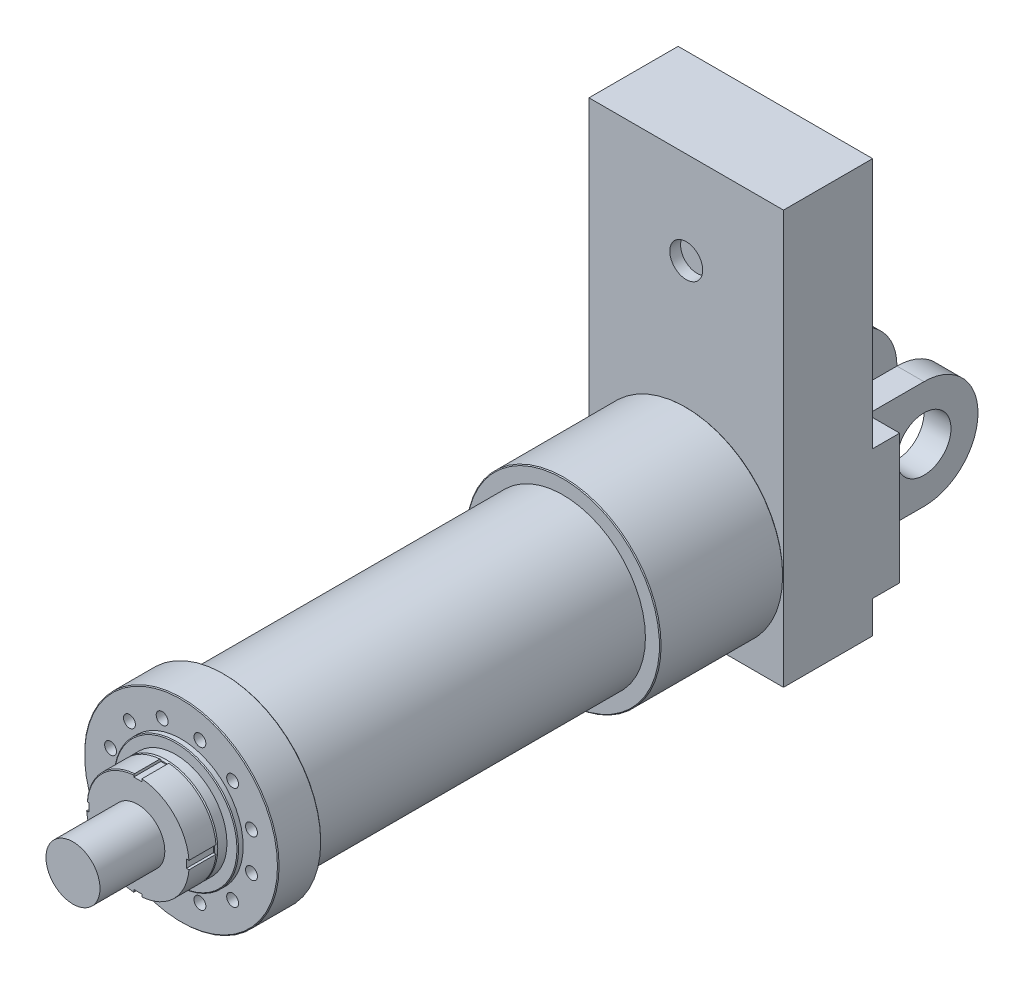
ISO-10303-21;
HEADER;
FILE_DESCRIPTION(('STEP AP214'),'2;1');
FILE_NAME('part.step','',(''),(''),'','','');
FILE_SCHEMA(('AUTOMOTIVE_DESIGN { 1 0 10303 214 1 1 1 1 }'));
ENDSEC;
DATA;
#1=APPLICATION_CONTEXT('core data for automotive mechanical design processes');
#2=APPLICATION_PROTOCOL_DEFINITION('international standard','automotive_design',2000,#1);
#3=PRODUCT_CONTEXT('',#1,'mechanical');
#4=PRODUCT('Part','Part','',(#3));
#5=PRODUCT_RELATED_PRODUCT_CATEGORY('part','',(#4));
#6=PRODUCT_DEFINITION_FORMATION('','',#4);
#7=PRODUCT_DEFINITION_CONTEXT('part definition',#1,'design');
#8=PRODUCT_DEFINITION('design','',#6,#7);
#9=PRODUCT_DEFINITION_SHAPE('','',#8);
#10=(LENGTH_UNIT() NAMED_UNIT(*) SI_UNIT(.MILLI.,.METRE.));
#11=(NAMED_UNIT(*) PLANE_ANGLE_UNIT() SI_UNIT($,.RADIAN.));
#12=(NAMED_UNIT(*) SI_UNIT($,.STERADIAN.) SOLID_ANGLE_UNIT());
#13=UNCERTAINTY_MEASURE_WITH_UNIT(LENGTH_MEASURE(1.E-05),#10,'distance_accuracy_value','');
#14=(GEOMETRIC_REPRESENTATION_CONTEXT(3) GLOBAL_UNCERTAINTY_ASSIGNED_CONTEXT((#13)) GLOBAL_UNIT_ASSIGNED_CONTEXT((#10,
#11,#12)) REPRESENTATION_CONTEXT('',''));
#15=CARTESIAN_POINT('',(0.,0.,0.));
#16=DIRECTION('',(0.,0.,1.));
#17=DIRECTION('',(1.,0.,0.));
#18=AXIS2_PLACEMENT_3D('',#15,#16,#17);
#19=CARTESIAN_POINT('',(0.,0.,-443.));
#20=DIRECTION('',(0.,0.,-1.));
#21=DIRECTION('',(-1.,0.,0.));
#22=AXIS2_PLACEMENT_3D('',#19,#20,#21);
#23=PLANE('',#22);
#24=DIRECTION('',(0.,1.,0.));
#25=VECTOR('',#24,1.);
#26=CARTESIAN_POINT('',(115.,0.,-443.));
#27=LINE('',#26,#25);
#28=CARTESIAN_POINT('',(115.,-115.,-443.));
#29=VERTEX_POINT('',#28);
#30=CARTESIAN_POINT('',(115.,115.,-443.));
#31=VERTEX_POINT('',#30);
#32=EDGE_CURVE('E313',#29,#31,#27,.T.);
#33=ORIENTED_EDGE('',*,*,#32,.T.);
#34=DIRECTION('',(-1.,0.,0.));
#35=VECTOR('',#34,1.);
#36=CARTESIAN_POINT('',(0.,115.,-443.));
#37=LINE('',#36,#35);
#38=CARTESIAN_POINT('',(35.0000000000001,115.,-443.));
#39=VERTEX_POINT('',#38);
#40=EDGE_CURVE('E315',#31,#39,#37,.T.);
#41=ORIENTED_EDGE('',*,*,#40,.T.);
#42=DIRECTION('',(0.,-1.,0.));
#43=VECTOR('',#42,1.);
#44=CARTESIAN_POINT('',(35.0000000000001,0.,-443.));
#45=LINE('',#44,#43);
#46=CARTESIAN_POINT('',(35.0000000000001,-115.,-443.));
#47=VERTEX_POINT('',#46);
#48=EDGE_CURVE('E311',#39,#47,#45,.T.);
#49=ORIENTED_EDGE('',*,*,#48,.T.);
#50=DIRECTION('',(1.,0.,0.));
#51=VECTOR('',#50,1.);
#52=CARTESIAN_POINT('',(0.,-115.,-443.));
#53=LINE('',#52,#51);
#54=EDGE_CURVE('E309',#47,#29,#53,.T.);
#55=ORIENTED_EDGE('',*,*,#54,.T.);
#56=EDGE_LOOP('',(#33,#41,#49,#55));
#57=FACE_BOUND('',#56,.T.);
#58=DIRECTION('',(1.,0.,0.));
#59=VECTOR('',#58,1.);
#60=CARTESIAN_POINT('',(0.,-115.,-443.));
#61=LINE('',#60,#59);
#62=CARTESIAN_POINT('',(-115.,-115.,-443.));
#63=VERTEX_POINT('',#62);
#64=CARTESIAN_POINT('',(-35.0000000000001,-115.,-443.));
#65=VERTEX_POINT('',#64);
#66=EDGE_CURVE('E304',#63,#65,#61,.T.);
#67=ORIENTED_EDGE('',*,*,#66,.T.);
#68=DIRECTION('',(0.,1.,0.));
#69=VECTOR('',#68,1.);
#70=CARTESIAN_POINT('',(-35.0000000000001,0.,-443.));
#71=LINE('',#70,#69);
#72=CARTESIAN_POINT('',(-35.,115.,-443.));
#73=VERTEX_POINT('',#72);
#74=EDGE_CURVE('E306',#65,#73,#71,.T.);
#75=ORIENTED_EDGE('',*,*,#74,.T.);
#76=DIRECTION('',(-1.,0.,0.));
#77=VECTOR('',#76,1.);
#78=CARTESIAN_POINT('',(0.,115.,-443.));
#79=LINE('',#78,#77);
#80=CARTESIAN_POINT('',(-115.,115.,-443.));
#81=VERTEX_POINT('',#80);
#82=EDGE_CURVE('E300',#73,#81,#79,.T.);
#83=ORIENTED_EDGE('',*,*,#82,.T.);
#84=DIRECTION('',(0.,-1.,0.));
#85=VECTOR('',#84,1.);
#86=CARTESIAN_POINT('',(-115.,0.,-443.));
#87=LINE('',#86,#85);
#88=EDGE_CURVE('E302',#81,#63,#87,.T.);
#89=ORIENTED_EDGE('',*,*,#88,.T.);
#90=EDGE_LOOP('',(#67,#75,#83,#89));
#91=FACE_BOUND('',#90,.T.);
#92=DIRECTION('',(0.,1.,0.));
#93=VECTOR('',#92,1.);
#94=CARTESIAN_POINT('',(-180.,120.,-443.));
#95=LINE('',#94,#93);
#96=CARTESIAN_POINT('',(-180.,-120.,-443.));
#97=VERTEX_POINT('',#96);
#98=CARTESIAN_POINT('',(-180.,120.,-443.));
#99=VERTEX_POINT('',#98);
#100=EDGE_CURVE('E227',#97,#99,#95,.T.);
#101=ORIENTED_EDGE('',*,*,#100,.T.);
#102=DIRECTION('',(1.,0.,0.));
#103=VECTOR('',#102,1.);
#104=CARTESIAN_POINT('',(180.,120.,-443.));
#105=LINE('',#104,#103);
#106=CARTESIAN_POINT('',(180.,120.,-443.));
#107=VERTEX_POINT('',#106);
#108=EDGE_CURVE('E230',#99,#107,#105,.T.);
#109=ORIENTED_EDGE('',*,*,#108,.T.);
#110=DIRECTION('',(0.,-1.,0.));
#111=VECTOR('',#110,1.);
#112=CARTESIAN_POINT('',(180.,120.,-443.));
#113=LINE('',#112,#111);
#114=CARTESIAN_POINT('',(180.,-120.,-443.));
#115=VERTEX_POINT('',#114);
#116=EDGE_CURVE('E233',#107,#115,#113,.T.);
#117=ORIENTED_EDGE('',*,*,#116,.T.);
#118=DIRECTION('',(-1.,0.,0.));
#119=VECTOR('',#118,1.);
#120=CARTESIAN_POINT('',(180.,-120.,-443.));
#121=LINE('',#120,#119);
#122=EDGE_CURVE('E235',#115,#97,#121,.T.);
#123=ORIENTED_EDGE('',*,*,#122,.T.);
#124=EDGE_LOOP('',(#101,#109,#117,#123));
#125=FACE_BOUND('',#124,.T.);
#126=ADVANCED_FACE('F51',(#57,#91,#125),#23,.T.);
#127=CARTESIAN_POINT('',(0.,0.,-393.));
#128=DIRECTION('',(0.,0.,-1.));
#129=DIRECTION('',(-1.,0.,0.));
#130=AXIS2_PLACEMENT_3D('',#127,#128,#129);
#131=PLANE('',#130);
#132=DIRECTION('',(-1.,0.,0.));
#133=VECTOR('',#132,1.);
#134=CARTESIAN_POINT('',(180.,-120.,-393.));
#135=LINE('',#134,#133);
#136=CARTESIAN_POINT('',(180.,-120.,-393.));
#137=VERTEX_POINT('',#136);
#138=CARTESIAN_POINT('',(-180.,-120.,-393.));
#139=VERTEX_POINT('',#138);
#140=EDGE_CURVE('E231',#137,#139,#135,.T.);
#141=ORIENTED_EDGE('',*,*,#140,.F.);
#142=DIRECTION('',(0.,-1.,0.));
#143=VECTOR('',#142,1.);
#144=CARTESIAN_POINT('',(180.,0.,-393.));
#145=LINE('',#144,#143);
#146=CARTESIAN_POINT('',(180.,-180.,-393.));
#147=VERTEX_POINT('',#146);
#148=EDGE_CURVE('E270',#137,#147,#145,.T.);
#149=ORIENTED_EDGE('',*,*,#148,.T.);
#150=DIRECTION('',(-1.,0.,0.));
#151=VECTOR('',#150,1.);
#152=CARTESIAN_POINT('',(0.,-180.,-393.));
#153=LINE('',#152,#151);
#154=CARTESIAN_POINT('',(-180.,-180.,-393.));
#155=VERTEX_POINT('',#154);
#156=EDGE_CURVE('E260',#147,#155,#153,.T.);
#157=ORIENTED_EDGE('',*,*,#156,.T.);
#158=DIRECTION('',(0.,1.,0.));
#159=VECTOR('',#158,1.);
#160=CARTESIAN_POINT('',(-180.,0.,-393.));
#161=LINE('',#160,#159);
#162=EDGE_CURVE('E265',#155,#139,#161,.T.);
#163=ORIENTED_EDGE('',*,*,#162,.T.);
#164=EDGE_LOOP('',(#141,#149,#157,#163));
#165=FACE_BOUND('',#164,.T.);
#166=ADVANCED_FACE('F423',(#165),#131,.T.);
#167=CARTESIAN_POINT('',(0.,-180.,-393.));
#168=DIRECTION('',(0.,1.,0.));
#169=DIRECTION('',(0.,0.,1.));
#170=AXIS2_PLACEMENT_3D('',#167,#168,#169);
#171=PLANE('',#170);
#172=DIRECTION('',(-1.,0.,0.));
#173=VECTOR('',#172,1.);
#174=CARTESIAN_POINT('',(0.,-180.,-228.));
#175=LINE('',#174,#173);
#176=CARTESIAN_POINT('',(180.,-180.,-228.));
#177=VERTEX_POINT('',#176);
#178=CARTESIAN_POINT('',(-180.,-180.,-228.));
#179=VERTEX_POINT('',#178);
#180=EDGE_CURVE('E257',#177,#179,#175,.T.);
#181=ORIENTED_EDGE('',*,*,#180,.T.);
#182=DIRECTION('',(0.,0.,1.));
#183=VECTOR('',#182,1.);
#184=CARTESIAN_POINT('',(-180.,-180.,-393.));
#185=LINE('',#184,#183);
#186=EDGE_CURVE('E289',#155,#179,#185,.T.);
#187=ORIENTED_EDGE('',*,*,#186,.F.);
#188=ORIENTED_EDGE('',*,*,#156,.F.);
#189=DIRECTION('',(0.,0.,1.));
#190=VECTOR('',#189,1.);
#191=CARTESIAN_POINT('',(180.,-180.,-393.));
#192=LINE('',#191,#190);
#193=EDGE_CURVE('E273',#147,#177,#192,.T.);
#194=ORIENTED_EDGE('',*,*,#193,.T.);
#195=EDGE_LOOP('',(#181,#187,#188,#194));
#196=FACE_BOUND('',#195,.T.);
#197=ADVANCED_FACE('F428',(#196),#171,.F.);
#198=CARTESIAN_POINT('',(-180.,0.,-393.));
#199=DIRECTION('',(1.,0.,0.));
#200=DIRECTION('',(0.,0.,-1.));
#201=AXIS2_PLACEMENT_3D('',#198,#199,#200);
#202=PLANE('',#201);
#203=DIRECTION('',(0.,1.,0.));
#204=VECTOR('',#203,1.);
#205=CARTESIAN_POINT('',(-180.,0.,-228.));
#206=LINE('',#205,#204);
#207=CARTESIAN_POINT('',(-180.,585.,-228.));
#208=VERTEX_POINT('',#207);
#209=EDGE_CURVE('E276',#179,#208,#206,.T.);
#210=ORIENTED_EDGE('',*,*,#209,.T.);
#211=DIRECTION('',(0.,0.,1.));
#212=VECTOR('',#211,1.);
#213=CARTESIAN_POINT('',(-180.,585.,-393.));
#214=LINE('',#213,#212);
#215=CARTESIAN_POINT('',(-180.,585.,-393.));
#216=VERTEX_POINT('',#215);
#217=EDGE_CURVE('E287',#216,#208,#214,.T.);
#218=ORIENTED_EDGE('',*,*,#217,.F.);
#219=CARTESIAN_POINT('',(-180.,120.,-393.));
#220=VERTEX_POINT('',#219);
#221=EDGE_CURVE('E263',#220,#216,#161,.T.);
#222=ORIENTED_EDGE('',*,*,#221,.F.);
#223=DIRECTION('',(0.,0.,1.));
#224=VECTOR('',#223,1.);
#225=CARTESIAN_POINT('',(-180.,120.,-443.));
#226=LINE('',#225,#224);
#227=EDGE_CURVE('E250',#99,#220,#226,.T.);
#228=ORIENTED_EDGE('',*,*,#227,.F.);
#229=ORIENTED_EDGE('',*,*,#100,.F.);
#230=DIRECTION('',(0.,0.,1.));
#231=VECTOR('',#230,1.);
#232=CARTESIAN_POINT('',(-180.,-120.,-443.));
#233=LINE('',#232,#231);
#234=EDGE_CURVE('E237',#97,#139,#233,.T.);
#235=ORIENTED_EDGE('',*,*,#234,.T.);
#236=ORIENTED_EDGE('',*,*,#162,.F.);
#237=ORIENTED_EDGE('',*,*,#186,.T.);
#238=EDGE_LOOP('',(#210,#218,#222,#228,#229,#235,#236,#237));
#239=FACE_BOUND('',#238,.T.);
#240=ADVANCED_FACE('F464',(#239),#202,.F.);
#241=CARTESIAN_POINT('',(0.,585.,-393.));
#242=DIRECTION('',(0.,1.,0.));
#243=DIRECTION('',(0.,0.,1.));
#244=AXIS2_PLACEMENT_3D('',#241,#242,#243);
#245=PLANE('',#244);
#246=DIRECTION('',(-1.,0.,0.));
#247=VECTOR('',#246,1.);
#248=CARTESIAN_POINT('',(0.,585.,-228.));
#249=LINE('',#248,#247);
#250=CARTESIAN_POINT('',(180.,585.,-228.));
#251=VERTEX_POINT('',#250);
#252=EDGE_CURVE('E279',#251,#208,#249,.T.);
#253=ORIENTED_EDGE('',*,*,#252,.F.);
#254=DIRECTION('',(0.,0.,1.));
#255=VECTOR('',#254,1.);
#256=CARTESIAN_POINT('',(180.,585.,-393.));
#257=LINE('',#256,#255);
#258=CARTESIAN_POINT('',(180.,585.,-393.));
#259=VERTEX_POINT('',#258);
#260=EDGE_CURVE('E285',#259,#251,#257,.T.);
#261=ORIENTED_EDGE('',*,*,#260,.F.);
#262=DIRECTION('',(-1.,0.,0.));
#263=VECTOR('',#262,1.);
#264=CARTESIAN_POINT('',(0.,585.,-393.));
#265=LINE('',#264,#263);
#266=EDGE_CURVE('E267',#259,#216,#265,.T.);
#267=ORIENTED_EDGE('',*,*,#266,.T.);
#268=ORIENTED_EDGE('',*,*,#217,.T.);
#269=EDGE_LOOP('',(#253,#261,#267,#268));
#270=FACE_BOUND('',#269,.T.);
#271=ADVANCED_FACE('F460',(#270),#245,.T.);
#272=CARTESIAN_POINT('',(180.,0.,-393.));
#273=DIRECTION('',(-1.,0.,0.));
#274=DIRECTION('',(0.,0.,1.));
#275=AXIS2_PLACEMENT_3D('',#272,#273,#274);
#276=PLANE('',#275);
#277=DIRECTION('',(0.,-1.,0.));
#278=VECTOR('',#277,1.);
#279=CARTESIAN_POINT('',(180.,0.,-228.));
#280=LINE('',#279,#278);
#281=EDGE_CURVE('E264',#251,#177,#280,.T.);
#282=ORIENTED_EDGE('',*,*,#281,.T.);
#283=ORIENTED_EDGE('',*,*,#193,.F.);
#284=ORIENTED_EDGE('',*,*,#148,.F.);
#285=DIRECTION('',(0.,0.,1.));
#286=VECTOR('',#285,1.);
#287=CARTESIAN_POINT('',(180.,-120.,-443.));
#288=LINE('',#287,#286);
#289=EDGE_CURVE('E244',#115,#137,#288,.T.);
#290=ORIENTED_EDGE('',*,*,#289,.F.);
#291=ORIENTED_EDGE('',*,*,#116,.F.);
#292=DIRECTION('',(0.,0.,1.));
#293=VECTOR('',#292,1.);
#294=CARTESIAN_POINT('',(180.,120.,-443.));
#295=LINE('',#294,#293);
#296=CARTESIAN_POINT('',(180.,120.,-393.));
#297=VERTEX_POINT('',#296);
#298=EDGE_CURVE('E247',#107,#297,#295,.T.);
#299=ORIENTED_EDGE('',*,*,#298,.T.);
#300=EDGE_CURVE('E271',#259,#297,#145,.T.);
#301=ORIENTED_EDGE('',*,*,#300,.F.);
#302=ORIENTED_EDGE('',*,*,#260,.T.);
#303=EDGE_LOOP('',(#282,#283,#284,#290,#291,#299,#301,#302));
#304=FACE_BOUND('',#303,.T.);
#305=ADVANCED_FACE('F453',(#304),#276,.F.);
#306=DIRECTION('',(1.,0.,0.));
#307=VECTOR('',#306,1.);
#308=CARTESIAN_POINT('',(180.,120.,-393.));
#309=LINE('',#308,#307);
#310=EDGE_CURVE('E226',#220,#297,#309,.T.);
#311=ORIENTED_EDGE('',*,*,#310,.F.);
#312=ORIENTED_EDGE('',*,*,#221,.T.);
#313=ORIENTED_EDGE('',*,*,#266,.F.);
#314=ORIENTED_EDGE('',*,*,#300,.T.);
#315=EDGE_LOOP('',(#311,#312,#313,#314));
#316=FACE_BOUND('',#315,.T.);
#317=ADVANCED_FACE('F431',(#316),#131,.T.);
#318=CARTESIAN_POINT('',(0.,0.,-228.));
#319=DIRECTION('',(0.,0.,-1.));
#320=DIRECTION('',(-1.,0.,0.));
#321=AXIS2_PLACEMENT_3D('',#318,#319,#320);
#322=PLANE('',#321);
#323=CARTESIAN_POINT('',(0.,414.,-228.));
#324=DIRECTION('',(0.,0.,1.));
#325=DIRECTION('',(1.,0.,0.));
#326=AXIS2_PLACEMENT_3D('',#323,#324,#325);
#327=CIRCLE('',#326,30.4407465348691);
#328=CARTESIAN_POINT('',(30.4407465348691,414.,-228.));
#329=VERTEX_POINT('',#328);
#330=EDGE_CURVE('E253',#329,#329,#327,.T.);
#331=ORIENTED_EDGE('',*,*,#330,.F.);
#332=EDGE_LOOP('',(#331));
#333=FACE_BOUND('',#332,.T.);
#334=ORIENTED_EDGE('',*,*,#180,.F.);
#335=ORIENTED_EDGE('',*,*,#281,.F.);
#336=ORIENTED_EDGE('',*,*,#252,.T.);
#337=ORIENTED_EDGE('',*,*,#209,.F.);
#338=EDGE_LOOP('',(#334,#335,#336,#337));
#339=FACE_BOUND('',#338,.T.);
#340=ADVANCED_FACE('F449',(#333,#339),#322,.F.);
#341=CARTESIAN_POINT('',(0.,414.,-248.));
#342=DIRECTION('',(0.,0.,1.));
#343=DIRECTION('',(1.,0.,0.));
#344=AXIS2_PLACEMENT_3D('',#341,#342,#343);
#345=CYLINDRICAL_SURFACE('',#344,30.4407465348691);
#346=CARTESIAN_POINT('',(0.,414.,-248.));
#347=DIRECTION('',(0.,0.,1.));
#348=DIRECTION('',(1.,0.,0.));
#349=AXIS2_PLACEMENT_3D('',#346,#347,#348);
#350=CIRCLE('',#349,30.4407465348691);
#351=CARTESIAN_POINT('',(30.4407465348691,414.,-248.));
#352=VERTEX_POINT('',#351);
#353=EDGE_CURVE('E254',#352,#352,#350,.T.);
#354=ORIENTED_EDGE('',*,*,#353,.F.);
#355=EDGE_LOOP('',(#354));
#356=FACE_BOUND('',#355,.T.);
#357=ORIENTED_EDGE('',*,*,#330,.T.);
#358=EDGE_LOOP('',(#357));
#359=FACE_BOUND('',#358,.T.);
#360=ADVANCED_FACE('F446',(#356,#359),#345,.F.);
#361=CARTESIAN_POINT('',(0.,414.,-248.));
#362=DIRECTION('',(0.,0.,1.));
#363=DIRECTION('',(1.,0.,0.));
#364=AXIS2_PLACEMENT_3D('',#361,#362,#363);
#365=PLANE('',#364);
#366=ORIENTED_EDGE('',*,*,#353,.T.);
#367=EDGE_LOOP('',(#366));
#368=FACE_BOUND('',#367,.T.);
#369=ADVANCED_FACE('F442',(#368),#365,.T.);
#370=CARTESIAN_POINT('',(180.,120.,-443.));
#371=DIRECTION('',(0.,-1.,0.));
#372=DIRECTION('',(0.,0.,-1.));
#373=AXIS2_PLACEMENT_3D('',#370,#371,#372);
#374=PLANE('',#373);
#375=ORIENTED_EDGE('',*,*,#310,.T.);
#376=ORIENTED_EDGE('',*,*,#298,.F.);
#377=ORIENTED_EDGE('',*,*,#108,.F.);
#378=ORIENTED_EDGE('',*,*,#227,.T.);
#379=EDGE_LOOP('',(#375,#376,#377,#378));
#380=FACE_BOUND('',#379,.T.);
#381=ADVANCED_FACE('F438',(#380),#374,.F.);
#382=CARTESIAN_POINT('',(180.,-120.,-443.));
#383=DIRECTION('',(0.,1.,0.));
#384=DIRECTION('',(0.,0.,1.));
#385=AXIS2_PLACEMENT_3D('',#382,#383,#384);
#386=PLANE('',#385);
#387=ORIENTED_EDGE('',*,*,#140,.T.);
#388=ORIENTED_EDGE('',*,*,#234,.F.);
#389=ORIENTED_EDGE('',*,*,#122,.F.);
#390=ORIENTED_EDGE('',*,*,#289,.T.);
#391=EDGE_LOOP('',(#387,#388,#389,#390));
#392=FACE_BOUND('',#391,.T.);
#393=ADVANCED_FACE('F435',(#392),#386,.F.);
#394=CARTESIAN_POINT('',(50.,100.,-668.));
#395=DIRECTION('',(1.,0.,0.));
#396=DIRECTION('',(0.,1.,0.));
#397=AXIS2_PLACEMENT_3D('',#394,#395,#396);
#398=PLANE('',#397);
#399=CARTESIAN_POINT('',(50.,0.,-568.));
#400=DIRECTION('',(1.,0.,0.));
#401=DIRECTION('',(0.,1.,0.));
#402=AXIS2_PLACEMENT_3D('',#399,#400,#401);
#403=CIRCLE('',#402,50.);
#404=CARTESIAN_POINT('',(50.,50.,-568.));
#405=VERTEX_POINT('',#404);
#406=EDGE_CURVE('E367',#405,#405,#403,.T.);
#407=ORIENTED_EDGE('',*,*,#406,.T.);
#408=EDGE_LOOP('',(#407));
#409=FACE_BOUND('',#408,.T.);
#410=DIRECTION('',(0.,0.,1.));
#411=VECTOR('',#410,1.);
#412=CARTESIAN_POINT('',(50.,-100.,-668.));
#413=LINE('',#412,#411);
#414=CARTESIAN_POINT('',(50.,-100.,-568.));
#415=VERTEX_POINT('',#414);
#416=CARTESIAN_POINT('',(50.,-100.,-458.));
#417=VERTEX_POINT('',#416);
#418=EDGE_CURVE('E209',#415,#417,#413,.T.);
#419=ORIENTED_EDGE('',*,*,#418,.T.);
#420=DIRECTION('',(0.,1.,0.));
#421=VECTOR('',#420,1.);
#422=CARTESIAN_POINT('',(50.,100.,-458.));
#423=LINE('',#422,#421);
#424=CARTESIAN_POINT('',(50.,100.,-458.));
#425=VERTEX_POINT('',#424);
#426=EDGE_CURVE('E320',#417,#425,#423,.T.);
#427=ORIENTED_EDGE('',*,*,#426,.T.);
#428=DIRECTION('',(0.,0.,1.));
#429=VECTOR('',#428,1.);
#430=CARTESIAN_POINT('',(50.,100.,-668.));
#431=LINE('',#430,#429);
#432=CARTESIAN_POINT('',(50.,99.9999999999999,-568.));
#433=VERTEX_POINT('',#432);
#434=EDGE_CURVE('E223',#433,#425,#431,.T.);
#435=ORIENTED_EDGE('',*,*,#434,.F.);
#436=CARTESIAN_POINT('',(50.,0.,-568.));
#437=DIRECTION('',(1.,0.,0.));
#438=DIRECTION('',(0.,1.,0.));
#439=AXIS2_PLACEMENT_3D('',#436,#437,#438);
#440=CIRCLE('',#439,100.);
#441=EDGE_CURVE('E297',#433,#415,#440,.F.);
#442=ORIENTED_EDGE('',*,*,#441,.T.);
#443=EDGE_LOOP('',(#419,#427,#435,#442));
#444=FACE_BOUND('',#443,.T.);
#445=ADVANCED_FACE('F393',(#409,#444),#398,.F.);
#446=CARTESIAN_POINT('',(100.,100.,-668.));
#447=DIRECTION('',(0.,-1.,0.));
#448=DIRECTION('',(1.,0.,0.));
#449=AXIS2_PLACEMENT_3D('',#446,#447,#448);
#450=PLANE('',#449);
#451=ORIENTED_EDGE('',*,*,#434,.T.);
#452=DIRECTION('',(1.,0.,0.));
#453=VECTOR('',#452,1.);
#454=CARTESIAN_POINT('',(100.,100.,-458.));
#455=LINE('',#454,#453);
#456=CARTESIAN_POINT('',(100.,100.,-458.));
#457=VERTEX_POINT('',#456);
#458=EDGE_CURVE('E292',#425,#457,#455,.T.);
#459=ORIENTED_EDGE('',*,*,#458,.T.);
#460=DIRECTION('',(0.,0.,1.));
#461=VECTOR('',#460,1.);
#462=CARTESIAN_POINT('',(100.,100.,-668.));
#463=LINE('',#462,#461);
#464=CARTESIAN_POINT('',(100.,99.9999999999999,-568.));
#465=VERTEX_POINT('',#464);
#466=EDGE_CURVE('E220',#465,#457,#463,.T.);
#467=ORIENTED_EDGE('',*,*,#466,.F.);
#468=DIRECTION('',(-1.,0.,0.));
#469=VECTOR('',#468,1.);
#470=CARTESIAN_POINT('',(125.,99.9999999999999,-568.));
#471=LINE('',#470,#469);
#472=EDGE_CURVE('E206',#465,#433,#471,.T.);
#473=ORIENTED_EDGE('',*,*,#472,.T.);
#474=EDGE_LOOP('',(#451,#459,#467,#473));
#475=FACE_BOUND('',#474,.T.);
#476=ADVANCED_FACE('F389',(#475),#450,.F.);
#477=CARTESIAN_POINT('',(100.,100.,-668.));
#478=DIRECTION('',(-1.,0.,0.));
#479=DIRECTION('',(0.,-1.,0.));
#480=AXIS2_PLACEMENT_3D('',#477,#478,#479);
#481=PLANE('',#480);
#482=CARTESIAN_POINT('',(100.,0.,-568.));
#483=DIRECTION('',(-1.,0.,0.));
#484=DIRECTION('',(0.,-1.,0.));
#485=AXIS2_PLACEMENT_3D('',#482,#483,#484);
#486=CIRCLE('',#485,50.);
#487=CARTESIAN_POINT('',(100.,-50.,-568.));
#488=VERTEX_POINT('',#487);
#489=EDGE_CURVE('E296',#488,#488,#486,.T.);
#490=ORIENTED_EDGE('',*,*,#489,.T.);
#491=EDGE_LOOP('',(#490));
#492=FACE_BOUND('',#491,.T.);
#493=ORIENTED_EDGE('',*,*,#466,.T.);
#494=DIRECTION('',(0.,-1.,0.));
#495=VECTOR('',#494,1.);
#496=CARTESIAN_POINT('',(100.,100.,-458.));
#497=LINE('',#496,#495);
#498=CARTESIAN_POINT('',(100.,-100.,-458.));
#499=VERTEX_POINT('',#498);
#500=EDGE_CURVE('E318',#457,#499,#497,.T.);
#501=ORIENTED_EDGE('',*,*,#500,.T.);
#502=DIRECTION('',(0.,0.,1.));
#503=VECTOR('',#502,1.);
#504=CARTESIAN_POINT('',(100.,-100.,-668.));
#505=LINE('',#504,#503);
#506=CARTESIAN_POINT('',(100.,-100.,-568.));
#507=VERTEX_POINT('',#506);
#508=EDGE_CURVE('E212',#507,#499,#505,.T.);
#509=ORIENTED_EDGE('',*,*,#508,.F.);
#510=CARTESIAN_POINT('',(100.,0.,-568.));
#511=DIRECTION('',(-1.,0.,0.));
#512=DIRECTION('',(0.,-1.,0.));
#513=AXIS2_PLACEMENT_3D('',#510,#511,#512);
#514=CIRCLE('',#513,100.);
#515=EDGE_CURVE('E375',#507,#465,#514,.F.);
#516=ORIENTED_EDGE('',*,*,#515,.T.);
#517=EDGE_LOOP('',(#493,#501,#509,#516));
#518=FACE_BOUND('',#517,.T.);
#519=ADVANCED_FACE('F407',(#492,#518),#481,.F.);
#520=CARTESIAN_POINT('',(100.,-100.,-668.));
#521=DIRECTION('',(0.,1.,0.));
#522=DIRECTION('',(-1.,0.,0.));
#523=AXIS2_PLACEMENT_3D('',#520,#521,#522);
#524=PLANE('',#523);
#525=ORIENTED_EDGE('',*,*,#508,.T.);
#526=DIRECTION('',(-1.,0.,0.));
#527=VECTOR('',#526,1.);
#528=CARTESIAN_POINT('',(100.,-100.,-458.));
#529=LINE('',#528,#527);
#530=EDGE_CURVE('E322',#499,#417,#529,.T.);
#531=ORIENTED_EDGE('',*,*,#530,.T.);
#532=ORIENTED_EDGE('',*,*,#418,.F.);
#533=DIRECTION('',(-1.,0.,0.));
#534=VECTOR('',#533,1.);
#535=CARTESIAN_POINT('',(125.,-100.,-568.));
#536=LINE('',#535,#534);
#537=EDGE_CURVE('E382',#507,#415,#536,.T.);
#538=ORIENTED_EDGE('',*,*,#537,.F.);
#539=EDGE_LOOP('',(#525,#531,#532,#538));
#540=FACE_BOUND('',#539,.T.);
#541=ADVANCED_FACE('F412',(#540),#524,.F.);
#542=CARTESIAN_POINT('',(-99.9999999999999,100.,-668.));
#543=DIRECTION('',(1.,0.,0.));
#544=DIRECTION('',(0.,1.,0.));
#545=AXIS2_PLACEMENT_3D('',#542,#543,#544);
#546=PLANE('',#545);
#547=CARTESIAN_POINT('',(-100.,0.,-568.));
#548=DIRECTION('',(-1.,0.,0.));
#549=DIRECTION('',(0.,-1.,0.));
#550=AXIS2_PLACEMENT_3D('',#547,#548,#549);
#551=CIRCLE('',#550,50.);
#552=CARTESIAN_POINT('',(-100.,-50.,-568.));
#553=VERTEX_POINT('',#552);
#554=EDGE_CURVE('E380',#553,#553,#551,.T.);
#555=ORIENTED_EDGE('',*,*,#554,.F.);
#556=EDGE_LOOP('',(#555));
#557=FACE_BOUND('',#556,.T.);
#558=DIRECTION('',(0.,0.,1.));
#559=VECTOR('',#558,1.);
#560=CARTESIAN_POINT('',(-100.,-100.,-668.));
#561=LINE('',#560,#559);
#562=CARTESIAN_POINT('',(-100.,-99.9999999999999,-568.));
#563=VERTEX_POINT('',#562);
#564=CARTESIAN_POINT('',(-100.,-100.,-458.));
#565=VERTEX_POINT('',#564);
#566=EDGE_CURVE('E366',#563,#565,#561,.T.);
#567=ORIENTED_EDGE('',*,*,#566,.T.);
#568=DIRECTION('',(0.,1.,0.));
#569=VECTOR('',#568,1.);
#570=CARTESIAN_POINT('',(-99.9999999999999,100.,-458.));
#571=LINE('',#570,#569);
#572=CARTESIAN_POINT('',(-99.9999999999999,100.,-458.));
#573=VERTEX_POINT('',#572);
#574=EDGE_CURVE('E60',#565,#573,#571,.T.);
#575=ORIENTED_EDGE('',*,*,#574,.T.);
#576=DIRECTION('',(0.,0.,1.));
#577=VECTOR('',#576,1.);
#578=CARTESIAN_POINT('',(-99.9999999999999,100.,-668.));
#579=LINE('',#578,#577);
#580=CARTESIAN_POINT('',(-99.9999999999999,100.,-568.));
#581=VERTEX_POINT('',#580);
#582=EDGE_CURVE('E202',#581,#573,#579,.T.);
#583=ORIENTED_EDGE('',*,*,#582,.F.);
#584=CARTESIAN_POINT('',(-100.,0.,-568.));
#585=DIRECTION('',(1.,0.,0.));
#586=DIRECTION('',(0.,-1.,0.));
#587=AXIS2_PLACEMENT_3D('',#584,#585,#586);
#588=CIRCLE('',#587,100.);
#589=EDGE_CURVE('E191',#563,#581,#588,.T.);
#590=ORIENTED_EDGE('',*,*,#589,.F.);
#591=EDGE_LOOP('',(#567,#575,#583,#590));
#592=FACE_BOUND('',#591,.T.);
#593=ADVANCED_FACE('F208',(#557,#592),#546,.F.);
#594=CARTESIAN_POINT('',(-50.,100.,-668.));
#595=DIRECTION('',(0.,-1.,0.));
#596=DIRECTION('',(0.,0.,-1.));
#597=AXIS2_PLACEMENT_3D('',#594,#595,#596);
#598=PLANE('',#597);
#599=ORIENTED_EDGE('',*,*,#582,.T.);
#600=DIRECTION('',(1.,0.,0.));
#601=VECTOR('',#600,1.);
#602=CARTESIAN_POINT('',(-50.,100.,-458.));
#603=LINE('',#602,#601);
#604=CARTESIAN_POINT('',(-50.,100.,-458.));
#605=VERTEX_POINT('',#604);
#606=EDGE_CURVE('E12',#573,#605,#603,.T.);
#607=ORIENTED_EDGE('',*,*,#606,.T.);
#608=DIRECTION('',(0.,0.,1.));
#609=VECTOR('',#608,1.);
#610=CARTESIAN_POINT('',(-50.,100.,-668.));
#611=LINE('',#610,#609);
#612=CARTESIAN_POINT('',(-50.,100.,-568.));
#613=VERTEX_POINT('',#612);
#614=EDGE_CURVE('E205',#613,#605,#611,.T.);
#615=ORIENTED_EDGE('',*,*,#614,.F.);
#616=EDGE_CURVE('E194',#613,#581,#471,.T.);
#617=ORIENTED_EDGE('',*,*,#616,.T.);
#618=EDGE_LOOP('',(#599,#607,#615,#617));
#619=FACE_BOUND('',#618,.T.);
#620=ADVANCED_FACE('F201',(#619),#598,.F.);
#621=CARTESIAN_POINT('',(-50.,100.,-668.));
#622=DIRECTION('',(-1.,0.,0.));
#623=DIRECTION('',(0.,-1.,0.));
#624=AXIS2_PLACEMENT_3D('',#621,#622,#623);
#625=PLANE('',#624);
#626=CARTESIAN_POINT('',(-50.,0.,-568.));
#627=DIRECTION('',(-1.,0.,0.));
#628=DIRECTION('',(0.,-1.,0.));
#629=AXIS2_PLACEMENT_3D('',#626,#627,#628);
#630=CIRCLE('',#629,50.);
#631=CARTESIAN_POINT('',(-50.,-50.,-568.));
#632=VERTEX_POINT('',#631);
#633=EDGE_CURVE('E293',#632,#632,#630,.T.);
#634=ORIENTED_EDGE('',*,*,#633,.T.);
#635=EDGE_LOOP('',(#634));
#636=FACE_BOUND('',#635,.T.);
#637=ORIENTED_EDGE('',*,*,#614,.T.);
#638=DIRECTION('',(0.,-1.,0.));
#639=VECTOR('',#638,1.);
#640=CARTESIAN_POINT('',(-50.,100.,-458.));
#641=LINE('',#640,#639);
#642=CARTESIAN_POINT('',(-50.,-100.,-458.));
#643=VERTEX_POINT('',#642);
#644=EDGE_CURVE('E324',#605,#643,#641,.T.);
#645=ORIENTED_EDGE('',*,*,#644,.T.);
#646=DIRECTION('',(0.,0.,1.));
#647=VECTOR('',#646,1.);
#648=CARTESIAN_POINT('',(-50.,-100.,-668.));
#649=LINE('',#648,#647);
#650=CARTESIAN_POINT('',(-50.,-100.,-568.));
#651=VERTEX_POINT('',#650);
#652=EDGE_CURVE('E214',#651,#643,#649,.T.);
#653=ORIENTED_EDGE('',*,*,#652,.F.);
#654=CARTESIAN_POINT('',(-50.,0.,-568.));
#655=DIRECTION('',(-1.,0.,0.));
#656=DIRECTION('',(0.,-1.,0.));
#657=AXIS2_PLACEMENT_3D('',#654,#655,#656);
#658=CIRCLE('',#657,100.);
#659=EDGE_CURVE('E378',#651,#613,#658,.F.);
#660=ORIENTED_EDGE('',*,*,#659,.T.);
#661=EDGE_LOOP('',(#637,#645,#653,#660));
#662=FACE_BOUND('',#661,.T.);
#663=ADVANCED_FACE('F364',(#636,#662),#625,.F.);
#664=CARTESIAN_POINT('',(-50.,-100.,-668.));
#665=DIRECTION('',(0.,1.,0.));
#666=DIRECTION('',(0.,0.,1.));
#667=AXIS2_PLACEMENT_3D('',#664,#665,#666);
#668=PLANE('',#667);
#669=ORIENTED_EDGE('',*,*,#652,.T.);
#670=DIRECTION('',(-1.,0.,0.));
#671=VECTOR('',#670,1.);
#672=CARTESIAN_POINT('',(-50.,-100.,-458.));
#673=LINE('',#672,#671);
#674=EDGE_CURVE('E75',#643,#565,#673,.T.);
#675=ORIENTED_EDGE('',*,*,#674,.T.);
#676=ORIENTED_EDGE('',*,*,#566,.F.);
#677=EDGE_CURVE('E197',#651,#563,#536,.T.);
#678=ORIENTED_EDGE('',*,*,#677,.F.);
#679=EDGE_LOOP('',(#669,#675,#676,#678));
#680=FACE_BOUND('',#679,.T.);
#681=ADVANCED_FACE('F365',(#680),#668,.F.);
#682=CARTESIAN_POINT('',(125.,0.,-568.));
#683=DIRECTION('',(-1.,0.,0.));
#684=DIRECTION('',(0.,-1.,0.));
#685=AXIS2_PLACEMENT_3D('',#682,#683,#684);
#686=CYLINDRICAL_SURFACE('',#685,100.);
#687=ORIENTED_EDGE('',*,*,#677,.T.);
#688=ORIENTED_EDGE('',*,*,#589,.T.);
#689=ORIENTED_EDGE('',*,*,#616,.F.);
#690=ORIENTED_EDGE('',*,*,#659,.F.);
#691=EDGE_LOOP('',(#687,#688,#689,#690));
#692=FACE_BOUND('',#691,.T.);
#693=ADVANCED_FACE('F193',(#692),#686,.T.);
#694=CARTESIAN_POINT('',(125.,0.,-568.));
#695=DIRECTION('',(-1.,0.,0.));
#696=DIRECTION('',(0.,-1.,0.));
#697=AXIS2_PLACEMENT_3D('',#694,#695,#696);
#698=CYLINDRICAL_SURFACE('',#697,50.);
#699=ORIENTED_EDGE('',*,*,#554,.T.);
#700=EDGE_LOOP('',(#699));
#701=FACE_BOUND('',#700,.T.);
#702=ORIENTED_EDGE('',*,*,#633,.F.);
#703=EDGE_LOOP('',(#702));
#704=FACE_BOUND('',#703,.T.);
#705=ADVANCED_FACE('F515',(#701,#704),#698,.F.);
#706=ORIENTED_EDGE('',*,*,#472,.F.);
#707=ORIENTED_EDGE('',*,*,#515,.F.);
#708=ORIENTED_EDGE('',*,*,#537,.T.);
#709=ORIENTED_EDGE('',*,*,#441,.F.);
#710=EDGE_LOOP('',(#706,#707,#708,#709));
#711=FACE_BOUND('',#710,.T.);
#712=ADVANCED_FACE('F410',(#711),#686,.T.);
#713=ORIENTED_EDGE('',*,*,#489,.F.);
#714=EDGE_LOOP('',(#713));
#715=FACE_BOUND('',#714,.T.);
#716=ORIENTED_EDGE('',*,*,#406,.F.);
#717=EDGE_LOOP('',(#716));
#718=FACE_BOUND('',#717,.T.);
#719=ADVANCED_FACE('F480',(#715,#718),#698,.F.);
#720=CARTESIAN_POINT('',(100.,-100.,-458.));
#721=DIRECTION('',(0.,0.70710678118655,0.707106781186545));
#722=DIRECTION('',(-1.,0.,0.));
#723=AXIS2_PLACEMENT_3D('',#720,#721,#722);
#724=PLANE('',#723);
#725=DIRECTION('',(0.577350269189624,-0.577350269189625,0.577350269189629));
#726=VECTOR('',#725,1.);
#727=CARTESIAN_POINT('',(100.,-100.,-458.));
#728=LINE('',#727,#726);
#729=EDGE_CURVE('E333',#29,#499,#728,.F.);
#730=ORIENTED_EDGE('',*,*,#729,.F.);
#731=ORIENTED_EDGE('',*,*,#54,.F.);
#732=DIRECTION('',(0.577350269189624,0.577350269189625,-0.577350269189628));
#733=VECTOR('',#732,1.);
#734=CARTESIAN_POINT('',(66.6666666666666,-83.3333333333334,-474.666666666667));
#735=LINE('',#734,#733);
#736=EDGE_CURVE('E198',#417,#47,#735,.F.);
#737=ORIENTED_EDGE('',*,*,#736,.F.);
#738=ORIENTED_EDGE('',*,*,#530,.F.);
#739=EDGE_LOOP('',(#730,#731,#737,#738));
#740=FACE_BOUND('',#739,.T.);
#741=ADVANCED_FACE('F416',(#740),#724,.F.);
#742=CARTESIAN_POINT('',(50.,100.,-458.));
#743=DIRECTION('',(0.70710678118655,0.,0.707106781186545));
#744=DIRECTION('',(0.,1.,0.));
#745=AXIS2_PLACEMENT_3D('',#742,#743,#744);
#746=PLANE('',#745);
#747=ORIENTED_EDGE('',*,*,#736,.T.);
#748=ORIENTED_EDGE('',*,*,#48,.F.);
#749=DIRECTION('',(0.577350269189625,-0.577350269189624,-0.577350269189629));
#750=VECTOR('',#749,1.);
#751=CARTESIAN_POINT('',(50.,100.,-458.));
#752=LINE('',#751,#750);
#753=EDGE_CURVE('E331',#425,#39,#752,.F.);
#754=ORIENTED_EDGE('',*,*,#753,.F.);
#755=ORIENTED_EDGE('',*,*,#426,.F.);
#756=EDGE_LOOP('',(#747,#748,#754,#755));
#757=FACE_BOUND('',#756,.T.);
#758=ADVANCED_FACE('F398',(#757),#746,.F.);
#759=CARTESIAN_POINT('',(100.,100.,-458.));
#760=DIRECTION('',(-0.70710678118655,0.,0.707106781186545));
#761=DIRECTION('',(0.,-1.,0.));
#762=AXIS2_PLACEMENT_3D('',#759,#760,#761);
#763=PLANE('',#762);
#764=ORIENTED_EDGE('',*,*,#729,.T.);
#765=ORIENTED_EDGE('',*,*,#500,.F.);
#766=DIRECTION('',(0.577350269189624,0.577350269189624,0.577350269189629));
#767=VECTOR('',#766,1.);
#768=CARTESIAN_POINT('',(100.,100.,-458.));
#769=LINE('',#768,#767);
#770=EDGE_CURVE('E329',#31,#457,#769,.F.);
#771=ORIENTED_EDGE('',*,*,#770,.F.);
#772=ORIENTED_EDGE('',*,*,#32,.F.);
#773=EDGE_LOOP('',(#764,#765,#771,#772));
#774=FACE_BOUND('',#773,.T.);
#775=ADVANCED_FACE('F420',(#774),#763,.F.);
#776=CARTESIAN_POINT('',(100.,100.,-458.));
#777=DIRECTION('',(0.,-0.70710678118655,0.707106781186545));
#778=DIRECTION('',(1.,0.,0.));
#779=AXIS2_PLACEMENT_3D('',#776,#777,#778);
#780=PLANE('',#779);
#781=ORIENTED_EDGE('',*,*,#753,.T.);
#782=ORIENTED_EDGE('',*,*,#40,.F.);
#783=ORIENTED_EDGE('',*,*,#770,.T.);
#784=ORIENTED_EDGE('',*,*,#458,.F.);
#785=EDGE_LOOP('',(#781,#782,#783,#784));
#786=FACE_BOUND('',#785,.T.);
#787=ADVANCED_FACE('F403',(#786),#780,.F.);
#788=CARTESIAN_POINT('',(-99.9999999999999,100.,-458.));
#789=DIRECTION('',(0.70710678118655,0.,0.707106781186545));
#790=DIRECTION('',(0.,1.,0.));
#791=AXIS2_PLACEMENT_3D('',#788,#789,#790);
#792=PLANE('',#791);
#793=DIRECTION('',(-0.577350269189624,-0.577350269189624,0.577350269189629));
#794=VECTOR('',#793,1.);
#795=CARTESIAN_POINT('',(-33.3333333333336,-33.3333333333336,-524.666666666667));
#796=LINE('',#795,#794);
#797=EDGE_CURVE('E341',#63,#565,#796,.F.);
#798=ORIENTED_EDGE('',*,*,#797,.F.);
#799=ORIENTED_EDGE('',*,*,#88,.F.);
#800=DIRECTION('',(-0.577350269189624,0.577350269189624,0.577350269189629));
#801=VECTOR('',#800,1.);
#802=CARTESIAN_POINT('',(-83.3333333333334,83.3333333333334,-474.666666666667));
#803=LINE('',#802,#801);
#804=EDGE_CURVE('E55',#573,#81,#803,.T.);
#805=ORIENTED_EDGE('',*,*,#804,.F.);
#806=ORIENTED_EDGE('',*,*,#574,.F.);
#807=EDGE_LOOP('',(#798,#799,#805,#806));
#808=FACE_BOUND('',#807,.T.);
#809=ADVANCED_FACE('F53',(#808),#792,.F.);
#810=CARTESIAN_POINT('',(-50.,100.,-458.));
#811=DIRECTION('',(0.,-0.70710678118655,0.707106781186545));
#812=DIRECTION('',(1.,0.,0.));
#813=AXIS2_PLACEMENT_3D('',#810,#811,#812);
#814=PLANE('',#813);
#815=ORIENTED_EDGE('',*,*,#804,.T.);
#816=ORIENTED_EDGE('',*,*,#82,.F.);
#817=DIRECTION('',(-0.577350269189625,-0.577350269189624,-0.577350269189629));
#818=VECTOR('',#817,1.);
#819=CARTESIAN_POINT('',(-50.,100.,-458.));
#820=LINE('',#819,#818);
#821=EDGE_CURVE('E340',#605,#73,#820,.F.);
#822=ORIENTED_EDGE('',*,*,#821,.F.);
#823=ORIENTED_EDGE('',*,*,#606,.F.);
#824=EDGE_LOOP('',(#815,#816,#822,#823));
#825=FACE_BOUND('',#824,.T.);
#826=ADVANCED_FACE('F350',(#825),#814,.F.);
#827=CARTESIAN_POINT('',(-50.,-100.,-458.));
#828=DIRECTION('',(0.,0.70710678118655,0.707106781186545));
#829=DIRECTION('',(-1.,0.,0.));
#830=AXIS2_PLACEMENT_3D('',#827,#828,#829);
#831=PLANE('',#830);
#832=ORIENTED_EDGE('',*,*,#797,.T.);
#833=ORIENTED_EDGE('',*,*,#674,.F.);
#834=DIRECTION('',(0.577350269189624,-0.577350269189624,0.577350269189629));
#835=VECTOR('',#834,1.);
#836=CARTESIAN_POINT('',(-50.,-100.,-458.));
#837=LINE('',#836,#835);
#838=EDGE_CURVE('E338',#65,#643,#837,.F.);
#839=ORIENTED_EDGE('',*,*,#838,.F.);
#840=ORIENTED_EDGE('',*,*,#66,.F.);
#841=EDGE_LOOP('',(#832,#833,#839,#840));
#842=FACE_BOUND('',#841,.T.);
#843=ADVANCED_FACE('F361',(#842),#831,.F.);
#844=CARTESIAN_POINT('',(-50.,100.,-458.));
#845=DIRECTION('',(-0.70710678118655,0.,0.707106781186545));
#846=DIRECTION('',(0.,-1.,0.));
#847=AXIS2_PLACEMENT_3D('',#844,#845,#846);
#848=PLANE('',#847);
#849=ORIENTED_EDGE('',*,*,#821,.T.);
#850=ORIENTED_EDGE('',*,*,#74,.F.);
#851=ORIENTED_EDGE('',*,*,#838,.T.);
#852=ORIENTED_EDGE('',*,*,#644,.F.);
#853=EDGE_LOOP('',(#849,#850,#851,#852));
#854=FACE_BOUND('',#853,.T.);
#855=ADVANCED_FACE('F359',(#854),#848,.F.);
#856=CLOSED_SHELL('',(#126,#166,#197,#240,#271,#305,#317,#340,#360,#369,#381,#393,#445,#476,
#519,#541,#593,#620,#663,#681,#693,#705,#712,#719,#741,#758,#775,#787,#809,#826,#843,#855));
#857=MANIFOLD_SOLID_BREP('B2',#856);
#858=CARTESIAN_POINT('',(0.,0.,627.));
#859=DIRECTION('',(0.,0.,-1.));
#860=DIRECTION('',(-1.,0.,0.));
#861=AXIS2_PLACEMENT_3D('',#858,#859,#860);
#862=CYLINDRICAL_SURFACE('',#861,152.5);
#863=CARTESIAN_POINT('',(0.,0.,627.));
#864=DIRECTION('',(0.,0.,1.));
#865=DIRECTION('',(1.,0.,0.));
#866=AXIS2_PLACEMENT_3D('',#863,#864,#865);
#867=CIRCLE('',#866,152.5);
#868=CARTESIAN_POINT('',(152.5,0.,627.));
#869=VERTEX_POINT('',#868);
#870=EDGE_CURVE('E969',#869,#869,#867,.T.);
#871=ORIENTED_EDGE('',*,*,#870,.F.);
#872=EDGE_LOOP('',(#871));
#873=FACE_BOUND('',#872,.T.);
#874=CARTESIAN_POINT('',(0.,0.,0.));
#875=DIRECTION('',(0.,0.,1.));
#876=DIRECTION('',(1.,0.,0.));
#877=AXIS2_PLACEMENT_3D('',#874,#875,#876);
#878=CIRCLE('',#877,152.5);
#879=CARTESIAN_POINT('',(152.5,0.,0.));
#880=VERTEX_POINT('',#879);
#881=EDGE_CURVE('E1064',#880,#880,#878,.T.);
#882=ORIENTED_EDGE('',*,*,#881,.T.);
#883=EDGE_LOOP('',(#882));
#884=FACE_BOUND('',#883,.T.);
#885=CARTESIAN_POINT('',(-152.5,0.,567.5));
#886=CARTESIAN_POINT('',(-152.500001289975,0.448200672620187,567.500004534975));
#887=CARTESIAN_POINT('',(-152.49802011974,0.896332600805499,567.481160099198));
#888=CARTESIAN_POINT('',(-152.49015354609,1.7895422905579,567.405923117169));
#889=CARTESIAN_POINT('',(-152.48426721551,2.23461930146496,567.349521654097));
#890=CARTESIAN_POINT('',(-152.46874661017,3.11882436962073,567.19949799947));
#891=CARTESIAN_POINT('',(-152.459108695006,3.55794621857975,567.105839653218));
#892=CARTESIAN_POINT('',(-152.436358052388,4.42668632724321,566.881990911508));
#893=CARTESIAN_POINT('',(-152.423245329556,4.8563045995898,566.75180056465));
#894=CARTESIAN_POINT('',(-152.393924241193,5.70272636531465,566.455928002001));
#895=CARTESIAN_POINT('',(-152.377717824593,6.11953773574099,566.290268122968));
#896=CARTESIAN_POINT('',(-152.342659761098,6.93770102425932,565.924599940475));
#897=CARTESIAN_POINT('',(-152.323808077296,7.33905272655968,565.724591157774));
#898=CARTESIAN_POINT('',(-152.283993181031,8.12339897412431,565.291700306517));
#899=CARTESIAN_POINT('',(-152.263030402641,8.50639726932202,565.058824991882));
#900=CARTESIAN_POINT('',(-152.219577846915,9.25145377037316,564.561819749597));
#901=CARTESIAN_POINT('',(-152.197088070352,9.61351198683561,564.297689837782));
#902=CARTESIAN_POINT('',(-152.151130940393,10.3154013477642,563.739051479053));
#903=CARTESIAN_POINT('',(-152.127660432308,10.6551500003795,563.444439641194));
#904=CARTESIAN_POINT('',(-152.080478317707,11.3086456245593,562.82768277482));
#905=CARTESIAN_POINT('',(-152.056766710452,11.6223925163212,562.505537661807));
#906=CARTESIAN_POINT('',(-152.009771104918,12.2216965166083,561.835957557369));
#907=CARTESIAN_POINT('',(-151.986487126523,12.5072523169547,561.488521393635));
#908=CARTESIAN_POINT('',(-151.941006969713,13.0481450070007,560.770805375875));
#909=CARTESIAN_POINT('',(-151.918810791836,13.3034818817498,560.400525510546));
#910=CARTESIAN_POINT('',(-151.87608610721,13.7826883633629,559.638822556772));
#911=CARTESIAN_POINT('',(-151.855561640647,14.0064826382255,559.247351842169));
#912=CARTESIAN_POINT('',(-151.816825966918,14.420283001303,558.446830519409));
#913=CARTESIAN_POINT('',(-151.798614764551,14.6102890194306,558.037779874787));
#914=CARTESIAN_POINT('',(-151.765029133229,14.9551317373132,557.205009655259));
#915=CARTESIAN_POINT('',(-151.74965464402,15.1099691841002,556.781290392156));
#916=CARTESIAN_POINT('',(-151.722185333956,15.3833471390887,555.922196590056));
#917=CARTESIAN_POINT('',(-151.710090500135,15.5018877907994,555.486822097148));
#918=CARTESIAN_POINT('',(-151.689568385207,15.7014291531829,554.609163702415));
#919=CARTESIAN_POINT('',(-151.681127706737,15.7825670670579,554.166911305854));
#920=CARTESIAN_POINT('',(-151.668092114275,15.9073498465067,553.277092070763));
#921=CARTESIAN_POINT('',(-151.663497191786,15.9509947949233,552.829525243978));
#922=CARTESIAN_POINT('',(-151.658285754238,16.0004682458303,551.932294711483));
#923=CARTESIAN_POINT('',(-151.657669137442,16.0062977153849,551.482631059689));
#924=CARTESIAN_POINT('',(-151.660431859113,15.9800995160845,550.584420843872));
#925=CARTESIAN_POINT('',(-151.663811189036,15.9480719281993,550.135874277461));
#926=CARTESIAN_POINT('',(-151.674446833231,15.8466008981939,549.244901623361));
#927=CARTESIAN_POINT('',(-151.681687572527,15.7773077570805,548.802458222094));
#928=CARTESIAN_POINT('',(-151.699829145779,15.6019101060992,547.9250074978));
#929=CARTESIAN_POINT('',(-151.710729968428,15.4958057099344,547.490000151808));
#930=CARTESIAN_POINT('',(-151.735880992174,15.2475561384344,546.630489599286));
#931=CARTESIAN_POINT('',(-151.750131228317,15.1054105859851,546.205986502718));
#932=CARTESIAN_POINT('',(-151.781575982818,14.7861052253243,545.370472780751));
#933=CARTESIAN_POINT('',(-151.798770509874,14.6089453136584,544.959462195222));
#934=CARTESIAN_POINT('',(-151.83565305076,14.2204984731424,544.15301924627));
#935=CARTESIAN_POINT('',(-151.855345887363,14.0091453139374,543.7576190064));
#936=CARTESIAN_POINT('',(-151.896640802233,13.5540653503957,542.986015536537));
#937=CARTESIAN_POINT('',(-151.918242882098,13.3103385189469,542.609812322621));
#938=CARTESIAN_POINT('',(-151.962747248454,12.7922253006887,541.879213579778));
#939=CARTESIAN_POINT('',(-151.985649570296,12.5178380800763,541.52481864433));
#940=CARTESIAN_POINT('',(-152.032109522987,11.9403334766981,540.840311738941));
#941=CARTESIAN_POINT('',(-152.055667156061,11.6372159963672,540.510199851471));
#942=CARTESIAN_POINT('',(-152.102890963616,11.0028265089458,539.875015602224));
#943=CARTESIAN_POINT('',(-152.126557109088,10.6714248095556,539.570072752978));
#944=CARTESIAN_POINT('',(-152.173213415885,9.98407466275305,538.989175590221));
#945=CARTESIAN_POINT('',(-152.196203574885,9.62812613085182,538.713221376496));
#946=CARTESIAN_POINT('',(-152.240857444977,8.89418144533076,538.19225578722));
#947=CARTESIAN_POINT('',(-152.262521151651,8.516185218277,537.94724451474));
#948=CARTESIAN_POINT('',(-152.303908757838,7.74080626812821,537.489914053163));
#949=CARTESIAN_POINT('',(-152.323632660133,7.34342357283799,537.27759481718));
#950=CARTESIAN_POINT('',(-152.360585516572,6.53199332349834,536.887135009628));
#951=CARTESIAN_POINT('',(-152.377813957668,6.11794236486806,536.709001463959));
#952=CARTESIAN_POINT('',(-152.409281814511,5.27618993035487,536.38826037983));
#953=CARTESIAN_POINT('',(-152.423521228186,4.84848844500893,536.245652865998));
#954=CARTESIAN_POINT('',(-152.448605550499,3.98249754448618,535.997011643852));
#955=CARTESIAN_POINT('',(-152.459450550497,3.54420841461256,535.89097695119));
#956=CARTESIAN_POINT('',(-152.477437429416,2.66017303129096,535.716258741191));
#957=CARTESIAN_POINT('',(-152.484579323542,2.21442680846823,535.647575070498));
#958=CARTESIAN_POINT('',(-152.494931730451,1.32080186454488,535.548303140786));
#959=CARTESIAN_POINT('',(-152.498160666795,0.872943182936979,535.517536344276));
#960=CARTESIAN_POINT('',(-152.500657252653,-0.0237861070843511,535.493732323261));
#961=CARTESIAN_POINT('',(-152.499924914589,-0.472656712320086,535.50069498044));
#962=CARTESIAN_POINT('',(-152.494519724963,-1.36819608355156,535.552297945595));
#963=CARTESIAN_POINT('',(-152.489846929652,-1.8148648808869,535.596937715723));
#964=CARTESIAN_POINT('',(-152.476693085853,-2.70281936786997,535.723565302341));
#965=CARTESIAN_POINT('',(-152.468212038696,-3.14410505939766,535.805553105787));
#966=CARTESIAN_POINT('',(-152.447704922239,-4.01715075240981,536.006044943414));
#967=CARTESIAN_POINT('',(-152.435687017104,-4.44893025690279,536.124464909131));
#968=CARTESIAN_POINT('',(-152.408436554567,-5.30095814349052,536.397023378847));
#969=CARTESIAN_POINT('',(-152.393204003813,-5.72120654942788,536.551161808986));
#970=CARTESIAN_POINT('',(-152.359950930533,-6.54723091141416,536.894051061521));
#971=CARTESIAN_POINT('',(-152.34193035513,-6.95300659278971,537.082802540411));
#972=CARTESIAN_POINT('',(-152.303605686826,-7.74724407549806,537.493569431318));
#973=CARTESIAN_POINT('',(-152.28330158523,-8.13570581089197,537.715584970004));
#974=CARTESIAN_POINT('',(-152.240899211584,-8.89400737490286,538.192186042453));
#975=CARTESIAN_POINT('',(-152.218794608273,-9.26377336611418,538.446888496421));
#976=CARTESIAN_POINT('',(-152.173478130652,-9.98055818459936,538.986420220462));
#977=CARTESIAN_POINT('',(-152.150266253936,-10.3275769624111,539.27124955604));
#978=CARTESIAN_POINT('',(-152.103387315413,-10.9964538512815,539.869041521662));
#979=CARTESIAN_POINT('',(-152.079720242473,-11.3183113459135,540.182004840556));
#980=CARTESIAN_POINT('',(-152.032597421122,-11.9346077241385,540.8338700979));
#981=CARTESIAN_POINT('',(-152.009141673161,-12.2290465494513,541.172772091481));
#982=CARTESIAN_POINT('',(-151.963011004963,-12.7895544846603,541.875546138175));
#983=CARTESIAN_POINT('',(-151.940339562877,-13.0555060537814,542.239512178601));
#984=CARTESIAN_POINT('',(-151.896521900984,-13.5558001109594,542.988645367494));
#985=CARTESIAN_POINT('',(-151.875375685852,-13.7901425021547,543.373812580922));
#986=CARTESIAN_POINT('',(-151.835213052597,-14.2255368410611,544.162626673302));
#987=CARTESIAN_POINT('',(-151.816196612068,-14.426589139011,544.566273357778));
#988=CARTESIAN_POINT('',(-151.780838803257,-14.7939530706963,545.389190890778));
#989=CARTESIAN_POINT('',(-151.764497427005,-14.9602648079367,545.808461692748));
#990=CARTESIAN_POINT('',(-151.734988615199,-15.256650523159,546.658825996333));
#991=CARTESIAN_POINT('',(-151.721815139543,-15.3867935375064,547.089895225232));
#992=CARTESIAN_POINT('',(-151.698980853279,-15.6103121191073,547.961555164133));
#993=CARTESIAN_POINT('',(-151.689320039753,-15.7036877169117,548.402145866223));
#994=CARTESIAN_POINT('',(-151.673790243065,-15.8529806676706,549.289683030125));
#995=CARTESIAN_POINT('',(-151.667921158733,-15.908899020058,549.736629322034));
#996=CARTESIAN_POINT('',(-151.660144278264,-15.9828666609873,550.633678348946));
#997=CARTESIAN_POINT('',(-151.658236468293,-16.0009160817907,551.08378107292));
#998=CARTESIAN_POINT('',(-151.658436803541,-15.9990169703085,551.981712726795));
#999=CARTESIAN_POINT('',(-151.660525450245,-15.979252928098,552.429542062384));
#1000=CARTESIAN_POINT('',(-151.668620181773,-15.9022371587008,553.321928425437));
#1001=CARTESIAN_POINT('',(-151.674626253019,-15.8449855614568,553.766485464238));
#1002=CARTESIAN_POINT('',(-151.69038372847,-15.6934151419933,554.649166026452));
#1003=CARTESIAN_POINT('',(-151.700135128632,-15.5990963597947,555.087289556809));
#1004=CARTESIAN_POINT('',(-151.723104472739,-15.3740802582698,555.953999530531));
#1005=CARTESIAN_POINT('',(-151.736322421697,-15.2433828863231,556.382585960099));
#1006=CARTESIAN_POINT('',(-151.76584549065,-14.9465835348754,557.227123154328));
#1007=CARTESIAN_POINT('',(-151.782150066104,-14.7804877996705,557.643076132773));
#1008=CARTESIAN_POINT('',(-151.817384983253,-14.4140719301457,558.459506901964));
#1009=CARTESIAN_POINT('',(-151.836315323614,-14.2137518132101,558.859984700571));
#1010=CARTESIAN_POINT('',(-151.876266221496,-13.7803156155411,559.642666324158));
#1011=CARTESIAN_POINT('',(-151.897286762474,-13.5471997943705,560.024870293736));
#1012=CARTESIAN_POINT('',(-151.940825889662,-13.0498169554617,560.768350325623));
#1013=CARTESIAN_POINT('',(-151.963344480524,-12.7855498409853,561.129626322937));
#1014=CARTESIAN_POINT('',(-152.009354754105,-12.226409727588,561.830380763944));
#1015=CARTESIAN_POINT('',(-152.032850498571,-11.9313992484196,562.169749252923));
#1016=CARTESIAN_POINT('',(-152.080051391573,-11.3138777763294,562.822456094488));
#1017=CARTESIAN_POINT('',(-152.103756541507,-10.9913665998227,563.135794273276));
#1018=CARTESIAN_POINT('',(-152.150712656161,-10.3210235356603,563.734313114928));
#1019=CARTESIAN_POINT('',(-152.173963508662,-9.97318548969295,564.019486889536));
#1020=CARTESIAN_POINT('',(-152.21934851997,-9.25470030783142,564.559575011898));
#1021=CARTESIAN_POINT('',(-152.241482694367,-8.88405349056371,564.814489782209));
#1022=CARTESIAN_POINT('',(-152.284068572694,-8.12149344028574,565.292914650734));
#1023=CARTESIAN_POINT('',(-152.304515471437,-7.72952441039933,565.516336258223));
#1024=CARTESIAN_POINT('',(-152.343077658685,-6.92803336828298,565.929331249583));
#1025=CARTESIAN_POINT('',(-152.36119294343,-6.51851132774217,566.118904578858));
#1026=CARTESIAN_POINT('',(-152.394559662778,-5.68522805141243,566.462656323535));
#1027=CARTESIAN_POINT('',(-152.409813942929,-5.26148146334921,566.616869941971));
#1028=CARTESIAN_POINT('',(-152.437044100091,-4.4025312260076,566.888979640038));
#1029=CARTESIAN_POINT('',(-152.449020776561,-3.96733039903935,567.006884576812));
#1030=CARTESIAN_POINT('',(-152.472564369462,-2.94974180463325,567.23690209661));
#1031=CARTESIAN_POINT('',(-152.482811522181,-2.36420974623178,567.335467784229));
#1032=CARTESIAN_POINT('',(-152.496528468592,-1.1857450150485,567.467013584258));
#1033=CARTESIAN_POINT('',(-152.499998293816,-0.592812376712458,567.499994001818));
#1034=CARTESIAN_POINT('',(-152.5,0.,567.5));
#1035=B_SPLINE_CURVE_WITH_KNOTS('',3,(#885,#886,#887,#888,#889,#890,#891,#892,#893,#894,#895,
#896,#897,#898,#899,#900,#901,#902,#903,#904,#905,#906,#907,#908,#909,#910,#911,#912,#913,#914,
#915,#916,#917,#918,#919,#920,#921,#922,#923,#924,#925,#926,#927,#928,#929,#930,#931,#932,#933,
#934,#935,#936,#937,#938,#939,#940,#941,#942,#943,#944,#945,#946,#947,#948,#949,#950,#951,#952,
#953,#954,#955,#956,#957,#958,#959,#960,#961,#962,#963,#964,#965,#966,#967,#968,#969,#970,#971,
#972,#973,#974,#975,#976,#977,#978,#979,#980,#981,#982,#983,#984,#985,#986,#987,#988,#989,#990,
#991,#992,#993,#994,#995,#996,#997,#998,#999,#1000,#1001,#1002,#1003,#1004,#1005,#1006,#1007,
#1008,#1009,#1010,#1011,#1012,#1013,#1014,#1015,#1016,#1017,#1018,#1019,#1020,#1021,#1022,#1023,
#1024,#1025,#1026,#1027,#1028,#1029,#1030,#1031,#1032,#1033,#1034),.UNSPECIFIED.,.T.,.F.,(4,2,2,
2,2,2,2,2,2,2,2,2,2,2,2,2,2,2,2,2,2,2,2,2,2,2,2,2,2,2,2,2,2,2,2,2,2,2,2,2,2,2,2,2,2,2,2,2,2,2,2,
2,2,2,2,2,2,2,2,2,2,2,2,2,2,2,2,2,2,2,2,2,2,2,4),(0.,1.34408353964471,2.68848630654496,
4.03419689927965,5.37990570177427,6.72476953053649,8.06965212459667,9.41425875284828,
10.7588646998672,12.1081909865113,13.4575214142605,14.8069144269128,16.1563081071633,
17.5088717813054,18.861438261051,20.2139760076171,21.5665084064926,22.9140390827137,
24.2615667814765,25.6090600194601,26.9565503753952,28.2986462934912,29.6407380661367,
30.9828438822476,32.3249536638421,33.6696948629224,35.0144371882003,36.359216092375,
37.7039995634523,39.0553197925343,40.4066446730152,41.7579740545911,43.1093014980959,
44.4609063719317,45.8125121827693,47.1640816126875,48.5156454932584,49.8608207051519,
51.205991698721,52.551143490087,53.8962948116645,55.2383651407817,56.5804326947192,
57.9225257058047,59.264623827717,60.6116638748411,61.9587068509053,63.3057828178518,
64.652861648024,66.0053003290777,67.3577431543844,68.7101717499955,70.0625963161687,
71.412421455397,72.7622454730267,74.1120334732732,75.4618167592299,76.8050313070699,
78.1482411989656,79.4914496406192,80.8346600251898,82.1776336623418,83.5206066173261,
84.863568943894,86.2065354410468,87.5557885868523,88.9050507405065,90.2546420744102,
91.6042145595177,92.9575065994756,94.3108008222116,95.6627418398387,97.0143528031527,
98.7921124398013,100.569863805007),.UNSPECIFIED.);
#1036=CARTESIAN_POINT('',(-152.5,0.,567.5));
#1037=VERTEX_POINT('',#1036);
#1038=EDGE_CURVE('E778',#1037,#1037,#1035,.T.);
#1039=ORIENTED_EDGE('',*,*,#1038,.F.);
#1040=EDGE_LOOP('',(#1039));
#1041=FACE_BOUND('',#1040,.T.);
#1042=CARTESIAN_POINT('',(-152.5,0.,43.));
#1043=CARTESIAN_POINT('',(-152.500001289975,0.448200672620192,43.0000045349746));
#1044=CARTESIAN_POINT('',(-152.49802011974,0.896332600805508,42.9811600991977));
#1045=CARTESIAN_POINT('',(-152.49015354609,1.78954229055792,42.905923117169));
#1046=CARTESIAN_POINT('',(-152.48426721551,2.23461930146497,42.8495216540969));
#1047=CARTESIAN_POINT('',(-152.46874661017,3.11882436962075,42.6994979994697));
#1048=CARTESIAN_POINT('',(-152.459108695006,3.55794621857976,42.6058396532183));
#1049=CARTESIAN_POINT('',(-152.436358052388,4.42668632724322,42.3819909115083));
#1050=CARTESIAN_POINT('',(-152.423245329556,4.85630459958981,42.2518005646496));
#1051=CARTESIAN_POINT('',(-152.393924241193,5.70272636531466,41.9559280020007));
#1052=CARTESIAN_POINT('',(-152.377717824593,6.11953773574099,41.7902681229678));
#1053=CARTESIAN_POINT('',(-152.342659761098,6.93770102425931,41.4245999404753));
#1054=CARTESIAN_POINT('',(-152.323808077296,7.33905272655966,41.2245911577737));
#1055=CARTESIAN_POINT('',(-152.283993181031,8.1233989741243,40.7917003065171));
#1056=CARTESIAN_POINT('',(-152.263030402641,8.50639726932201,40.5588249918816));
#1057=CARTESIAN_POINT('',(-152.219577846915,9.25145377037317,40.0618197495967));
#1058=CARTESIAN_POINT('',(-152.197088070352,9.61351198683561,39.7976898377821));
#1059=CARTESIAN_POINT('',(-152.151130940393,10.3154013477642,39.239051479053));
#1060=CARTESIAN_POINT('',(-152.127660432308,10.6551500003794,38.944439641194));
#1061=CARTESIAN_POINT('',(-152.080478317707,11.3086456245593,38.3276827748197));
#1062=CARTESIAN_POINT('',(-152.056766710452,11.6223925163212,38.0055376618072));
#1063=CARTESIAN_POINT('',(-152.009771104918,12.2216965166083,37.3359575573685));
#1064=CARTESIAN_POINT('',(-151.986487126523,12.5072523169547,36.9885213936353));
#1065=CARTESIAN_POINT('',(-151.941006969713,13.0481450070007,36.270805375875));
#1066=CARTESIAN_POINT('',(-151.918810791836,13.3034818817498,35.9005255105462));
#1067=CARTESIAN_POINT('',(-151.87608610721,13.7826883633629,35.1388225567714));
#1068=CARTESIAN_POINT('',(-151.855561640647,14.0064826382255,34.7473518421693));
#1069=CARTESIAN_POINT('',(-151.816825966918,14.420283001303,33.9468305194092));
#1070=CARTESIAN_POINT('',(-151.798614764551,14.6102890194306,33.5377798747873));
#1071=CARTESIAN_POINT('',(-151.765029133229,14.9551317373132,32.7050096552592));
#1072=CARTESIAN_POINT('',(-151.74965464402,15.1099691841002,32.2812903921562));
#1073=CARTESIAN_POINT('',(-151.722185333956,15.3833471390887,31.4221965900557));
#1074=CARTESIAN_POINT('',(-151.710090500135,15.5018877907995,30.9868220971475));
#1075=CARTESIAN_POINT('',(-151.689568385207,15.7014291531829,30.1091637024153));
#1076=CARTESIAN_POINT('',(-151.681127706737,15.782567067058,29.6669113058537));
#1077=CARTESIAN_POINT('',(-151.668092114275,15.9073498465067,28.7770920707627));
#1078=CARTESIAN_POINT('',(-151.663497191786,15.9509947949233,28.3295252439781));
#1079=CARTESIAN_POINT('',(-151.658285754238,16.0004682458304,27.4322947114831));
#1080=CARTESIAN_POINT('',(-151.657669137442,16.0062977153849,26.9826310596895));
#1081=CARTESIAN_POINT('',(-151.660431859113,15.9800995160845,26.0844208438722));
#1082=CARTESIAN_POINT('',(-151.663811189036,15.9480719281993,25.6358742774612));
#1083=CARTESIAN_POINT('',(-151.674446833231,15.8466008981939,24.7449016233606));
#1084=CARTESIAN_POINT('',(-151.681687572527,15.7773077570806,24.3024582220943));
#1085=CARTESIAN_POINT('',(-151.699829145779,15.6019101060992,23.4250074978));
#1086=CARTESIAN_POINT('',(-151.710729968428,15.4958057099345,22.9900001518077));
#1087=CARTESIAN_POINT('',(-151.735880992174,15.2475561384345,22.1304895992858));
#1088=CARTESIAN_POINT('',(-151.750131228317,15.1054105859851,21.7059865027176));
#1089=CARTESIAN_POINT('',(-151.781575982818,14.7861052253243,20.8704727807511));
#1090=CARTESIAN_POINT('',(-151.798770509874,14.6089453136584,20.4594621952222));
#1091=CARTESIAN_POINT('',(-151.83565305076,14.2204984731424,19.6530192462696));
#1092=CARTESIAN_POINT('',(-151.855345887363,14.0091453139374,19.2576190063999));
#1093=CARTESIAN_POINT('',(-151.896640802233,13.5540653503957,18.4860155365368));
#1094=CARTESIAN_POINT('',(-151.918242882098,13.3103385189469,18.1098123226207));
#1095=CARTESIAN_POINT('',(-151.962747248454,12.7922253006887,17.3792135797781));
#1096=CARTESIAN_POINT('',(-151.985649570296,12.5178380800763,17.0248186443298));
#1097=CARTESIAN_POINT('',(-152.032109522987,11.9403334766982,16.3403117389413));
#1098=CARTESIAN_POINT('',(-152.055667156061,11.6372159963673,16.0101998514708));
#1099=CARTESIAN_POINT('',(-152.102890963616,11.0028265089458,15.3750156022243));
#1100=CARTESIAN_POINT('',(-152.126557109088,10.6714248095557,15.0700727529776));
#1101=CARTESIAN_POINT('',(-152.173213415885,9.98407466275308,14.4891755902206));
#1102=CARTESIAN_POINT('',(-152.196203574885,9.62812613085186,14.2132213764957));
#1103=CARTESIAN_POINT('',(-152.240857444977,8.89418144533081,13.6922557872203));
#1104=CARTESIAN_POINT('',(-152.262521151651,8.51618521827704,13.4472445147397));
#1105=CARTESIAN_POINT('',(-152.303908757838,7.74080626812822,12.9899140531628));
#1106=CARTESIAN_POINT('',(-152.323632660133,7.34342357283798,12.7775948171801));
#1107=CARTESIAN_POINT('',(-152.360585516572,6.53199332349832,12.3871350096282));
#1108=CARTESIAN_POINT('',(-152.377813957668,6.11794236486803,12.2090014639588));
#1109=CARTESIAN_POINT('',(-152.409281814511,5.27618993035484,11.8882603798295));
#1110=CARTESIAN_POINT('',(-152.423521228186,4.8484884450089,11.7456528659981));
#1111=CARTESIAN_POINT('',(-152.448605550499,3.98249754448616,11.4970116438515));
#1112=CARTESIAN_POINT('',(-152.459450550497,3.54420841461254,11.3909769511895));
#1113=CARTESIAN_POINT('',(-152.477437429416,2.66017303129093,11.216258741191));
#1114=CARTESIAN_POINT('',(-152.484579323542,2.2144268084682,11.1475750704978));
#1115=CARTESIAN_POINT('',(-152.494931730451,1.32080186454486,11.048303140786));
#1116=CARTESIAN_POINT('',(-152.498160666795,0.872943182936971,11.0175363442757));
#1117=CARTESIAN_POINT('',(-152.500657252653,-0.0237861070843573,10.9937323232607));
#1118=CARTESIAN_POINT('',(-152.499924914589,-0.472656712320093,11.0006949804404));
#1119=CARTESIAN_POINT('',(-152.494519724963,-1.36819608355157,11.0522979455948));
#1120=CARTESIAN_POINT('',(-152.489846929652,-1.81486488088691,11.0969377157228));
#1121=CARTESIAN_POINT('',(-152.476693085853,-2.70281936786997,11.2235653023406));
#1122=CARTESIAN_POINT('',(-152.468212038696,-3.14410505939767,11.3055531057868));
#1123=CARTESIAN_POINT('',(-152.447704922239,-4.0171507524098,11.5060449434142));
#1124=CARTESIAN_POINT('',(-152.435687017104,-4.44893025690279,11.6244649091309));
#1125=CARTESIAN_POINT('',(-152.408436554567,-5.30095814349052,11.8970233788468));
#1126=CARTESIAN_POINT('',(-152.393204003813,-5.72120654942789,12.0511618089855));
#1127=CARTESIAN_POINT('',(-152.359950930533,-6.54723091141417,12.394051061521));
#1128=CARTESIAN_POINT('',(-152.34193035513,-6.9530065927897,12.5828025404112));
#1129=CARTESIAN_POINT('',(-152.303605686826,-7.74724407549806,12.9935694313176));
#1130=CARTESIAN_POINT('',(-152.28330158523,-8.13570581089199,13.2155849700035));
#1131=CARTESIAN_POINT('',(-152.240899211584,-8.89400737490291,13.6921860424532));
#1132=CARTESIAN_POINT('',(-152.218794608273,-9.26377336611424,13.946888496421));
#1133=CARTESIAN_POINT('',(-152.173478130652,-9.98055818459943,14.4864202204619));
#1134=CARTESIAN_POINT('',(-152.150266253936,-10.3275769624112,14.7712495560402));
#1135=CARTESIAN_POINT('',(-152.103387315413,-10.9964538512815,15.3690415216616));
#1136=CARTESIAN_POINT('',(-152.079720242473,-11.3183113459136,15.6820048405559));
#1137=CARTESIAN_POINT('',(-152.032597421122,-11.9346077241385,16.3338700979));
#1138=CARTESIAN_POINT('',(-152.009141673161,-12.2290465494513,16.6727720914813));
#1139=CARTESIAN_POINT('',(-151.963011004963,-12.7895544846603,17.3755461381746));
#1140=CARTESIAN_POINT('',(-151.940339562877,-13.0555060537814,17.7395121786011));
#1141=CARTESIAN_POINT('',(-151.896521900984,-13.5558001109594,18.4886453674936));
#1142=CARTESIAN_POINT('',(-151.875375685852,-13.7901425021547,18.8738125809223));
#1143=CARTESIAN_POINT('',(-151.835213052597,-14.2255368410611,19.6626266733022));
#1144=CARTESIAN_POINT('',(-151.816196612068,-14.426589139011,20.0662733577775));
#1145=CARTESIAN_POINT('',(-151.780838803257,-14.7939530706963,20.8891908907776));
#1146=CARTESIAN_POINT('',(-151.764497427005,-14.9602648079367,21.3084616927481));
#1147=CARTESIAN_POINT('',(-151.734988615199,-15.2566505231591,22.158825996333));
#1148=CARTESIAN_POINT('',(-151.721815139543,-15.3867935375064,22.5898952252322));
#1149=CARTESIAN_POINT('',(-151.698980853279,-15.6103121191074,23.4615551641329));
#1150=CARTESIAN_POINT('',(-151.689320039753,-15.7036877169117,23.9021458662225));
#1151=CARTESIAN_POINT('',(-151.673790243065,-15.8529806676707,24.7896830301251));
#1152=CARTESIAN_POINT('',(-151.667921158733,-15.908899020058,25.2366293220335));
#1153=CARTESIAN_POINT('',(-151.660144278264,-15.9828666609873,26.1336783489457));
#1154=CARTESIAN_POINT('',(-151.658236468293,-16.0009160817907,26.5837810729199));
#1155=CARTESIAN_POINT('',(-151.658436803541,-15.9990169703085,27.481712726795));
#1156=CARTESIAN_POINT('',(-151.660525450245,-15.979252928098,27.9295420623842));
#1157=CARTESIAN_POINT('',(-151.668620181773,-15.9022371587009,28.8219284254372));
#1158=CARTESIAN_POINT('',(-151.674626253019,-15.8449855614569,29.2664854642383));
#1159=CARTESIAN_POINT('',(-151.69038372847,-15.6934151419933,30.1491660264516));
#1160=CARTESIAN_POINT('',(-151.700135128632,-15.5990963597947,30.5872895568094));
#1161=CARTESIAN_POINT('',(-151.723104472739,-15.3740802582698,31.4539995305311));
#1162=CARTESIAN_POINT('',(-151.736322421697,-15.2433828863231,31.8825859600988));
#1163=CARTESIAN_POINT('',(-151.76584549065,-14.9465835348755,32.7271231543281));
#1164=CARTESIAN_POINT('',(-151.782150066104,-14.7804877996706,33.1430761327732));
#1165=CARTESIAN_POINT('',(-151.817384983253,-14.4140719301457,33.9595069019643));
#1166=CARTESIAN_POINT('',(-151.836315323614,-14.2137518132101,34.3599847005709));
#1167=CARTESIAN_POINT('',(-151.876266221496,-13.7803156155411,35.1426663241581));
#1168=CARTESIAN_POINT('',(-151.897286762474,-13.5471997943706,35.5248702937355));
#1169=CARTESIAN_POINT('',(-151.940825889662,-13.0498169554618,36.2683503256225));
#1170=CARTESIAN_POINT('',(-151.963344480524,-12.7855498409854,36.6296263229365));
#1171=CARTESIAN_POINT('',(-152.009354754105,-12.2264097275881,37.3303807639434));
#1172=CARTESIAN_POINT('',(-152.032850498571,-11.9313992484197,37.6697492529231));
#1173=CARTESIAN_POINT('',(-152.080051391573,-11.3138777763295,38.3224560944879));
#1174=CARTESIAN_POINT('',(-152.103756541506,-10.9913665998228,38.6357942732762));
#1175=CARTESIAN_POINT('',(-152.150712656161,-10.3210235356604,39.2343131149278));
#1176=CARTESIAN_POINT('',(-152.173963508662,-9.97318548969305,39.5194868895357));
#1177=CARTESIAN_POINT('',(-152.21934851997,-9.2547003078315,40.0595750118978));
#1178=CARTESIAN_POINT('',(-152.241482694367,-8.88405349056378,40.3144897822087));
#1179=CARTESIAN_POINT('',(-152.284068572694,-8.12149344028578,40.7929146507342));
#1180=CARTESIAN_POINT('',(-152.304515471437,-7.72952441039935,41.0163362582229));
#1181=CARTESIAN_POINT('',(-152.343077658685,-6.92803336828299,41.4293312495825));
#1182=CARTESIAN_POINT('',(-152.36119294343,-6.51851132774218,41.6189045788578));
#1183=CARTESIAN_POINT('',(-152.394559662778,-5.68522805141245,41.9626563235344));
#1184=CARTESIAN_POINT('',(-152.409813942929,-5.26148146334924,42.1168699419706));
#1185=CARTESIAN_POINT('',(-152.437044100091,-4.40253122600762,42.3889796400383));
#1186=CARTESIAN_POINT('',(-152.449020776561,-3.96733039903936,42.5068845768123));
#1187=CARTESIAN_POINT('',(-152.472564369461,-2.94974180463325,42.7369020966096));
#1188=CARTESIAN_POINT('',(-152.482811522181,-2.36420974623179,42.8354677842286));
#1189=CARTESIAN_POINT('',(-152.496528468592,-1.18574501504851,42.9670135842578));
#1190=CARTESIAN_POINT('',(-152.499998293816,-0.592812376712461,42.9999940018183));
#1191=CARTESIAN_POINT('',(-152.5,0.,43.));
#1192=B_SPLINE_CURVE_WITH_KNOTS('',3,(#1042,#1043,#1044,#1045,#1046,#1047,#1048,#1049,#1050,
#1051,#1052,#1053,#1054,#1055,#1056,#1057,#1058,#1059,#1060,#1061,#1062,#1063,#1064,#1065,#1066,
#1067,#1068,#1069,#1070,#1071,#1072,#1073,#1074,#1075,#1076,#1077,#1078,#1079,#1080,#1081,#1082,
#1083,#1084,#1085,#1086,#1087,#1088,#1089,#1090,#1091,#1092,#1093,#1094,#1095,#1096,#1097,#1098,
#1099,#1100,#1101,#1102,#1103,#1104,#1105,#1106,#1107,#1108,#1109,#1110,#1111,#1112,#1113,#1114,
#1115,#1116,#1117,#1118,#1119,#1120,#1121,#1122,#1123,#1124,#1125,#1126,#1127,#1128,#1129,#1130,
#1131,#1132,#1133,#1134,#1135,#1136,#1137,#1138,#1139,#1140,#1141,#1142,#1143,#1144,#1145,#1146,
#1147,#1148,#1149,#1150,#1151,#1152,#1153,#1154,#1155,#1156,#1157,#1158,#1159,#1160,#1161,#1162,
#1163,#1164,#1165,#1166,#1167,#1168,#1169,#1170,#1171,#1172,#1173,#1174,#1175,#1176,#1177,#1178,
#1179,#1180,#1181,#1182,#1183,#1184,#1185,#1186,#1187,#1188,#1189,#1190,#1191),.UNSPECIFIED.,
.T.,.F.,(4,2,2,2,2,2,2,2,2,2,2,2,2,2,2,2,2,2,2,2,2,2,2,2,2,2,2,2,2,2,2,2,2,2,2,2,2,2,2,2,2,2,2,
2,2,2,2,2,2,2,2,2,2,2,2,2,2,2,2,2,2,2,2,2,2,2,2,2,2,2,2,2,2,2,4),(0.,1.34408353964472,
2.68848630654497,4.03419689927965,5.37990570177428,6.72476953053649,8.06965212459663,
9.41425875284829,10.7588646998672,12.1081909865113,13.4575214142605,14.8069144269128,
16.1563081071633,17.5088717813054,18.8614382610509,20.2139760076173,21.5665084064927,
22.9140390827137,24.2615667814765,25.60906001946,26.9565503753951,28.298646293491,
29.6407380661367,30.9828438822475,32.3249536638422,33.6696948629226,35.0144371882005,
36.3592160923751,37.7039995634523,39.0553197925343,40.4066446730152,41.7579740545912,
43.109301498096,44.4609063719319,45.8125121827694,47.1640816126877,48.5156454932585,
49.8608207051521,51.2059916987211,52.5511434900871,53.8962948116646,55.2383651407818,
56.5804326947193,57.9225257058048,59.2646238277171,60.6116638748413,61.9587068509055,
63.3057828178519,64.6528616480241,66.0053003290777,67.3577431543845,68.7101717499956,
70.0625963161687,71.412421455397,72.7622454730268,74.1120334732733,75.4618167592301,
76.8050313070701,78.1482411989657,79.4914496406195,80.8346600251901,82.177633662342,
83.5206066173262,84.8635689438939,86.2065354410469,87.5557885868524,88.9050507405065,
90.2546420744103,91.6042145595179,92.9575065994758,94.3108008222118,95.6627418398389,
97.0143528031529,98.7921124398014,100.569863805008),.UNSPECIFIED.);
#1193=CARTESIAN_POINT('',(-152.5,0.,43.));
#1194=VERTEX_POINT('',#1193);
#1195=EDGE_CURVE('E49',#1194,#1194,#1192,.T.);
#1196=ORIENTED_EDGE('',*,*,#1195,.F.);
#1197=EDGE_LOOP('',(#1196));
#1198=FACE_BOUND('',#1197,.T.);
#1199=ADVANCED_FACE('F764',(#873,#884,#1041,#1198),#862,.T.);
#1200=CARTESIAN_POINT('',(0.,0.,737.));
#1201=DIRECTION('',(0.,0.,1.));
#1202=DIRECTION('',(1.,0.,0.));
#1203=AXIS2_PLACEMENT_3D('',#1200,#1201,#1202);
#1204=PLANE('',#1203);
#1205=DIRECTION('',(1.,0.,0.));
#1206=VECTOR('',#1205,1.);
#1207=CARTESIAN_POINT('',(94.7034846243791,7.50000000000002,737.));
#1208=LINE('',#1207,#1206);
#1209=CARTESIAN_POINT('',(90.,7.50000000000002,737.));
#1210=VERTEX_POINT('',#1209);
#1211=CARTESIAN_POINT('',(91.6937838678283,7.50000000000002,737.));
#1212=VERTEX_POINT('',#1211);
#1213=EDGE_CURVE('E1325',#1210,#1212,#1208,.T.);
#1214=ORIENTED_EDGE('',*,*,#1213,.F.);
#1215=DIRECTION('',(0.,1.,0.));
#1216=VECTOR('',#1215,1.);
#1217=CARTESIAN_POINT('',(90.,7.50000000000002,737.));
#1218=LINE('',#1217,#1216);
#1219=CARTESIAN_POINT('',(90.,-7.49999999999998,737.));
#1220=VERTEX_POINT('',#1219);
#1221=EDGE_CURVE('E1320',#1220,#1210,#1218,.T.);
#1222=ORIENTED_EDGE('',*,*,#1221,.F.);
#1223=DIRECTION('',(-1.,0.,0.));
#1224=VECTOR('',#1223,1.);
#1225=CARTESIAN_POINT('',(90.,-7.49999999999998,737.));
#1226=LINE('',#1225,#1224);
#1227=CARTESIAN_POINT('',(91.6937838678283,-7.49999999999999,737.));
#1228=VERTEX_POINT('',#1227);
#1229=EDGE_CURVE('E1084',#1228,#1220,#1226,.T.);
#1230=ORIENTED_EDGE('',*,*,#1229,.F.);
#1231=CARTESIAN_POINT('',(0.,0.,737.));
#1232=DIRECTION('',(0.,0.,1.));
#1233=DIRECTION('',(1.,0.,0.));
#1234=AXIS2_PLACEMENT_3D('',#1231,#1232,#1233);
#1235=CIRCLE('',#1234,92.0000000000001);
#1236=EDGE_CURVE('E964',#1228,#1212,#1235,.T.);
#1237=ORIENTED_EDGE('',*,*,#1236,.T.);
#1238=EDGE_LOOP('',(#1214,#1222,#1230,#1237));
#1239=FACE_BOUND('',#1238,.T.);
#1240=ADVANCED_FACE('F1188',(#1239),#1204,.T.);
#1241=DIRECTION('',(0.,-1.,0.));
#1242=VECTOR('',#1241,1.);
#1243=CARTESIAN_POINT('',(7.50000000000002,-94.7034846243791,737.));
#1244=LINE('',#1243,#1242);
#1245=CARTESIAN_POINT('',(7.50000000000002,-90.,737.));
#1246=VERTEX_POINT('',#1245);
#1247=CARTESIAN_POINT('',(7.50000000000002,-91.6937838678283,737.));
#1248=VERTEX_POINT('',#1247);
#1249=EDGE_CURVE('E1309',#1246,#1248,#1244,.T.);
#1250=ORIENTED_EDGE('',*,*,#1249,.F.);
#1251=DIRECTION('',(1.,0.,0.));
#1252=VECTOR('',#1251,1.);
#1253=CARTESIAN_POINT('',(7.50000000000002,-90.,737.));
#1254=LINE('',#1253,#1252);
#1255=CARTESIAN_POINT('',(-7.49999999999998,-90.,737.));
#1256=VERTEX_POINT('',#1255);
#1257=EDGE_CURVE('E1303',#1256,#1246,#1254,.T.);
#1258=ORIENTED_EDGE('',*,*,#1257,.F.);
#1259=DIRECTION('',(0.,1.,0.));
#1260=VECTOR('',#1259,1.);
#1261=CARTESIAN_POINT('',(-7.49999999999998,-90.,737.));
#1262=LINE('',#1261,#1260);
#1263=CARTESIAN_POINT('',(-7.49999999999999,-91.6937838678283,737.));
#1264=VERTEX_POINT('',#1263);
#1265=EDGE_CURVE('E1304',#1264,#1256,#1262,.T.);
#1266=ORIENTED_EDGE('',*,*,#1265,.F.);
#1267=EDGE_CURVE('E1412',#1264,#1248,#1235,.T.);
#1268=ORIENTED_EDGE('',*,*,#1267,.T.);
#1269=EDGE_LOOP('',(#1250,#1258,#1266,#1268));
#1270=FACE_BOUND('',#1269,.T.);
#1271=ADVANCED_FACE('F1443',(#1270),#1204,.T.);
#1272=DIRECTION('',(-1.,0.,0.));
#1273=VECTOR('',#1272,1.);
#1274=CARTESIAN_POINT('',(-94.7034846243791,-7.50000000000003,737.));
#1275=LINE('',#1274,#1273);
#1276=CARTESIAN_POINT('',(-90.,-7.50000000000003,737.));
#1277=VERTEX_POINT('',#1276);
#1278=CARTESIAN_POINT('',(-91.6937838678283,-7.50000000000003,737.));
#1279=VERTEX_POINT('',#1278);
#1280=EDGE_CURVE('E1278',#1277,#1279,#1275,.T.);
#1281=ORIENTED_EDGE('',*,*,#1280,.F.);
#1282=DIRECTION('',(0.,-1.,0.));
#1283=VECTOR('',#1282,1.);
#1284=CARTESIAN_POINT('',(-90.,-7.50000000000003,737.));
#1285=LINE('',#1284,#1283);
#1286=CARTESIAN_POINT('',(-90.,7.49999999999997,737.));
#1287=VERTEX_POINT('',#1286);
#1288=EDGE_CURVE('E1296',#1287,#1277,#1285,.T.);
#1289=ORIENTED_EDGE('',*,*,#1288,.F.);
#1290=DIRECTION('',(1.,0.,0.));
#1291=VECTOR('',#1290,1.);
#1292=CARTESIAN_POINT('',(-90.,7.49999999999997,737.));
#1293=LINE('',#1292,#1291);
#1294=CARTESIAN_POINT('',(-91.6937838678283,7.49999999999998,737.));
#1295=VERTEX_POINT('',#1294);
#1296=EDGE_CURVE('E1397',#1295,#1287,#1293,.T.);
#1297=ORIENTED_EDGE('',*,*,#1296,.F.);
#1298=EDGE_CURVE('E1407',#1295,#1279,#1235,.T.);
#1299=ORIENTED_EDGE('',*,*,#1298,.T.);
#1300=EDGE_LOOP('',(#1281,#1289,#1297,#1299));
#1301=FACE_BOUND('',#1300,.T.);
#1302=ADVANCED_FACE('F1487',(#1301),#1204,.T.);
#1303=CARTESIAN_POINT('',(0.,0.,627.));
#1304=DIRECTION('',(0.,0.,1.));
#1305=DIRECTION('',(1.,0.,0.));
#1306=AXIS2_PLACEMENT_3D('',#1303,#1304,#1305);
#1307=PLANE('',#1306);
#1308=CARTESIAN_POINT('',(0.,0.,627.));
#1309=DIRECTION('',(0.,0.,1.));
#1310=DIRECTION('',(1.,0.,0.));
#1311=AXIS2_PLACEMENT_3D('',#1308,#1309,#1310);
#1312=CIRCLE('',#1311,178.5);
#1313=CARTESIAN_POINT('',(178.5,0.,627.));
#1314=VERTEX_POINT('',#1313);
#1315=EDGE_CURVE('E1088',#1314,#1314,#1312,.F.);
#1316=ORIENTED_EDGE('',*,*,#1315,.T.);
#1317=EDGE_LOOP('',(#1316));
#1318=FACE_BOUND('',#1317,.T.);
#1319=ORIENTED_EDGE('',*,*,#870,.T.);
#1320=EDGE_LOOP('',(#1319));
#1321=FACE_BOUND('',#1320,.T.);
#1322=ADVANCED_FACE('F1521',(#1318,#1321),#1307,.F.);
#1323=CARTESIAN_POINT('',(0.,0.,707.));
#1324=DIRECTION('',(0.,0.,1.));
#1325=DIRECTION('',(1.,0.,0.));
#1326=AXIS2_PLACEMENT_3D('',#1323,#1324,#1325);
#1327=PLANE('',#1326);
#1328=CARTESIAN_POINT('',(0.,0.,707.));
#1329=DIRECTION('',(0.,0.,1.));
#1330=DIRECTION('',(1.,0.,0.));
#1331=AXIS2_PLACEMENT_3D('',#1328,#1329,#1330);
#1332=CIRCLE('',#1331,178.5);
#1333=CARTESIAN_POINT('',(178.5,0.,707.));
#1334=VERTEX_POINT('',#1333);
#1335=EDGE_CURVE('E1092',#1334,#1334,#1332,.T.);
#1336=ORIENTED_EDGE('',*,*,#1335,.T.);
#1337=EDGE_LOOP('',(#1336));
#1338=FACE_BOUND('',#1337,.T.);
#1339=CARTESIAN_POINT('',(0.,0.,707.));
#1340=DIRECTION('',(0.,0.,1.));
#1341=DIRECTION('',(1.,0.,0.));
#1342=AXIS2_PLACEMENT_3D('',#1339,#1340,#1341);
#1343=CIRCLE('',#1342,115.);
#1344=CARTESIAN_POINT('',(115.,0.,707.));
#1345=VERTEX_POINT('',#1344);
#1346=EDGE_CURVE('E965',#1345,#1345,#1343,.T.);
#1347=ORIENTED_EDGE('',*,*,#1346,.F.);
#1348=EDGE_LOOP('',(#1347));
#1349=FACE_BOUND('',#1348,.T.);
#1350=CARTESIAN_POINT('',(34.9405710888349,130.399986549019,707.));
#1351=DIRECTION('',(0.,0.,1.));
#1352=DIRECTION('',(1.,0.,0.));
#1353=AXIS2_PLACEMENT_3D('',#1350,#1351,#1352);
#1354=CIRCLE('',#1353,11.);
#1355=CARTESIAN_POINT('',(45.9405710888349,130.399986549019,707.));
#1356=VERTEX_POINT('',#1355);
#1357=EDGE_CURVE('E974',#1356,#1356,#1354,.T.);
#1358=ORIENTED_EDGE('',*,*,#1357,.F.);
#1359=EDGE_LOOP('',(#1358));
#1360=FACE_BOUND('',#1359,.T.);
#1361=CARTESIAN_POINT('',(-95.4594154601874,95.4594154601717,707.));
#1362=DIRECTION('',(0.,0.,1.));
#1363=DIRECTION('',(1.,0.,0.));
#1364=AXIS2_PLACEMENT_3D('',#1361,#1362,#1363);
#1365=CIRCLE('',#1364,11.);
#1366=CARTESIAN_POINT('',(-84.4594154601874,95.4594154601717,707.));
#1367=VERTEX_POINT('',#1366);
#1368=EDGE_CURVE('E990',#1367,#1367,#1365,.T.);
#1369=ORIENTED_EDGE('',*,*,#1368,.F.);
#1370=EDGE_LOOP('',(#1369));
#1371=FACE_BOUND('',#1370,.T.);
#1372=CARTESIAN_POINT('',(-130.399986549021,-34.9405710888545,707.));
#1373=DIRECTION('',(0.,0.,1.));
#1374=DIRECTION('',(1.,0.,0.));
#1375=AXIS2_PLACEMENT_3D('',#1372,#1373,#1374);
#1376=CIRCLE('',#1375,10.9999999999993);
#1377=CARTESIAN_POINT('',(-119.399986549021,-34.9405710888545,707.));
#1378=VERTEX_POINT('',#1377);
#1379=EDGE_CURVE('E1006',#1378,#1378,#1376,.T.);
#1380=ORIENTED_EDGE('',*,*,#1379,.F.);
#1381=EDGE_LOOP('',(#1380));
#1382=FACE_BOUND('',#1381,.T.);
#1383=CARTESIAN_POINT('',(-34.9405710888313,-130.399986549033,707.));
#1384=DIRECTION('',(0.,0.,1.));
#1385=DIRECTION('',(1.,0.,0.));
#1386=AXIS2_PLACEMENT_3D('',#1383,#1384,#1385);
#1387=CIRCLE('',#1386,11.);
#1388=CARTESIAN_POINT('',(-23.9405710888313,-130.399986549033,707.));
#1389=VERTEX_POINT('',#1388);
#1390=EDGE_CURVE('E1022',#1389,#1389,#1387,.T.);
#1391=ORIENTED_EDGE('',*,*,#1390,.F.);
#1392=EDGE_LOOP('',(#1391));
#1393=FACE_BOUND('',#1392,.T.);
#1394=CARTESIAN_POINT('',(95.459415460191,-95.4594154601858,707.));
#1395=DIRECTION('',(0.,0.,1.));
#1396=DIRECTION('',(1.,0.,0.));
#1397=AXIS2_PLACEMENT_3D('',#1394,#1395,#1396);
#1398=CIRCLE('',#1397,11.);
#1399=CARTESIAN_POINT('',(106.459415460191,-95.4594154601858,707.));
#1400=VERTEX_POINT('',#1399);
#1401=EDGE_CURVE('E1038',#1400,#1400,#1398,.T.);
#1402=ORIENTED_EDGE('',*,*,#1401,.F.);
#1403=EDGE_LOOP('',(#1402));
#1404=FACE_BOUND('',#1403,.T.);
#1405=CARTESIAN_POINT('',(130.399986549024,34.9405710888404,707.));
#1406=DIRECTION('',(0.,0.,1.));
#1407=DIRECTION('',(1.,0.,0.));
#1408=AXIS2_PLACEMENT_3D('',#1405,#1406,#1407);
#1409=CIRCLE('',#1408,11.);
#1410=CARTESIAN_POINT('',(141.399986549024,34.9405710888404,707.));
#1411=VERTEX_POINT('',#1410);
#1412=EDGE_CURVE('E1054',#1411,#1411,#1409,.T.);
#1413=ORIENTED_EDGE('',*,*,#1412,.F.);
#1414=EDGE_LOOP('',(#1413));
#1415=FACE_BOUND('',#1414,.T.);
#1416=CARTESIAN_POINT('',(130.399986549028,-34.9405710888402,707.));
#1417=DIRECTION('',(0.,0.,1.));
#1418=DIRECTION('',(1.,0.,0.));
#1419=AXIS2_PLACEMENT_3D('',#1416,#1417,#1418);
#1420=CIRCLE('',#1419,11.);
#1421=CARTESIAN_POINT('',(141.399986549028,-34.9405710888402,707.));
#1422=VERTEX_POINT('',#1421);
#1423=EDGE_CURVE('E1046',#1422,#1422,#1420,.T.);
#1424=ORIENTED_EDGE('',*,*,#1423,.F.);
#1425=EDGE_LOOP('',(#1424));
#1426=FACE_BOUND('',#1425,.T.);
#1427=CARTESIAN_POINT('',(34.9405710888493,-130.399986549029,707.));
#1428=DIRECTION('',(0.,0.,1.));
#1429=DIRECTION('',(1.,0.,0.));
#1430=AXIS2_PLACEMENT_3D('',#1427,#1428,#1429);
#1431=CIRCLE('',#1430,11.);
#1432=CARTESIAN_POINT('',(45.9405710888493,-130.399986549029,707.));
#1433=VERTEX_POINT('',#1432);
#1434=EDGE_CURVE('E1030',#1433,#1433,#1431,.T.);
#1435=ORIENTED_EDGE('',*,*,#1434,.F.);
#1436=EDGE_LOOP('',(#1435));
#1437=FACE_BOUND('',#1436,.T.);
#1438=CARTESIAN_POINT('',(-95.4594154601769,-95.4594154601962,707.));
#1439=DIRECTION('',(0.,0.,1.));
#1440=DIRECTION('',(1.,0.,0.));
#1441=AXIS2_PLACEMENT_3D('',#1438,#1439,#1440);
#1442=CIRCLE('',#1441,11.);
#1443=CARTESIAN_POINT('',(-84.4594154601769,-95.4594154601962,707.));
#1444=VERTEX_POINT('',#1443);
#1445=EDGE_CURVE('E1014',#1444,#1444,#1442,.T.);
#1446=ORIENTED_EDGE('',*,*,#1445,.F.);
#1447=EDGE_LOOP('',(#1446));
#1448=FACE_BOUND('',#1447,.T.);
#1449=CARTESIAN_POINT('',(-130.399986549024,34.9405710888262,707.));
#1450=DIRECTION('',(0.,0.,1.));
#1451=DIRECTION('',(1.,0.,0.));
#1452=AXIS2_PLACEMENT_3D('',#1449,#1450,#1451);
#1453=CIRCLE('',#1452,11.);
#1454=CARTESIAN_POINT('',(-119.399986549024,34.9405710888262,707.));
#1455=VERTEX_POINT('',#1454);
#1456=EDGE_CURVE('E998',#1455,#1455,#1453,.T.);
#1457=ORIENTED_EDGE('',*,*,#1456,.F.);
#1458=EDGE_LOOP('',(#1457));
#1459=FACE_BOUND('',#1458,.T.);
#1460=CARTESIAN_POINT('',(-34.9405710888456,130.399986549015,707.));
#1461=DIRECTION('',(0.,0.,1.));
#1462=DIRECTION('',(1.,0.,0.));
#1463=AXIS2_PLACEMENT_3D('',#1460,#1461,#1462);
#1464=CIRCLE('',#1463,11.);
#1465=CARTESIAN_POINT('',(-23.9405710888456,130.399986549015,707.));
#1466=VERTEX_POINT('',#1465);
#1467=EDGE_CURVE('E982',#1466,#1466,#1464,.T.);
#1468=ORIENTED_EDGE('',*,*,#1467,.F.);
#1469=EDGE_LOOP('',(#1468));
#1470=FACE_BOUND('',#1469,.T.);
#1471=CARTESIAN_POINT('',(95.4594154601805,95.4594154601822,707.));
#1472=DIRECTION('',(0.,0.,1.));
#1473=DIRECTION('',(1.,0.,0.));
#1474=AXIS2_PLACEMENT_3D('',#1471,#1472,#1473);
#1475=CIRCLE('',#1474,11.);
#1476=CARTESIAN_POINT('',(106.459415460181,95.4594154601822,707.));
#1477=VERTEX_POINT('',#1476);
#1478=EDGE_CURVE('E953',#1477,#1477,#1475,.T.);
#1479=ORIENTED_EDGE('',*,*,#1478,.F.);
#1480=EDGE_LOOP('',(#1479));
#1481=FACE_BOUND('',#1480,.T.);
#1482=ADVANCED_FACE('F1526',(#1338,#1349,#1360,#1371,#1382,#1393,#1404,#1415,#1426,#1437,#1448,
#1459,#1470,#1481),#1327,.T.);
#1483=CARTESIAN_POINT('',(0.,0.,707.));
#1484=DIRECTION('',(0.,0.,-1.));
#1485=DIRECTION('',(-1.,0.,0.));
#1486=AXIS2_PLACEMENT_3D('',#1483,#1484,#1485);
#1487=CYLINDRICAL_SURFACE('',#1486,180.);
#1488=CARTESIAN_POINT('',(0.,0.,628.5));
#1489=DIRECTION('',(0.,0.,1.));
#1490=DIRECTION('',(1.,0.,0.));
#1491=AXIS2_PLACEMENT_3D('',#1488,#1489,#1490);
#1492=CIRCLE('',#1491,180.);
#1493=CARTESIAN_POINT('',(180.,0.,628.5));
#1494=VERTEX_POINT('',#1493);
#1495=EDGE_CURVE('E1083',#1494,#1494,#1492,.T.);
#1496=ORIENTED_EDGE('',*,*,#1495,.T.);
#1497=EDGE_LOOP('',(#1496));
#1498=FACE_BOUND('',#1497,.T.);
#1499=CARTESIAN_POINT('',(0.,0.,705.5));
#1500=DIRECTION('',(0.,0.,1.));
#1501=DIRECTION('',(1.,0.,0.));
#1502=AXIS2_PLACEMENT_3D('',#1499,#1500,#1501);
#1503=CIRCLE('',#1502,180.);
#1504=CARTESIAN_POINT('',(180.,0.,705.5));
#1505=VERTEX_POINT('',#1504);
#1506=EDGE_CURVE('E1079',#1505,#1505,#1503,.F.);
#1507=ORIENTED_EDGE('',*,*,#1506,.T.);
#1508=EDGE_LOOP('',(#1507));
#1509=FACE_BOUND('',#1508,.T.);
#1510=ADVANCED_FACE('F1776',(#1498,#1509),#1487,.T.);
#1511=CARTESIAN_POINT('',(130.399986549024,34.9405710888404,707.));
#1512=DIRECTION('',(0.,0.,-1.));
#1513=DIRECTION('',(-1.,0.,0.));
#1514=AXIS2_PLACEMENT_3D('',#1511,#1512,#1513);
#1515=CYLINDRICAL_SURFACE('',#1514,11.);
#1516=ORIENTED_EDGE('',*,*,#1412,.T.);
#1517=EDGE_LOOP('',(#1516));
#1518=FACE_BOUND('',#1517,.T.);
#1519=CARTESIAN_POINT('',(130.399986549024,34.9405710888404,627.));
#1520=DIRECTION('',(0.,0.,1.));
#1521=DIRECTION('',(1.,0.,0.));
#1522=AXIS2_PLACEMENT_3D('',#1519,#1520,#1521);
#1523=CIRCLE('',#1522,11.);
#1524=CARTESIAN_POINT('',(141.399986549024,34.9405710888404,627.));
#1525=VERTEX_POINT('',#1524);
#1526=EDGE_CURVE('E1050',#1525,#1525,#1523,.T.);
#1527=ORIENTED_EDGE('',*,*,#1526,.F.);
#1528=EDGE_LOOP('',(#1527));
#1529=FACE_BOUND('',#1528,.T.);
#1530=ADVANCED_FACE('F1781',(#1518,#1529),#1515,.F.);
#1531=CARTESIAN_POINT('',(130.399986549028,-34.9405710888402,707.));
#1532=DIRECTION('',(0.,0.,-1.));
#1533=DIRECTION('',(-1.,0.,0.));
#1534=AXIS2_PLACEMENT_3D('',#1531,#1532,#1533);
#1535=CYLINDRICAL_SURFACE('',#1534,11.);
#1536=ORIENTED_EDGE('',*,*,#1423,.T.);
#1537=EDGE_LOOP('',(#1536));
#1538=FACE_BOUND('',#1537,.T.);
#1539=CARTESIAN_POINT('',(130.399986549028,-34.9405710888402,627.));
#1540=DIRECTION('',(0.,0.,1.));
#1541=DIRECTION('',(1.,0.,0.));
#1542=AXIS2_PLACEMENT_3D('',#1539,#1540,#1541);
#1543=CIRCLE('',#1542,11.);
#1544=CARTESIAN_POINT('',(141.399986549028,-34.9405710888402,627.));
#1545=VERTEX_POINT('',#1544);
#1546=EDGE_CURVE('E1042',#1545,#1545,#1543,.T.);
#1547=ORIENTED_EDGE('',*,*,#1546,.F.);
#1548=EDGE_LOOP('',(#1547));
#1549=FACE_BOUND('',#1548,.T.);
#1550=ADVANCED_FACE('F2112',(#1538,#1549),#1535,.F.);
#1551=CARTESIAN_POINT('',(95.459415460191,-95.4594154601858,707.));
#1552=DIRECTION('',(0.,0.,-1.));
#1553=DIRECTION('',(-1.,0.,0.));
#1554=AXIS2_PLACEMENT_3D('',#1551,#1552,#1553);
#1555=CYLINDRICAL_SURFACE('',#1554,11.);
#1556=ORIENTED_EDGE('',*,*,#1401,.T.);
#1557=EDGE_LOOP('',(#1556));
#1558=FACE_BOUND('',#1557,.T.);
#1559=CARTESIAN_POINT('',(95.459415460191,-95.4594154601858,627.));
#1560=DIRECTION('',(0.,0.,1.));
#1561=DIRECTION('',(1.,0.,0.));
#1562=AXIS2_PLACEMENT_3D('',#1559,#1560,#1561);
#1563=CIRCLE('',#1562,11.);
#1564=CARTESIAN_POINT('',(106.459415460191,-95.4594154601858,627.));
#1565=VERTEX_POINT('',#1564);
#1566=EDGE_CURVE('E1034',#1565,#1565,#1563,.T.);
#1567=ORIENTED_EDGE('',*,*,#1566,.F.);
#1568=EDGE_LOOP('',(#1567));
#1569=FACE_BOUND('',#1568,.T.);
#1570=ADVANCED_FACE('F2102',(#1558,#1569),#1555,.F.);
#1571=CARTESIAN_POINT('',(34.9405710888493,-130.399986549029,707.));
#1572=DIRECTION('',(0.,0.,-1.));
#1573=DIRECTION('',(-1.,0.,0.));
#1574=AXIS2_PLACEMENT_3D('',#1571,#1572,#1573);
#1575=CYLINDRICAL_SURFACE('',#1574,11.);
#1576=ORIENTED_EDGE('',*,*,#1434,.T.);
#1577=EDGE_LOOP('',(#1576));
#1578=FACE_BOUND('',#1577,.T.);
#1579=CARTESIAN_POINT('',(34.9405710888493,-130.399986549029,627.));
#1580=DIRECTION('',(0.,0.,1.));
#1581=DIRECTION('',(1.,0.,0.));
#1582=AXIS2_PLACEMENT_3D('',#1579,#1580,#1581);
#1583=CIRCLE('',#1582,11.);
#1584=CARTESIAN_POINT('',(45.9405710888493,-130.399986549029,627.));
#1585=VERTEX_POINT('',#1584);
#1586=EDGE_CURVE('E1026',#1585,#1585,#1583,.T.);
#1587=ORIENTED_EDGE('',*,*,#1586,.F.);
#1588=EDGE_LOOP('',(#1587));
#1589=FACE_BOUND('',#1588,.T.);
#1590=ADVANCED_FACE('F2092',(#1578,#1589),#1575,.F.);
#1591=CARTESIAN_POINT('',(-34.9405710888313,-130.399986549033,707.));
#1592=DIRECTION('',(0.,0.,-1.));
#1593=DIRECTION('',(-1.,0.,0.));
#1594=AXIS2_PLACEMENT_3D('',#1591,#1592,#1593);
#1595=CYLINDRICAL_SURFACE('',#1594,11.);
#1596=ORIENTED_EDGE('',*,*,#1390,.T.);
#1597=EDGE_LOOP('',(#1596));
#1598=FACE_BOUND('',#1597,.T.);
#1599=CARTESIAN_POINT('',(-34.9405710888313,-130.399986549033,627.));
#1600=DIRECTION('',(0.,0.,1.));
#1601=DIRECTION('',(1.,0.,0.));
#1602=AXIS2_PLACEMENT_3D('',#1599,#1600,#1601);
#1603=CIRCLE('',#1602,11.);
#1604=CARTESIAN_POINT('',(-23.9405710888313,-130.399986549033,627.));
#1605=VERTEX_POINT('',#1604);
#1606=EDGE_CURVE('E1018',#1605,#1605,#1603,.T.);
#1607=ORIENTED_EDGE('',*,*,#1606,.F.);
#1608=EDGE_LOOP('',(#1607));
#1609=FACE_BOUND('',#1608,.T.);
#1610=ADVANCED_FACE('F2082',(#1598,#1609),#1595,.F.);
#1611=CARTESIAN_POINT('',(-95.4594154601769,-95.4594154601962,707.));
#1612=DIRECTION('',(0.,0.,-1.));
#1613=DIRECTION('',(-1.,0.,0.));
#1614=AXIS2_PLACEMENT_3D('',#1611,#1612,#1613);
#1615=CYLINDRICAL_SURFACE('',#1614,11.);
#1616=ORIENTED_EDGE('',*,*,#1445,.T.);
#1617=EDGE_LOOP('',(#1616));
#1618=FACE_BOUND('',#1617,.T.);
#1619=CARTESIAN_POINT('',(-95.4594154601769,-95.4594154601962,627.));
#1620=DIRECTION('',(0.,0.,1.));
#1621=DIRECTION('',(1.,0.,0.));
#1622=AXIS2_PLACEMENT_3D('',#1619,#1620,#1621);
#1623=CIRCLE('',#1622,11.);
#1624=CARTESIAN_POINT('',(-84.4594154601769,-95.4594154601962,627.));
#1625=VERTEX_POINT('',#1624);
#1626=EDGE_CURVE('E1010',#1625,#1625,#1623,.T.);
#1627=ORIENTED_EDGE('',*,*,#1626,.F.);
#1628=EDGE_LOOP('',(#1627));
#1629=FACE_BOUND('',#1628,.T.);
#1630=ADVANCED_FACE('F2072',(#1618,#1629),#1615,.F.);
#1631=CARTESIAN_POINT('',(-130.399986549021,-34.9405710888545,707.));
#1632=DIRECTION('',(0.,0.,-1.));
#1633=DIRECTION('',(-1.,0.,0.));
#1634=AXIS2_PLACEMENT_3D('',#1631,#1632,#1633);
#1635=CYLINDRICAL_SURFACE('',#1634,10.9999999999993);
#1636=ORIENTED_EDGE('',*,*,#1379,.T.);
#1637=EDGE_LOOP('',(#1636));
#1638=FACE_BOUND('',#1637,.T.);
#1639=CARTESIAN_POINT('',(-130.399986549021,-34.9405710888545,627.));
#1640=DIRECTION('',(0.,0.,1.));
#1641=DIRECTION('',(1.,0.,0.));
#1642=AXIS2_PLACEMENT_3D('',#1639,#1640,#1641);
#1643=CIRCLE('',#1642,10.9999999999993);
#1644=CARTESIAN_POINT('',(-119.399986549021,-34.9405710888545,627.));
#1645=VERTEX_POINT('',#1644);
#1646=EDGE_CURVE('E1002',#1645,#1645,#1643,.T.);
#1647=ORIENTED_EDGE('',*,*,#1646,.F.);
#1648=EDGE_LOOP('',(#1647));
#1649=FACE_BOUND('',#1648,.T.);
#1650=ADVANCED_FACE('F2062',(#1638,#1649),#1635,.F.);
#1651=CARTESIAN_POINT('',(-130.399986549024,34.9405710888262,707.));
#1652=DIRECTION('',(0.,0.,-1.));
#1653=DIRECTION('',(-1.,0.,0.));
#1654=AXIS2_PLACEMENT_3D('',#1651,#1652,#1653);
#1655=CYLINDRICAL_SURFACE('',#1654,11.);
#1656=ORIENTED_EDGE('',*,*,#1456,.T.);
#1657=EDGE_LOOP('',(#1656));
#1658=FACE_BOUND('',#1657,.T.);
#1659=CARTESIAN_POINT('',(-130.399986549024,34.9405710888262,627.));
#1660=DIRECTION('',(0.,0.,1.));
#1661=DIRECTION('',(1.,0.,0.));
#1662=AXIS2_PLACEMENT_3D('',#1659,#1660,#1661);
#1663=CIRCLE('',#1662,11.);
#1664=CARTESIAN_POINT('',(-119.399986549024,34.9405710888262,627.));
#1665=VERTEX_POINT('',#1664);
#1666=EDGE_CURVE('E994',#1665,#1665,#1663,.T.);
#1667=ORIENTED_EDGE('',*,*,#1666,.F.);
#1668=EDGE_LOOP('',(#1667));
#1669=FACE_BOUND('',#1668,.T.);
#1670=ADVANCED_FACE('F2052',(#1658,#1669),#1655,.F.);
#1671=CARTESIAN_POINT('',(-95.4594154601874,95.4594154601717,707.));
#1672=DIRECTION('',(0.,0.,-1.));
#1673=DIRECTION('',(-1.,0.,0.));
#1674=AXIS2_PLACEMENT_3D('',#1671,#1672,#1673);
#1675=CYLINDRICAL_SURFACE('',#1674,11.);
#1676=ORIENTED_EDGE('',*,*,#1368,.T.);
#1677=EDGE_LOOP('',(#1676));
#1678=FACE_BOUND('',#1677,.T.);
#1679=CARTESIAN_POINT('',(-95.4594154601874,95.4594154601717,627.));
#1680=DIRECTION('',(0.,0.,1.));
#1681=DIRECTION('',(1.,0.,0.));
#1682=AXIS2_PLACEMENT_3D('',#1679,#1680,#1681);
#1683=CIRCLE('',#1682,11.);
#1684=CARTESIAN_POINT('',(-84.4594154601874,95.4594154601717,627.));
#1685=VERTEX_POINT('',#1684);
#1686=EDGE_CURVE('E986',#1685,#1685,#1683,.T.);
#1687=ORIENTED_EDGE('',*,*,#1686,.F.);
#1688=EDGE_LOOP('',(#1687));
#1689=FACE_BOUND('',#1688,.T.);
#1690=ADVANCED_FACE('F2042',(#1678,#1689),#1675,.F.);
#1691=CARTESIAN_POINT('',(-34.9405710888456,130.399986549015,707.));
#1692=DIRECTION('',(0.,0.,-1.));
#1693=DIRECTION('',(-1.,0.,0.));
#1694=AXIS2_PLACEMENT_3D('',#1691,#1692,#1693);
#1695=CYLINDRICAL_SURFACE('',#1694,11.);
#1696=ORIENTED_EDGE('',*,*,#1467,.T.);
#1697=EDGE_LOOP('',(#1696));
#1698=FACE_BOUND('',#1697,.T.);
#1699=CARTESIAN_POINT('',(-34.9405710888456,130.399986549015,627.));
#1700=DIRECTION('',(0.,0.,1.));
#1701=DIRECTION('',(1.,0.,0.));
#1702=AXIS2_PLACEMENT_3D('',#1699,#1700,#1701);
#1703=CIRCLE('',#1702,11.);
#1704=CARTESIAN_POINT('',(-23.9405710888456,130.399986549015,627.));
#1705=VERTEX_POINT('',#1704);
#1706=EDGE_CURVE('E978',#1705,#1705,#1703,.T.);
#1707=ORIENTED_EDGE('',*,*,#1706,.F.);
#1708=EDGE_LOOP('',(#1707));
#1709=FACE_BOUND('',#1708,.T.);
#1710=ADVANCED_FACE('F2032',(#1698,#1709),#1695,.F.);
#1711=CARTESIAN_POINT('',(34.9405710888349,130.399986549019,707.));
#1712=DIRECTION('',(0.,0.,-1.));
#1713=DIRECTION('',(-1.,0.,0.));
#1714=AXIS2_PLACEMENT_3D('',#1711,#1712,#1713);
#1715=CYLINDRICAL_SURFACE('',#1714,11.);
#1716=ORIENTED_EDGE('',*,*,#1357,.T.);
#1717=EDGE_LOOP('',(#1716));
#1718=FACE_BOUND('',#1717,.T.);
#1719=CARTESIAN_POINT('',(34.9405710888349,130.399986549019,627.));
#1720=DIRECTION('',(0.,0.,1.));
#1721=DIRECTION('',(1.,0.,0.));
#1722=AXIS2_PLACEMENT_3D('',#1719,#1720,#1721);
#1723=CIRCLE('',#1722,11.);
#1724=CARTESIAN_POINT('',(45.9405710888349,130.399986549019,627.));
#1725=VERTEX_POINT('',#1724);
#1726=EDGE_CURVE('E972',#1725,#1725,#1723,.T.);
#1727=ORIENTED_EDGE('',*,*,#1726,.F.);
#1728=EDGE_LOOP('',(#1727));
#1729=FACE_BOUND('',#1728,.T.);
#1730=ADVANCED_FACE('F2022',(#1718,#1729),#1715,.F.);
#1731=CARTESIAN_POINT('',(95.4594154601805,95.4594154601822,707.));
#1732=DIRECTION('',(0.,0.,-1.));
#1733=DIRECTION('',(-1.,0.,0.));
#1734=AXIS2_PLACEMENT_3D('',#1731,#1732,#1733);
#1735=CYLINDRICAL_SURFACE('',#1734,11.);
#1736=ORIENTED_EDGE('',*,*,#1478,.T.);
#1737=EDGE_LOOP('',(#1736));
#1738=FACE_BOUND('',#1737,.T.);
#1739=CARTESIAN_POINT('',(95.4594154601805,95.4594154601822,627.));
#1740=DIRECTION('',(0.,0.,1.));
#1741=DIRECTION('',(1.,0.,0.));
#1742=AXIS2_PLACEMENT_3D('',#1739,#1740,#1741);
#1743=CIRCLE('',#1742,11.);
#1744=CARTESIAN_POINT('',(106.459415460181,95.4594154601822,627.));
#1745=VERTEX_POINT('',#1744);
#1746=EDGE_CURVE('E947',#1745,#1745,#1743,.T.);
#1747=ORIENTED_EDGE('',*,*,#1746,.F.);
#1748=EDGE_LOOP('',(#1747));
#1749=FACE_BOUND('',#1748,.T.);
#1750=ADVANCED_FACE('F2014',(#1738,#1749),#1735,.F.);
#1751=CARTESIAN_POINT('',(0.,0.,627.));
#1752=DIRECTION('',(0.,0.,1.));
#1753=DIRECTION('',(1.,0.,0.));
#1754=AXIS2_PLACEMENT_3D('',#1751,#1752,#1753);
#1755=PLANE('',#1754);
#1756=ORIENTED_EDGE('',*,*,#1726,.T.);
#1757=EDGE_LOOP('',(#1756));
#1758=FACE_BOUND('',#1757,.T.);
#1759=ADVANCED_FACE('F1918',(#1758),#1755,.T.);
#1760=ORIENTED_EDGE('',*,*,#1706,.T.);
#1761=EDGE_LOOP('',(#1760));
#1762=FACE_BOUND('',#1761,.T.);
#1763=ADVANCED_FACE('F1998',(#1762),#1755,.T.);
#1764=ORIENTED_EDGE('',*,*,#1686,.T.);
#1765=EDGE_LOOP('',(#1764));
#1766=FACE_BOUND('',#1765,.T.);
#1767=ADVANCED_FACE('F1989',(#1766),#1755,.T.);
#1768=ORIENTED_EDGE('',*,*,#1666,.T.);
#1769=EDGE_LOOP('',(#1768));
#1770=FACE_BOUND('',#1769,.T.);
#1771=ADVANCED_FACE('F1980',(#1770),#1755,.T.);
#1772=ORIENTED_EDGE('',*,*,#1646,.T.);
#1773=EDGE_LOOP('',(#1772));
#1774=FACE_BOUND('',#1773,.T.);
#1775=ADVANCED_FACE('F1971',(#1774),#1755,.T.);
#1776=ORIENTED_EDGE('',*,*,#1626,.T.);
#1777=EDGE_LOOP('',(#1776));
#1778=FACE_BOUND('',#1777,.T.);
#1779=ADVANCED_FACE('F1962',(#1778),#1755,.T.);
#1780=ORIENTED_EDGE('',*,*,#1606,.T.);
#1781=EDGE_LOOP('',(#1780));
#1782=FACE_BOUND('',#1781,.T.);
#1783=ADVANCED_FACE('F1953',(#1782),#1755,.T.);
#1784=ORIENTED_EDGE('',*,*,#1586,.T.);
#1785=EDGE_LOOP('',(#1784));
#1786=FACE_BOUND('',#1785,.T.);
#1787=ADVANCED_FACE('F1944',(#1786),#1755,.T.);
#1788=ORIENTED_EDGE('',*,*,#1566,.T.);
#1789=EDGE_LOOP('',(#1788));
#1790=FACE_BOUND('',#1789,.T.);
#1791=ADVANCED_FACE('F1935',(#1790),#1755,.T.);
#1792=ORIENTED_EDGE('',*,*,#1546,.T.);
#1793=EDGE_LOOP('',(#1792));
#1794=FACE_BOUND('',#1793,.T.);
#1795=ADVANCED_FACE('F1926',(#1794),#1755,.T.);
#1796=ORIENTED_EDGE('',*,*,#1526,.T.);
#1797=EDGE_LOOP('',(#1796));
#1798=FACE_BOUND('',#1797,.T.);
#1799=ADVANCED_FACE('F1190',(#1798),#1755,.T.);
#1800=ORIENTED_EDGE('',*,*,#1746,.T.);
#1801=EDGE_LOOP('',(#1800));
#1802=FACE_BOUND('',#1801,.T.);
#1803=ADVANCED_FACE('F1768',(#1802),#1755,.T.);
#1804=CARTESIAN_POINT('',(0.,0.,717.));
#1805=DIRECTION('',(0.,0.,-1.));
#1806=DIRECTION('',(-1.,0.,0.));
#1807=AXIS2_PLACEMENT_3D('',#1804,#1805,#1806);
#1808=CYLINDRICAL_SURFACE('',#1807,115.);
#1809=CARTESIAN_POINT('',(0.,0.,715.5));
#1810=DIRECTION('',(0.,0.,1.));
#1811=DIRECTION('',(1.,0.,0.));
#1812=AXIS2_PLACEMENT_3D('',#1809,#1810,#1811);
#1813=CIRCLE('',#1812,115.);
#1814=CARTESIAN_POINT('',(115.,0.,715.5));
#1815=VERTEX_POINT('',#1814);
#1816=EDGE_CURVE('E1100',#1815,#1815,#1813,.F.);
#1817=ORIENTED_EDGE('',*,*,#1816,.T.);
#1818=EDGE_LOOP('',(#1817));
#1819=FACE_BOUND('',#1818,.T.);
#1820=ORIENTED_EDGE('',*,*,#1346,.T.);
#1821=EDGE_LOOP('',(#1820));
#1822=FACE_BOUND('',#1821,.T.);
#1823=ADVANCED_FACE('F1757',(#1819,#1822),#1808,.T.);
#1824=CARTESIAN_POINT('',(0.,0.,717.));
#1825=DIRECTION('',(0.,0.,1.));
#1826=DIRECTION('',(1.,0.,0.));
#1827=AXIS2_PLACEMENT_3D('',#1824,#1825,#1826);
#1828=PLANE('',#1827);
#1829=CARTESIAN_POINT('',(0.,0.,717.));
#1830=DIRECTION('',(0.,0.,1.));
#1831=DIRECTION('',(1.,0.,0.));
#1832=AXIS2_PLACEMENT_3D('',#1829,#1830,#1831);
#1833=CIRCLE('',#1832,113.5);
#1834=CARTESIAN_POINT('',(113.5,0.,717.));
#1835=VERTEX_POINT('',#1834);
#1836=EDGE_CURVE('E1096',#1835,#1835,#1833,.T.);
#1837=ORIENTED_EDGE('',*,*,#1836,.T.);
#1838=EDGE_LOOP('',(#1837));
#1839=FACE_BOUND('',#1838,.T.);
#1840=CARTESIAN_POINT('',(0.,0.,717.));
#1841=DIRECTION('',(0.,0.,1.));
#1842=DIRECTION('',(1.,0.,0.));
#1843=AXIS2_PLACEMENT_3D('',#1840,#1841,#1842);
#1844=CIRCLE('',#1843,95.);
#1845=CARTESIAN_POINT('',(95.,0.,717.));
#1846=VERTEX_POINT('',#1845);
#1847=EDGE_CURVE('E960',#1846,#1846,#1844,.T.);
#1848=ORIENTED_EDGE('',*,*,#1847,.F.);
#1849=EDGE_LOOP('',(#1848));
#1850=FACE_BOUND('',#1849,.T.);
#1851=ADVANCED_FACE('F1516',(#1839,#1850),#1828,.T.);
#1852=CARTESIAN_POINT('',(0.,0.,737.));
#1853=DIRECTION('',(0.,0.,-1.));
#1854=DIRECTION('',(-1.,0.,0.));
#1855=AXIS2_PLACEMENT_3D('',#1852,#1853,#1854);
#1856=CYLINDRICAL_SURFACE('',#1855,95.);
#1857=CARTESIAN_POINT('',(0.,0.,734.));
#1858=DIRECTION('',(0.,0.,1.));
#1859=DIRECTION('',(1.,0.,0.));
#1860=AXIS2_PLACEMENT_3D('',#1857,#1858,#1859);
#1861=CIRCLE('',#1860,95.);
#1862=CARTESIAN_POINT('',(95.,0.,734.));
#1863=VERTEX_POINT('',#1862);
#1864=EDGE_CURVE('E1073',#1863,#1863,#1861,.F.);
#1865=ORIENTED_EDGE('',*,*,#1864,.T.);
#1866=EDGE_LOOP('',(#1865));
#1867=FACE_BOUND('',#1866,.T.);
#1868=ORIENTED_EDGE('',*,*,#1847,.T.);
#1869=EDGE_LOOP('',(#1868));
#1870=FACE_BOUND('',#1869,.T.);
#1871=ADVANCED_FACE('F1512',(#1867,#1870),#1856,.T.);
#1872=DIRECTION('',(0.,-1.,0.));
#1873=VECTOR('',#1872,1.);
#1874=CARTESIAN_POINT('',(7.49999999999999,90.,737.));
#1875=LINE('',#1874,#1873);
#1876=CARTESIAN_POINT('',(7.49999999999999,91.6937838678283,737.));
#1877=VERTEX_POINT('',#1876);
#1878=CARTESIAN_POINT('',(7.49999999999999,90.,737.));
#1879=VERTEX_POINT('',#1878);
#1880=EDGE_CURVE('E1078',#1877,#1879,#1875,.T.);
#1881=ORIENTED_EDGE('',*,*,#1880,.F.);
#1882=CARTESIAN_POINT('',(-7.50000000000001,91.6937838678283,737.));
#1883=VERTEX_POINT('',#1882);
#1884=EDGE_CURVE('E1074',#1877,#1883,#1235,.T.);
#1885=ORIENTED_EDGE('',*,*,#1884,.T.);
#1886=DIRECTION('',(0.,1.,0.));
#1887=VECTOR('',#1886,1.);
#1888=CARTESIAN_POINT('',(-7.50000000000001,94.7034846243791,737.));
#1889=LINE('',#1888,#1887);
#1890=CARTESIAN_POINT('',(-7.50000000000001,90.,737.));
#1891=VERTEX_POINT('',#1890);
#1892=EDGE_CURVE('E1480',#1891,#1883,#1889,.T.);
#1893=ORIENTED_EDGE('',*,*,#1892,.F.);
#1894=DIRECTION('',(-1.,0.,0.));
#1895=VECTOR('',#1894,1.);
#1896=CARTESIAN_POINT('',(-7.50000000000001,90.,737.));
#1897=LINE('',#1896,#1895);
#1898=EDGE_CURVE('E945',#1879,#1891,#1897,.T.);
#1899=ORIENTED_EDGE('',*,*,#1898,.F.);
#1900=EDGE_LOOP('',(#1881,#1885,#1893,#1899));
#1901=FACE_BOUND('',#1900,.T.);
#1902=ADVANCED_FACE('F1183',(#1901),#1204,.T.);
#1903=CARTESIAN_POINT('',(0.,0.,737.));
#1904=DIRECTION('',(0.,0.,-1.));
#1905=DIRECTION('',(-1.,0.,0.));
#1906=AXIS2_PLACEMENT_3D('',#1903,#1904,#1905);
#1907=CONICAL_SURFACE('',#1906,92.0000000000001,0.785398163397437);
#1908=ORIENTED_EDGE('',*,*,#1864,.F.);
#1909=EDGE_LOOP('',(#1908));
#1910=FACE_BOUND('',#1909,.T.);
#1911=EDGE_CURVE('E1069',#1212,#1877,#1235,.T.);
#1912=ORIENTED_EDGE('',*,*,#1911,.F.);
#1913=ORIENTED_EDGE('',*,*,#1236,.F.);
#1914=EDGE_CURVE('E1415',#1248,#1228,#1235,.T.);
#1915=ORIENTED_EDGE('',*,*,#1914,.F.);
#1916=ORIENTED_EDGE('',*,*,#1267,.F.);
#1917=EDGE_CURVE('E1409',#1279,#1264,#1235,.T.);
#1918=ORIENTED_EDGE('',*,*,#1917,.F.);
#1919=ORIENTED_EDGE('',*,*,#1298,.F.);
#1920=EDGE_CURVE('E1404',#1883,#1295,#1235,.T.);
#1921=ORIENTED_EDGE('',*,*,#1920,.F.);
#1922=ORIENTED_EDGE('',*,*,#1884,.F.);
#1923=EDGE_LOOP('',(#1912,#1913,#1915,#1916,#1918,#1919,#1921,#1922));
#1924=FACE_BOUND('',#1923,.T.);
#1925=ADVANCED_FACE('F1180',(#1910,#1924),#1907,.T.);
#1926=CARTESIAN_POINT('',(0.,0.,737.));
#1927=DIRECTION('',(0.,0.,1.));
#1928=DIRECTION('',(1.,0.,0.));
#1929=AXIS2_PLACEMENT_3D('',#1926,#1927,#1928);
#1930=PLANE('',#1929);
#1931=CARTESIAN_POINT('',(94.7034846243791,7.50000000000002,737.));
#1932=VERTEX_POINT('',#1931);
#1933=EDGE_CURVE('E1324',#1212,#1932,#1208,.T.);
#1934=ORIENTED_EDGE('',*,*,#1933,.F.);
#1935=ORIENTED_EDGE('',*,*,#1911,.T.);
#1936=CARTESIAN_POINT('',(7.49999999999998,94.7034846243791,737.));
#1937=VERTEX_POINT('',#1936);
#1938=EDGE_CURVE('E942',#1937,#1877,#1875,.T.);
#1939=ORIENTED_EDGE('',*,*,#1938,.F.);
#1940=CARTESIAN_POINT('',(0.,0.,737.));
#1941=DIRECTION('',(0.,0.,1.));
#1942=DIRECTION('',(1.,0.,0.));
#1943=AXIS2_PLACEMENT_3D('',#1940,#1941,#1942);
#1944=CIRCLE('',#1943,95.);
#1945=EDGE_CURVE('E1329',#1932,#1937,#1944,.T.);
#1946=ORIENTED_EDGE('',*,*,#1945,.F.);
#1947=EDGE_LOOP('',(#1934,#1935,#1939,#1946));
#1948=FACE_BOUND('',#1947,.T.);
#1949=ADVANCED_FACE('F1182',(#1948),#1930,.F.);
#1950=CARTESIAN_POINT('',(-93.198712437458,7.49999999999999,737.));
#1951=VERTEX_POINT('',#1950);
#1952=EDGE_CURVE('E1400',#1951,#1295,#1293,.T.);
#1953=ORIENTED_EDGE('',*,*,#1952,.F.);
#1954=CARTESIAN_POINT('',(0.,0.,737.));
#1955=DIRECTION('',(0.,0.,1.));
#1956=DIRECTION('',(1.,0.,0.));
#1957=AXIS2_PLACEMENT_3D('',#1954,#1955,#1956);
#1958=CIRCLE('',#1957,93.4999999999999);
#1959=CARTESIAN_POINT('',(-7.50000000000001,93.198712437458,737.));
#1960=VERTEX_POINT('',#1959);
#1961=EDGE_CURVE('E793',#1951,#1960,#1958,.F.);
#1962=ORIENTED_EDGE('',*,*,#1961,.T.);
#1963=EDGE_CURVE('E1479',#1883,#1960,#1889,.T.);
#1964=ORIENTED_EDGE('',*,*,#1963,.F.);
#1965=ORIENTED_EDGE('',*,*,#1920,.T.);
#1966=EDGE_LOOP('',(#1953,#1962,#1964,#1965));
#1967=FACE_BOUND('',#1966,.T.);
#1968=ADVANCED_FACE('F1228',(#1967),#1930,.F.);
#1969=CARTESIAN_POINT('',(-94.7034846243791,-7.50000000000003,737.));
#1970=VERTEX_POINT('',#1969);
#1971=EDGE_CURVE('E1281',#1279,#1970,#1275,.T.);
#1972=ORIENTED_EDGE('',*,*,#1971,.F.);
#1973=ORIENTED_EDGE('',*,*,#1917,.T.);
#1974=CARTESIAN_POINT('',(-7.50000000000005,-94.7034846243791,737.));
#1975=VERTEX_POINT('',#1974);
#1976=EDGE_CURVE('E1294',#1975,#1264,#1262,.T.);
#1977=ORIENTED_EDGE('',*,*,#1976,.F.);
#1978=CARTESIAN_POINT('',(0.,0.,737.));
#1979=DIRECTION('',(0.,0.,1.));
#1980=DIRECTION('',(1.,0.,0.));
#1981=AXIS2_PLACEMENT_3D('',#1978,#1979,#1980);
#1982=CIRCLE('',#1981,95.);
#1983=EDGE_CURVE('E1290',#1970,#1975,#1982,.T.);
#1984=ORIENTED_EDGE('',*,*,#1983,.F.);
#1985=EDGE_LOOP('',(#1972,#1973,#1977,#1984));
#1986=FACE_BOUND('',#1985,.T.);
#1987=ADVANCED_FACE('F1502',(#1986),#1930,.F.);
#1988=CARTESIAN_POINT('',(7.50000000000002,-94.7034846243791,737.));
#1989=VERTEX_POINT('',#1988);
#1990=EDGE_CURVE('E1308',#1248,#1989,#1244,.T.);
#1991=ORIENTED_EDGE('',*,*,#1990,.F.);
#1992=ORIENTED_EDGE('',*,*,#1914,.T.);
#1993=CARTESIAN_POINT('',(94.7034846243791,-7.50000000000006,737.));
#1994=VERTEX_POINT('',#1993);
#1995=EDGE_CURVE('E1316',#1994,#1228,#1226,.T.);
#1996=ORIENTED_EDGE('',*,*,#1995,.F.);
#1997=CARTESIAN_POINT('',(0.,0.,737.));
#1998=DIRECTION('',(0.,0.,1.));
#1999=DIRECTION('',(1.,0.,0.));
#2000=AXIS2_PLACEMENT_3D('',#1997,#1998,#1999);
#2001=CIRCLE('',#2000,95.);
#2002=EDGE_CURVE('E1313',#1989,#1994,#2001,.T.);
#2003=ORIENTED_EDGE('',*,*,#2002,.F.);
#2004=EDGE_LOOP('',(#1991,#1992,#1996,#2003));
#2005=FACE_BOUND('',#2004,.T.);
#2006=ADVANCED_FACE('F1230',(#2005),#1930,.F.);
#2007=CARTESIAN_POINT('',(-7.50000000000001,90.,787.));
#2008=DIRECTION('',(0.,-1.,0.));
#2009=DIRECTION('',(0.,0.,-1.));
#2010=AXIS2_PLACEMENT_3D('',#2007,#2008,#2009);
#2011=PLANE('',#2010);
#2012=ORIENTED_EDGE('',*,*,#1898,.T.);
#2013=DIRECTION('',(0.,0.,-1.));
#2014=VECTOR('',#2013,1.);
#2015=CARTESIAN_POINT('',(-7.50000000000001,90.,787.));
#2016=LINE('',#2015,#2014);
#2017=CARTESIAN_POINT('',(-7.50000000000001,90.,787.));
#2018=VERTEX_POINT('',#2017);
#2019=EDGE_CURVE('E925',#2018,#1891,#2016,.T.);
#2020=ORIENTED_EDGE('',*,*,#2019,.F.);
#2021=DIRECTION('',(-1.,0.,0.));
#2022=VECTOR('',#2021,1.);
#2023=CARTESIAN_POINT('',(-7.50000000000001,90.,787.));
#2024=LINE('',#2023,#2022);
#2025=CARTESIAN_POINT('',(7.49999999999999,90.,787.));
#2026=VERTEX_POINT('',#2025);
#2027=EDGE_CURVE('E932',#2026,#2018,#2024,.T.);
#2028=ORIENTED_EDGE('',*,*,#2027,.F.);
#2029=DIRECTION('',(0.,0.,-1.));
#2030=VECTOR('',#2029,1.);
#2031=CARTESIAN_POINT('',(7.49999999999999,90.,787.));
#2032=LINE('',#2031,#2030);
#2033=EDGE_CURVE('E1335',#2026,#1879,#2032,.T.);
#2034=ORIENTED_EDGE('',*,*,#2033,.T.);
#2035=EDGE_LOOP('',(#2012,#2020,#2028,#2034));
#2036=FACE_BOUND('',#2035,.T.);
#2037=ADVANCED_FACE('F944',(#2036),#2011,.F.);
#2038=CARTESIAN_POINT('',(-7.50000000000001,94.7034846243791,787.));
#2039=DIRECTION('',(-1.,0.,0.));
#2040=DIRECTION('',(0.,-1.,0.));
#2041=AXIS2_PLACEMENT_3D('',#2038,#2039,#2040);
#2042=PLANE('',#2041);
#2043=ORIENTED_EDGE('',*,*,#1963,.T.);
#2044=CARTESIAN_POINT('',(-7.50000000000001,93.198712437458,737.));
#2045=CARTESIAN_POINT('',(-7.50000000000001,93.4495141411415,737.249993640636));
#2046=CARTESIAN_POINT('',(-7.50000000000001,93.7003126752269,737.499990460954));
#2047=CARTESIAN_POINT('',(-7.50000000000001,94.2019034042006,737.999990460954));
#2048=CARTESIAN_POINT('',(-7.50000000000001,94.4526955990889,738.249993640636));
#2049=CARTESIAN_POINT('',(-7.50000000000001,94.7034846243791,738.5));
#2050=B_SPLINE_CURVE_WITH_KNOTS('',3,(#2044,#2045,#2046,#2047,#2048,#2049),.UNSPECIFIED.,.F.,
.F.,(4,2,4),(0.,1.06234873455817,2.12469746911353),.UNSPECIFIED.);
#2051=CARTESIAN_POINT('',(-7.50000000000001,94.7034846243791,738.5));
#2052=VERTEX_POINT('',#2051);
#2053=EDGE_CURVE('E1153',#1960,#2052,#2050,.T.);
#2054=ORIENTED_EDGE('',*,*,#2053,.T.);
#2055=DIRECTION('',(0.,0.,-1.));
#2056=VECTOR('',#2055,1.);
#2057=CARTESIAN_POINT('',(-7.50000000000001,94.7034846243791,787.));
#2058=LINE('',#2057,#2056);
#2059=CARTESIAN_POINT('',(-7.50000000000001,94.7034846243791,785.5));
#2060=VERTEX_POINT('',#2059);
#2061=EDGE_CURVE('E948',#2060,#2052,#2058,.T.);
#2062=ORIENTED_EDGE('',*,*,#2061,.F.);
#2063=CARTESIAN_POINT('',(-7.50000000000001,94.7034846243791,785.5));
#2064=CARTESIAN_POINT('',(-7.50000000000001,94.4526955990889,785.750006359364));
#2065=CARTESIAN_POINT('',(-7.50000000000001,94.2019034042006,786.000009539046));
#2066=CARTESIAN_POINT('',(-7.50000000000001,93.700312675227,786.500009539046));
#2067=CARTESIAN_POINT('',(-7.50000000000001,93.4495141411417,786.750006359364));
#2068=CARTESIAN_POINT('',(-7.50000000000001,93.1987124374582,787.));
#2069=B_SPLINE_CURVE_WITH_KNOTS('',3,(#2063,#2064,#2065,#2066,#2067,#2068),.UNSPECIFIED.,.F.,
.F.,(4,2,4),(0.,1.06234873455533,2.12469746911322),.UNSPECIFIED.);
#2070=CARTESIAN_POINT('',(-7.50000000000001,93.1987124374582,787.));
#2071=VERTEX_POINT('',#2070);
#2072=EDGE_CURVE('E785',#2060,#2071,#2069,.T.);
#2073=ORIENTED_EDGE('',*,*,#2072,.T.);
#2074=DIRECTION('',(0.,1.,0.));
#2075=VECTOR('',#2074,1.);
#2076=CARTESIAN_POINT('',(-7.50000000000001,94.7034846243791,787.));
#2077=LINE('',#2076,#2075);
#2078=EDGE_CURVE('E920',#2018,#2071,#2077,.T.);
#2079=ORIENTED_EDGE('',*,*,#2078,.F.);
#2080=ORIENTED_EDGE('',*,*,#2019,.T.);
#2081=ORIENTED_EDGE('',*,*,#1892,.T.);
#2082=EDGE_LOOP('',(#2043,#2054,#2062,#2073,#2079,#2080,#2081));
#2083=FACE_BOUND('',#2082,.T.);
#2084=ADVANCED_FACE('F922',(#2083),#2042,.F.);
#2085=CARTESIAN_POINT('',(0.,0.,787.));
#2086=DIRECTION('',(0.,0.,-1.));
#2087=DIRECTION('',(-1.,0.,0.));
#2088=AXIS2_PLACEMENT_3D('',#2085,#2086,#2087);
#2089=CYLINDRICAL_SURFACE('',#2088,95.);
#2090=ORIENTED_EDGE('',*,*,#2061,.T.);
#2091=CARTESIAN_POINT('',(0.,0.,738.5));
#2092=DIRECTION('',(0.,0.,1.));
#2093=DIRECTION('',(1.,0.,0.));
#2094=AXIS2_PLACEMENT_3D('',#2091,#2092,#2093);
#2095=CIRCLE('',#2094,95.);
#2096=CARTESIAN_POINT('',(-94.7034846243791,7.50000000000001,738.5));
#2097=VERTEX_POINT('',#2096);
#2098=EDGE_CURVE('E1107',#2052,#2097,#2095,.T.);
#2099=ORIENTED_EDGE('',*,*,#2098,.T.);
#2100=DIRECTION('',(0.,0.,-1.));
#2101=VECTOR('',#2100,1.);
#2102=CARTESIAN_POINT('',(-94.7034846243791,7.50000000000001,787.));
#2103=LINE('',#2102,#2101);
#2104=CARTESIAN_POINT('',(-94.7034846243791,7.50000000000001,785.5));
#2105=VERTEX_POINT('',#2104);
#2106=EDGE_CURVE('E956',#2105,#2097,#2103,.T.);
#2107=ORIENTED_EDGE('',*,*,#2106,.F.);
#2108=CARTESIAN_POINT('',(0.,0.,785.5));
#2109=DIRECTION('',(0.,0.,1.));
#2110=DIRECTION('',(1.,0.,0.));
#2111=AXIS2_PLACEMENT_3D('',#2108,#2109,#2110);
#2112=CIRCLE('',#2111,95.);
#2113=EDGE_CURVE('E1104',#2105,#2060,#2112,.F.);
#2114=ORIENTED_EDGE('',*,*,#2113,.T.);
#2115=EDGE_LOOP('',(#2090,#2099,#2107,#2114));
#2116=FACE_BOUND('',#2115,.T.);
#2117=ADVANCED_FACE('F1135',(#2116),#2089,.T.);
#2118=CARTESIAN_POINT('',(-90.,7.49999999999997,787.));
#2119=DIRECTION('',(0.,1.,0.));
#2120=DIRECTION('',(-1.,0.,0.));
#2121=AXIS2_PLACEMENT_3D('',#2118,#2119,#2120);
#2122=PLANE('',#2121);
#2123=ORIENTED_EDGE('',*,*,#2106,.T.);
#2124=CARTESIAN_POINT('',(-94.7034846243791,7.50000000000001,738.5));
#2125=CARTESIAN_POINT('',(-94.4526955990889,7.5,738.249993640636));
#2126=CARTESIAN_POINT('',(-94.2019034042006,7.49999999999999,737.999990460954));
#2127=CARTESIAN_POINT('',(-93.7003126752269,7.49999999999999,737.499990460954));
#2128=CARTESIAN_POINT('',(-93.4495141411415,7.49999999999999,737.249993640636));
#2129=CARTESIAN_POINT('',(-93.198712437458,7.49999999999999,737.));
#2130=B_SPLINE_CURVE_WITH_KNOTS('',3,(#2124,#2125,#2126,#2127,#2128,#2129),.UNSPECIFIED.,.F.,
.F.,(4,2,4),(0.,1.06234873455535,2.12469746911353),.UNSPECIFIED.);
#2131=EDGE_CURVE('E1120',#2097,#1951,#2130,.T.);
#2132=ORIENTED_EDGE('',*,*,#2131,.T.);
#2133=ORIENTED_EDGE('',*,*,#1952,.T.);
#2134=ORIENTED_EDGE('',*,*,#1296,.T.);
#2135=DIRECTION('',(0.,0.,-1.));
#2136=VECTOR('',#2135,1.);
#2137=CARTESIAN_POINT('',(-90.,7.49999999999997,787.));
#2138=LINE('',#2137,#2136);
#2139=CARTESIAN_POINT('',(-90.,7.49999999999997,787.));
#2140=VERTEX_POINT('',#2139);
#2141=EDGE_CURVE('E1379',#2140,#1287,#2138,.T.);
#2142=ORIENTED_EDGE('',*,*,#2141,.F.);
#2143=DIRECTION('',(1.,0.,0.));
#2144=VECTOR('',#2143,1.);
#2145=CARTESIAN_POINT('',(-90.,7.49999999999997,787.));
#2146=LINE('',#2145,#2144);
#2147=CARTESIAN_POINT('',(-93.1987124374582,7.49999999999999,787.));
#2148=VERTEX_POINT('',#2147);
#2149=EDGE_CURVE('E931',#2148,#2140,#2146,.T.);
#2150=ORIENTED_EDGE('',*,*,#2149,.F.);
#2151=CARTESIAN_POINT('',(-93.1987124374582,7.49999999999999,787.));
#2152=CARTESIAN_POINT('',(-93.4495141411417,7.49999999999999,786.750006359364));
#2153=CARTESIAN_POINT('',(-93.700312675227,7.49999999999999,786.500009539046));
#2154=CARTESIAN_POINT('',(-94.2019034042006,7.49999999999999,786.000009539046));
#2155=CARTESIAN_POINT('',(-94.4526955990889,7.49999999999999,785.750006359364));
#2156=CARTESIAN_POINT('',(-94.7034846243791,7.49999999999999,785.5));
#2157=B_SPLINE_CURVE_WITH_KNOTS('',3,(#2151,#2152,#2153,#2154,#2155,#2156),.UNSPECIFIED.,.F.,
.F.,(4,2,4),(0.,1.0623487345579,2.12469746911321),.UNSPECIFIED.);
#2158=EDGE_CURVE('E1111',#2148,#2105,#2157,.T.);
#2159=ORIENTED_EDGE('',*,*,#2158,.T.);
#2160=EDGE_LOOP('',(#2123,#2132,#2133,#2134,#2142,#2150,#2159));
#2161=FACE_BOUND('',#2160,.T.);
#2162=ADVANCED_FACE('F1129',(#2161),#2122,.F.);
#2163=CARTESIAN_POINT('',(-90.,-7.50000000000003,787.));
#2164=DIRECTION('',(1.,0.,0.));
#2165=DIRECTION('',(0.,0.,-1.));
#2166=AXIS2_PLACEMENT_3D('',#2163,#2164,#2165);
#2167=PLANE('',#2166);
#2168=ORIENTED_EDGE('',*,*,#1288,.T.);
#2169=DIRECTION('',(0.,0.,-1.));
#2170=VECTOR('',#2169,1.);
#2171=CARTESIAN_POINT('',(-90.,-7.50000000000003,787.));
#2172=LINE('',#2171,#2170);
#2173=CARTESIAN_POINT('',(-90.,-7.50000000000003,787.));
#2174=VERTEX_POINT('',#2173);
#2175=EDGE_CURVE('E1285',#2174,#1277,#2172,.T.);
#2176=ORIENTED_EDGE('',*,*,#2175,.F.);
#2177=DIRECTION('',(0.,-1.,0.));
#2178=VECTOR('',#2177,1.);
#2179=CARTESIAN_POINT('',(-90.,-7.50000000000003,787.));
#2180=LINE('',#2179,#2178);
#2181=EDGE_CURVE('E1489',#2140,#2174,#2180,.T.);
#2182=ORIENTED_EDGE('',*,*,#2181,.F.);
#2183=ORIENTED_EDGE('',*,*,#2141,.T.);
#2184=EDGE_LOOP('',(#2168,#2176,#2182,#2183));
#2185=FACE_BOUND('',#2184,.T.);
#2186=ADVANCED_FACE('F1134',(#2185),#2167,.F.);
#2187=CARTESIAN_POINT('',(-94.7034846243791,-7.50000000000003,787.));
#2188=DIRECTION('',(0.,-1.,0.));
#2189=DIRECTION('',(1.,0.,0.));
#2190=AXIS2_PLACEMENT_3D('',#2187,#2188,#2189);
#2191=PLANE('',#2190);
#2192=ORIENTED_EDGE('',*,*,#1280,.T.);
#2193=ORIENTED_EDGE('',*,*,#1971,.T.);
#2194=DIRECTION('',(0.,0.,-1.));
#2195=VECTOR('',#2194,1.);
#2196=CARTESIAN_POINT('',(-94.7034846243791,-7.50000000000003,787.));
#2197=LINE('',#2196,#2195);
#2198=CARTESIAN_POINT('',(-94.7034846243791,-7.50000000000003,787.));
#2199=VERTEX_POINT('',#2198);
#2200=EDGE_CURVE('E1374',#2199,#1970,#2197,.T.);
#2201=ORIENTED_EDGE('',*,*,#2200,.F.);
#2202=DIRECTION('',(-1.,0.,0.));
#2203=VECTOR('',#2202,1.);
#2204=CARTESIAN_POINT('',(-94.7034846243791,-7.50000000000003,787.));
#2205=LINE('',#2204,#2203);
#2206=EDGE_CURVE('E1491',#2174,#2199,#2205,.T.);
#2207=ORIENTED_EDGE('',*,*,#2206,.F.);
#2208=ORIENTED_EDGE('',*,*,#2175,.T.);
#2209=EDGE_LOOP('',(#2192,#2193,#2201,#2207,#2208));
#2210=FACE_BOUND('',#2209,.T.);
#2211=ADVANCED_FACE('F1268',(#2210),#2191,.F.);
#2212=CARTESIAN_POINT('',(0.,0.,787.));
#2213=DIRECTION('',(0.,0.,-1.));
#2214=DIRECTION('',(-1.,0.,0.));
#2215=AXIS2_PLACEMENT_3D('',#2212,#2213,#2214);
#2216=CYLINDRICAL_SURFACE('',#2215,95.);
#2217=ORIENTED_EDGE('',*,*,#1983,.T.);
#2218=DIRECTION('',(0.,0.,-1.));
#2219=VECTOR('',#2218,1.);
#2220=CARTESIAN_POINT('',(-7.50000000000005,-94.7034846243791,787.));
#2221=LINE('',#2220,#2219);
#2222=CARTESIAN_POINT('',(-7.50000000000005,-94.7034846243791,787.));
#2223=VERTEX_POINT('',#2222);
#2224=EDGE_CURVE('E1370',#2223,#1975,#2221,.T.);
#2225=ORIENTED_EDGE('',*,*,#2224,.F.);
#2226=CARTESIAN_POINT('',(0.,0.,787.));
#2227=DIRECTION('',(0.,0.,1.));
#2228=DIRECTION('',(1.,0.,0.));
#2229=AXIS2_PLACEMENT_3D('',#2226,#2227,#2228);
#2230=CIRCLE('',#2229,95.);
#2231=EDGE_CURVE('E1459',#2199,#2223,#2230,.T.);
#2232=ORIENTED_EDGE('',*,*,#2231,.F.);
#2233=ORIENTED_EDGE('',*,*,#2200,.T.);
#2234=EDGE_LOOP('',(#2217,#2225,#2232,#2233));
#2235=FACE_BOUND('',#2234,.T.);
#2236=ADVANCED_FACE('F1265',(#2235),#2216,.T.);
#2237=CARTESIAN_POINT('',(-7.49999999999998,-90.,787.));
#2238=DIRECTION('',(-1.,0.,0.));
#2239=DIRECTION('',(0.,-1.,0.));
#2240=AXIS2_PLACEMENT_3D('',#2237,#2238,#2239);
#2241=PLANE('',#2240);
#2242=ORIENTED_EDGE('',*,*,#1976,.T.);
#2243=ORIENTED_EDGE('',*,*,#1265,.T.);
#2244=DIRECTION('',(0.,0.,-1.));
#2245=VECTOR('',#2244,1.);
#2246=CARTESIAN_POINT('',(-7.49999999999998,-90.,787.));
#2247=LINE('',#2246,#2245);
#2248=CARTESIAN_POINT('',(-7.49999999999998,-90.,787.));
#2249=VERTEX_POINT('',#2248);
#2250=EDGE_CURVE('E1366',#2249,#1256,#2247,.T.);
#2251=ORIENTED_EDGE('',*,*,#2250,.F.);
#2252=DIRECTION('',(0.,1.,0.));
#2253=VECTOR('',#2252,1.);
#2254=CARTESIAN_POINT('',(-7.49999999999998,-90.,787.));
#2255=LINE('',#2254,#2253);
#2256=EDGE_CURVE('E1453',#2223,#2249,#2255,.T.);
#2257=ORIENTED_EDGE('',*,*,#2256,.F.);
#2258=ORIENTED_EDGE('',*,*,#2224,.T.);
#2259=EDGE_LOOP('',(#2242,#2243,#2251,#2257,#2258));
#2260=FACE_BOUND('',#2259,.T.);
#2261=ADVANCED_FACE('F1261',(#2260),#2241,.F.);
#2262=CARTESIAN_POINT('',(7.50000000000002,-90.,787.));
#2263=DIRECTION('',(0.,1.,0.));
#2264=DIRECTION('',(0.,0.,1.));
#2265=AXIS2_PLACEMENT_3D('',#2262,#2263,#2264);
#2266=PLANE('',#2265);
#2267=ORIENTED_EDGE('',*,*,#1257,.T.);
#2268=DIRECTION('',(0.,0.,-1.));
#2269=VECTOR('',#2268,1.);
#2270=CARTESIAN_POINT('',(7.50000000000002,-90.,787.));
#2271=LINE('',#2270,#2269);
#2272=CARTESIAN_POINT('',(7.50000000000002,-90.,787.));
#2273=VERTEX_POINT('',#2272);
#2274=EDGE_CURVE('E1362',#2273,#1246,#2271,.T.);
#2275=ORIENTED_EDGE('',*,*,#2274,.F.);
#2276=DIRECTION('',(1.,0.,0.));
#2277=VECTOR('',#2276,1.);
#2278=CARTESIAN_POINT('',(7.50000000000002,-90.,787.));
#2279=LINE('',#2278,#2277);
#2280=EDGE_CURVE('E1449',#2249,#2273,#2279,.T.);
#2281=ORIENTED_EDGE('',*,*,#2280,.F.);
#2282=ORIENTED_EDGE('',*,*,#2250,.T.);
#2283=EDGE_LOOP('',(#2267,#2275,#2281,#2282));
#2284=FACE_BOUND('',#2283,.T.);
#2285=ADVANCED_FACE('F1257',(#2284),#2266,.F.);
#2286=CARTESIAN_POINT('',(7.50000000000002,-94.7034846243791,787.));
#2287=DIRECTION('',(1.,0.,0.));
#2288=DIRECTION('',(0.,1.,0.));
#2289=AXIS2_PLACEMENT_3D('',#2286,#2287,#2288);
#2290=PLANE('',#2289);
#2291=ORIENTED_EDGE('',*,*,#1249,.T.);
#2292=ORIENTED_EDGE('',*,*,#1990,.T.);
#2293=DIRECTION('',(0.,0.,-1.));
#2294=VECTOR('',#2293,1.);
#2295=CARTESIAN_POINT('',(7.50000000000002,-94.7034846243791,787.));
#2296=LINE('',#2295,#2294);
#2297=CARTESIAN_POINT('',(7.50000000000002,-94.7034846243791,787.));
#2298=VERTEX_POINT('',#2297);
#2299=EDGE_CURVE('E1358',#2298,#1989,#2296,.T.);
#2300=ORIENTED_EDGE('',*,*,#2299,.F.);
#2301=DIRECTION('',(0.,-1.,0.));
#2302=VECTOR('',#2301,1.);
#2303=CARTESIAN_POINT('',(7.50000000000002,-94.7034846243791,787.));
#2304=LINE('',#2303,#2302);
#2305=EDGE_CURVE('E1452',#2273,#2298,#2304,.T.);
#2306=ORIENTED_EDGE('',*,*,#2305,.F.);
#2307=ORIENTED_EDGE('',*,*,#2274,.T.);
#2308=EDGE_LOOP('',(#2291,#2292,#2300,#2306,#2307));
#2309=FACE_BOUND('',#2308,.T.);
#2310=ADVANCED_FACE('F1253',(#2309),#2290,.F.);
#2311=CARTESIAN_POINT('',(0.,0.,787.));
#2312=DIRECTION('',(0.,0.,-1.));
#2313=DIRECTION('',(-1.,0.,0.));
#2314=AXIS2_PLACEMENT_3D('',#2311,#2312,#2313);
#2315=CYLINDRICAL_SURFACE('',#2314,95.);
#2316=ORIENTED_EDGE('',*,*,#2002,.T.);
#2317=DIRECTION('',(0.,0.,-1.));
#2318=VECTOR('',#2317,1.);
#2319=CARTESIAN_POINT('',(94.7034846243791,-7.50000000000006,787.));
#2320=LINE('',#2319,#2318);
#2321=CARTESIAN_POINT('',(94.7034846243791,-7.50000000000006,787.));
#2322=VERTEX_POINT('',#2321);
#2323=EDGE_CURVE('E1354',#2322,#1994,#2320,.T.);
#2324=ORIENTED_EDGE('',*,*,#2323,.F.);
#2325=CARTESIAN_POINT('',(0.,0.,787.));
#2326=DIRECTION('',(0.,0.,1.));
#2327=DIRECTION('',(1.,0.,0.));
#2328=AXIS2_PLACEMENT_3D('',#2325,#2326,#2327);
#2329=CIRCLE('',#2328,95.);
#2330=EDGE_CURVE('E1457',#2298,#2322,#2329,.T.);
#2331=ORIENTED_EDGE('',*,*,#2330,.F.);
#2332=ORIENTED_EDGE('',*,*,#2299,.T.);
#2333=EDGE_LOOP('',(#2316,#2324,#2331,#2332));
#2334=FACE_BOUND('',#2333,.T.);
#2335=ADVANCED_FACE('F1249',(#2334),#2315,.T.);
#2336=CARTESIAN_POINT('',(90.,-7.49999999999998,787.));
#2337=DIRECTION('',(0.,-1.,0.));
#2338=DIRECTION('',(1.,0.,0.));
#2339=AXIS2_PLACEMENT_3D('',#2336,#2337,#2338);
#2340=PLANE('',#2339);
#2341=ORIENTED_EDGE('',*,*,#1995,.T.);
#2342=ORIENTED_EDGE('',*,*,#1229,.T.);
#2343=DIRECTION('',(0.,0.,-1.));
#2344=VECTOR('',#2343,1.);
#2345=CARTESIAN_POINT('',(90.,-7.49999999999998,787.));
#2346=LINE('',#2345,#2344);
#2347=CARTESIAN_POINT('',(90.,-7.49999999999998,787.));
#2348=VERTEX_POINT('',#2347);
#2349=EDGE_CURVE('E1350',#2348,#1220,#2346,.T.);
#2350=ORIENTED_EDGE('',*,*,#2349,.F.);
#2351=DIRECTION('',(-1.,0.,0.));
#2352=VECTOR('',#2351,1.);
#2353=CARTESIAN_POINT('',(90.,-7.49999999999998,787.));
#2354=LINE('',#2353,#2352);
#2355=EDGE_CURVE('E1465',#2322,#2348,#2354,.T.);
#2356=ORIENTED_EDGE('',*,*,#2355,.F.);
#2357=ORIENTED_EDGE('',*,*,#2323,.T.);
#2358=EDGE_LOOP('',(#2341,#2342,#2350,#2356,#2357));
#2359=FACE_BOUND('',#2358,.T.);
#2360=ADVANCED_FACE('F1245',(#2359),#2340,.F.);
#2361=CARTESIAN_POINT('',(90.,7.50000000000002,787.));
#2362=DIRECTION('',(-1.,0.,0.));
#2363=DIRECTION('',(0.,0.,1.));
#2364=AXIS2_PLACEMENT_3D('',#2361,#2362,#2363);
#2365=PLANE('',#2364);
#2366=ORIENTED_EDGE('',*,*,#1221,.T.);
#2367=DIRECTION('',(0.,0.,-1.));
#2368=VECTOR('',#2367,1.);
#2369=CARTESIAN_POINT('',(90.,7.50000000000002,787.));
#2370=LINE('',#2369,#2368);
#2371=CARTESIAN_POINT('',(90.,7.50000000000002,787.));
#2372=VERTEX_POINT('',#2371);
#2373=EDGE_CURVE('E1346',#2372,#1210,#2370,.T.);
#2374=ORIENTED_EDGE('',*,*,#2373,.F.);
#2375=DIRECTION('',(0.,1.,0.));
#2376=VECTOR('',#2375,1.);
#2377=CARTESIAN_POINT('',(90.,7.50000000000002,787.));
#2378=LINE('',#2377,#2376);
#2379=EDGE_CURVE('E1433',#2348,#2372,#2378,.T.);
#2380=ORIENTED_EDGE('',*,*,#2379,.F.);
#2381=ORIENTED_EDGE('',*,*,#2349,.T.);
#2382=EDGE_LOOP('',(#2366,#2374,#2380,#2381));
#2383=FACE_BOUND('',#2382,.T.);
#2384=ADVANCED_FACE('F1241',(#2383),#2365,.F.);
#2385=CARTESIAN_POINT('',(94.7034846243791,7.50000000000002,787.));
#2386=DIRECTION('',(0.,1.,0.));
#2387=DIRECTION('',(-1.,0.,0.));
#2388=AXIS2_PLACEMENT_3D('',#2385,#2386,#2387);
#2389=PLANE('',#2388);
#2390=ORIENTED_EDGE('',*,*,#1213,.T.);
#2391=ORIENTED_EDGE('',*,*,#1933,.T.);
#2392=DIRECTION('',(0.,0.,-1.));
#2393=VECTOR('',#2392,1.);
#2394=CARTESIAN_POINT('',(94.7034846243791,7.50000000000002,787.));
#2395=LINE('',#2394,#2393);
#2396=CARTESIAN_POINT('',(94.7034846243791,7.50000000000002,787.));
#2397=VERTEX_POINT('',#2396);
#2398=EDGE_CURVE('E1342',#2397,#1932,#2395,.T.);
#2399=ORIENTED_EDGE('',*,*,#2398,.F.);
#2400=DIRECTION('',(1.,0.,0.));
#2401=VECTOR('',#2400,1.);
#2402=CARTESIAN_POINT('',(94.7034846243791,7.50000000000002,787.));
#2403=LINE('',#2402,#2401);
#2404=EDGE_CURVE('E1431',#2372,#2397,#2403,.T.);
#2405=ORIENTED_EDGE('',*,*,#2404,.F.);
#2406=ORIENTED_EDGE('',*,*,#2373,.T.);
#2407=EDGE_LOOP('',(#2390,#2391,#2399,#2405,#2406));
#2408=FACE_BOUND('',#2407,.T.);
#2409=ADVANCED_FACE('F1237',(#2408),#2389,.F.);
#2410=CARTESIAN_POINT('',(0.,0.,787.));
#2411=DIRECTION('',(0.,0.,-1.));
#2412=DIRECTION('',(-1.,0.,0.));
#2413=AXIS2_PLACEMENT_3D('',#2410,#2411,#2412);
#2414=CYLINDRICAL_SURFACE('',#2413,95.);
#2415=ORIENTED_EDGE('',*,*,#1945,.T.);
#2416=DIRECTION('',(0.,0.,-1.));
#2417=VECTOR('',#2416,1.);
#2418=CARTESIAN_POINT('',(7.49999999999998,94.7034846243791,787.));
#2419=LINE('',#2418,#2417);
#2420=CARTESIAN_POINT('',(7.49999999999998,94.7034846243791,787.));
#2421=VERTEX_POINT('',#2420);
#2422=EDGE_CURVE('E1338',#2421,#1937,#2419,.T.);
#2423=ORIENTED_EDGE('',*,*,#2422,.F.);
#2424=CARTESIAN_POINT('',(0.,0.,787.));
#2425=DIRECTION('',(0.,0.,1.));
#2426=DIRECTION('',(1.,0.,0.));
#2427=AXIS2_PLACEMENT_3D('',#2424,#2425,#2426);
#2428=CIRCLE('',#2427,95.);
#2429=EDGE_CURVE('E1472',#2397,#2421,#2428,.T.);
#2430=ORIENTED_EDGE('',*,*,#2429,.F.);
#2431=ORIENTED_EDGE('',*,*,#2398,.T.);
#2432=EDGE_LOOP('',(#2415,#2423,#2430,#2431));
#2433=FACE_BOUND('',#2432,.T.);
#2434=ADVANCED_FACE('F1233',(#2433),#2414,.T.);
#2435=CARTESIAN_POINT('',(7.49999999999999,90.,787.));
#2436=DIRECTION('',(1.,0.,0.));
#2437=DIRECTION('',(0.,0.,-1.));
#2438=AXIS2_PLACEMENT_3D('',#2435,#2436,#2437);
#2439=PLANE('',#2438);
#2440=ORIENTED_EDGE('',*,*,#1938,.T.);
#2441=ORIENTED_EDGE('',*,*,#1880,.T.);
#2442=ORIENTED_EDGE('',*,*,#2033,.F.);
#2443=DIRECTION('',(0.,-1.,0.));
#2444=VECTOR('',#2443,1.);
#2445=CARTESIAN_POINT('',(7.49999999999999,90.,787.));
#2446=LINE('',#2445,#2444);
#2447=EDGE_CURVE('E937',#2421,#2026,#2446,.T.);
#2448=ORIENTED_EDGE('',*,*,#2447,.F.);
#2449=ORIENTED_EDGE('',*,*,#2422,.T.);
#2450=EDGE_LOOP('',(#2440,#2441,#2442,#2448,#2449));
#2451=FACE_BOUND('',#2450,.T.);
#2452=ADVANCED_FACE('F1224',(#2451),#2439,.F.);
#2453=CARTESIAN_POINT('',(0.,0.,787.));
#2454=DIRECTION('',(0.,0.,1.));
#2455=DIRECTION('',(1.,0.,0.));
#2456=AXIS2_PLACEMENT_3D('',#2453,#2454,#2455);
#2457=PLANE('',#2456);
#2458=CARTESIAN_POINT('',(0.,0.,787.));
#2459=DIRECTION('',(0.,0.,1.));
#2460=DIRECTION('',(1.,0.,0.));
#2461=AXIS2_PLACEMENT_3D('',#2458,#2459,#2460);
#2462=CIRCLE('',#2461,50.);
#2463=CARTESIAN_POINT('',(50.,0.,787.));
#2464=VERTEX_POINT('',#2463);
#2465=EDGE_CURVE('E1616',#2464,#2464,#2462,.T.);
#2466=ORIENTED_EDGE('',*,*,#2465,.F.);
#2467=EDGE_LOOP('',(#2466));
#2468=FACE_BOUND('',#2467,.T.);
#2469=ORIENTED_EDGE('',*,*,#2078,.T.);
#2470=CARTESIAN_POINT('',(0.,0.,787.));
#2471=DIRECTION('',(0.,0.,1.));
#2472=DIRECTION('',(1.,0.,0.));
#2473=AXIS2_PLACEMENT_3D('',#2470,#2471,#2472);
#2474=CIRCLE('',#2473,93.5000000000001);
#2475=EDGE_CURVE('E1160',#2071,#2148,#2474,.T.);
#2476=ORIENTED_EDGE('',*,*,#2475,.T.);
#2477=ORIENTED_EDGE('',*,*,#2149,.T.);
#2478=ORIENTED_EDGE('',*,*,#2181,.T.);
#2479=ORIENTED_EDGE('',*,*,#2206,.T.);
#2480=ORIENTED_EDGE('',*,*,#2231,.T.);
#2481=ORIENTED_EDGE('',*,*,#2256,.T.);
#2482=ORIENTED_EDGE('',*,*,#2280,.T.);
#2483=ORIENTED_EDGE('',*,*,#2305,.T.);
#2484=ORIENTED_EDGE('',*,*,#2330,.T.);
#2485=ORIENTED_EDGE('',*,*,#2355,.T.);
#2486=ORIENTED_EDGE('',*,*,#2379,.T.);
#2487=ORIENTED_EDGE('',*,*,#2404,.T.);
#2488=ORIENTED_EDGE('',*,*,#2429,.T.);
#2489=ORIENTED_EDGE('',*,*,#2447,.T.);
#2490=ORIENTED_EDGE('',*,*,#2027,.T.);
#2491=EDGE_LOOP('',(#2469,#2476,#2477,#2478,#2479,#2480,#2481,#2482,#2483,#2484,#2485,#2486,
#2487,#2488,#2489,#2490));
#2492=FACE_BOUND('',#2491,.T.);
#2493=ADVANCED_FACE('F935',(#2468,#2492),#2457,.T.);
#2494=CARTESIAN_POINT('',(0.,0.,628.5));
#2495=DIRECTION('',(0.,0.,1.));
#2496=DIRECTION('',(1.,0.,0.));
#2497=AXIS2_PLACEMENT_3D('',#2494,#2495,#2496);
#2498=CONICAL_SURFACE('',#2497,180.,0.785398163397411);
#2499=ORIENTED_EDGE('',*,*,#1315,.F.);
#2500=EDGE_LOOP('',(#2499));
#2501=FACE_BOUND('',#2500,.T.);
#2502=ORIENTED_EDGE('',*,*,#1495,.F.);
#2503=EDGE_LOOP('',(#2502));
#2504=FACE_BOUND('',#2503,.T.);
#2505=ADVANCED_FACE('F1175',(#2501,#2504),#2498,.T.);
#2506=CARTESIAN_POINT('',(0.,0.,707.));
#2507=DIRECTION('',(0.,0.,-1.));
#2508=DIRECTION('',(-1.,0.,0.));
#2509=AXIS2_PLACEMENT_3D('',#2506,#2507,#2508);
#2510=CONICAL_SURFACE('',#2509,178.5,0.785398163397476);
#2511=ORIENTED_EDGE('',*,*,#1506,.F.);
#2512=EDGE_LOOP('',(#2511));
#2513=FACE_BOUND('',#2512,.T.);
#2514=ORIENTED_EDGE('',*,*,#1335,.F.);
#2515=EDGE_LOOP('',(#2514));
#2516=FACE_BOUND('',#2515,.T.);
#2517=ADVANCED_FACE('F1171',(#2513,#2516),#2510,.T.);
#2518=CARTESIAN_POINT('',(0.,0.,717.));
#2519=DIRECTION('',(0.,0.,-1.));
#2520=DIRECTION('',(-1.,0.,0.));
#2521=AXIS2_PLACEMENT_3D('',#2518,#2519,#2520);
#2522=CONICAL_SURFACE('',#2521,113.5,0.785398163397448);
#2523=ORIENTED_EDGE('',*,*,#1816,.F.);
#2524=EDGE_LOOP('',(#2523));
#2525=FACE_BOUND('',#2524,.T.);
#2526=ORIENTED_EDGE('',*,*,#1836,.F.);
#2527=EDGE_LOOP('',(#2526));
#2528=FACE_BOUND('',#2527,.T.);
#2529=ADVANCED_FACE('F1166',(#2525,#2528),#2522,.T.);
#2530=CARTESIAN_POINT('',(0.,0.,738.5));
#2531=DIRECTION('',(0.,0.,1.));
#2532=DIRECTION('',(1.,0.,0.));
#2533=AXIS2_PLACEMENT_3D('',#2530,#2531,#2532);
#2534=CONICAL_SURFACE('',#2533,95.,0.785398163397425);
#2535=ORIENTED_EDGE('',*,*,#2053,.F.);
#2536=ORIENTED_EDGE('',*,*,#1961,.F.);
#2537=ORIENTED_EDGE('',*,*,#2131,.F.);
#2538=ORIENTED_EDGE('',*,*,#2098,.F.);
#2539=EDGE_LOOP('',(#2535,#2536,#2537,#2538));
#2540=FACE_BOUND('',#2539,.T.);
#2541=ADVANCED_FACE('F1162',(#2540),#2534,.T.);
#2542=CARTESIAN_POINT('',(0.,0.,787.));
#2543=DIRECTION('',(0.,0.,-1.));
#2544=DIRECTION('',(-1.,0.,0.));
#2545=AXIS2_PLACEMENT_3D('',#2542,#2543,#2544);
#2546=CONICAL_SURFACE('',#2545,93.5000000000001,0.78539816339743);
#2547=ORIENTED_EDGE('',*,*,#2072,.F.);
#2548=ORIENTED_EDGE('',*,*,#2113,.F.);
#2549=ORIENTED_EDGE('',*,*,#2158,.F.);
#2550=ORIENTED_EDGE('',*,*,#2475,.F.);
#2551=EDGE_LOOP('',(#2547,#2548,#2549,#2550));
#2552=FACE_BOUND('',#2551,.T.);
#2553=ADVANCED_FACE('F1127',(#2552),#2546,.T.);
#2554=CARTESIAN_POINT('',(0.,0.,-228.));
#2555=DIRECTION('',(0.,0.,1.));
#2556=DIRECTION('',(1.,0.,0.));
#2557=AXIS2_PLACEMENT_3D('',#2554,#2555,#2556);
#2558=CYLINDRICAL_SURFACE('',#2557,180.);
#2559=CARTESIAN_POINT('',(0.,0.,-1.50000000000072));
#2560=DIRECTION('',(0.,0.,-1.));
#2561=DIRECTION('',(-1.,0.,0.));
#2562=AXIS2_PLACEMENT_3D('',#2559,#2560,#2561);
#2563=CIRCLE('',#2562,180.);
#2564=CARTESIAN_POINT('',(180.,0.,-1.50000000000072));
#2565=VERTEX_POINT('',#2564);
#2566=EDGE_CURVE('E1689',#2565,#2565,#2563,.T.);
#2567=CARTESIAN_POINT('',(0.,0.,-226.500000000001));
#2568=DIRECTION('',(0.,0.,-1.));
#2569=DIRECTION('',(-1.,0.,0.));
#2570=AXIS2_PLACEMENT_3D('',#2567,#2568,#2569);
#2571=CIRCLE('',#2570,180.);
#2572=CARTESIAN_POINT('',(180.,0.,-226.500000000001));
#2573=VERTEX_POINT('',#2572);
#2574=EDGE_CURVE('E1682',#2573,#2573,#2571,.F.);
#2575=CARTESIAN_POINT('',(180.,0.,-1.50000000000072));
#2576=CARTESIAN_POINT('',(180.,0.,-3.84375000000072));
#2577=CARTESIAN_POINT('',(180.,0.,-6.18750000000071));
#2578=CARTESIAN_POINT('',(180.,0.,-10.8750000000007));
#2579=CARTESIAN_POINT('',(180.,0.,-13.2187500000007));
#2580=CARTESIAN_POINT('',(180.,0.,-17.9062500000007));
#2581=CARTESIAN_POINT('',(180.,0.,-20.2500000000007));
#2582=CARTESIAN_POINT('',(180.,0.,-24.9375000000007));
#2583=CARTESIAN_POINT('',(180.,0.,-27.2812500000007));
#2584=CARTESIAN_POINT('',(180.,0.,-31.9687500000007));
#2585=CARTESIAN_POINT('',(180.,0.,-34.3125000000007));
#2586=CARTESIAN_POINT('',(180.,0.,-39.0000000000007));
#2587=CARTESIAN_POINT('',(180.,0.,-41.3437500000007));
#2588=CARTESIAN_POINT('',(180.,0.,-46.0312500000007));
#2589=CARTESIAN_POINT('',(180.,0.,-48.3750000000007));
#2590=CARTESIAN_POINT('',(180.,0.,-53.0625000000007));
#2591=CARTESIAN_POINT('',(180.,0.,-55.4062500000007));
#2592=CARTESIAN_POINT('',(180.,0.,-60.0937500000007));
#2593=CARTESIAN_POINT('',(180.,0.,-62.4375000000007));
#2594=CARTESIAN_POINT('',(180.,0.,-67.1250000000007));
#2595=CARTESIAN_POINT('',(180.,0.,-69.4687500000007));
#2596=CARTESIAN_POINT('',(180.,0.,-74.1562500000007));
#2597=CARTESIAN_POINT('',(180.,0.,-76.5000000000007));
#2598=CARTESIAN_POINT('',(180.,0.,-81.1875000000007));
#2599=CARTESIAN_POINT('',(180.,0.,-83.5312500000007));
#2600=CARTESIAN_POINT('',(180.,0.,-88.2187500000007));
#2601=CARTESIAN_POINT('',(180.,0.,-90.5625000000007));
#2602=CARTESIAN_POINT('',(180.,0.,-95.2500000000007));
#2603=CARTESIAN_POINT('',(180.,0.,-97.5937500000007));
#2604=CARTESIAN_POINT('',(180.,0.,-102.281250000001));
#2605=CARTESIAN_POINT('',(180.,0.,-104.625000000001));
#2606=CARTESIAN_POINT('',(180.,0.,-109.312500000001));
#2607=CARTESIAN_POINT('',(180.,0.,-111.656250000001));
#2608=CARTESIAN_POINT('',(180.,0.,-116.343750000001));
#2609=CARTESIAN_POINT('',(180.,0.,-118.687500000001));
#2610=CARTESIAN_POINT('',(180.,0.,-123.375000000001));
#2611=CARTESIAN_POINT('',(180.,0.,-125.718750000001));
#2612=CARTESIAN_POINT('',(180.,0.,-130.406250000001));
#2613=CARTESIAN_POINT('',(180.,0.,-132.750000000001));
#2614=CARTESIAN_POINT('',(180.,0.,-137.437500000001));
#2615=CARTESIAN_POINT('',(180.,0.,-139.781250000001));
#2616=CARTESIAN_POINT('',(180.,0.,-144.468750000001));
#2617=CARTESIAN_POINT('',(180.,0.,-146.812500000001));
#2618=CARTESIAN_POINT('',(180.,0.,-151.500000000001));
#2619=CARTESIAN_POINT('',(180.,0.,-153.843750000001));
#2620=CARTESIAN_POINT('',(180.,0.,-158.531250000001));
#2621=CARTESIAN_POINT('',(180.,0.,-160.875000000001));
#2622=CARTESIAN_POINT('',(180.,0.,-165.562500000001));
#2623=CARTESIAN_POINT('',(180.,0.,-167.906250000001));
#2624=CARTESIAN_POINT('',(180.,0.,-172.593750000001));
#2625=CARTESIAN_POINT('',(180.,0.,-174.937500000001));
#2626=CARTESIAN_POINT('',(180.,0.,-179.625000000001));
#2627=CARTESIAN_POINT('',(180.,0.,-181.968750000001));
#2628=CARTESIAN_POINT('',(180.,0.,-186.656250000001));
#2629=CARTESIAN_POINT('',(180.,0.,-189.000000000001));
#2630=CARTESIAN_POINT('',(180.,0.,-193.687500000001));
#2631=CARTESIAN_POINT('',(180.,0.,-196.031250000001));
#2632=CARTESIAN_POINT('',(180.,0.,-200.718750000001));
#2633=CARTESIAN_POINT('',(180.,0.,-203.062500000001));
#2634=CARTESIAN_POINT('',(180.,0.,-207.750000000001));
#2635=CARTESIAN_POINT('',(180.,0.,-210.093750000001));
#2636=CARTESIAN_POINT('',(180.,0.,-214.781250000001));
#2637=CARTESIAN_POINT('',(180.,0.,-217.125000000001));
#2638=CARTESIAN_POINT('',(180.,0.,-221.812500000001));
#2639=CARTESIAN_POINT('',(180.,0.,-224.156250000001));
#2640=CARTESIAN_POINT('',(180.,0.,-226.500000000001));
#2641=B_SPLINE_CURVE_WITH_KNOTS('',3,(#2575,#2576,#2577,#2578,#2579,#2580,#2581,#2582,#2583,
#2584,#2585,#2586,#2587,#2588,#2589,#2590,#2591,#2592,#2593,#2594,#2595,#2596,#2597,#2598,#2599,
#2600,#2601,#2602,#2603,#2604,#2605,#2606,#2607,#2608,#2609,#2610,#2611,#2612,#2613,#2614,#2615,
#2616,#2617,#2618,#2619,#2620,#2621,#2622,#2623,#2624,#2625,#2626,#2627,#2628,#2629,#2630,#2631,
#2632,#2633,#2634,#2635,#2636,#2637,#2638,#2639,#2640),.UNSPECIFIED.,.F.,.F.,(4,2,2,2,2,2,2,2,2,
2,2,2,2,2,2,2,2,2,2,2,2,2,2,2,2,2,2,2,2,2,2,2,4),(0.,7.03124999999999,14.0625,21.09375,28.125,
35.15625,42.1875,49.21875,56.25,63.28125,70.3125,77.34375,84.375,91.40625,98.4375,105.46875,
112.5,119.53125,126.5625,133.59375,140.625,147.65625,154.6875,161.71875,168.75,175.78125,
182.8125,189.84375,196.875,203.90625,210.9375,217.96875,225.),.UNSPECIFIED.);
#2642=EDGE_CURVE('BSEAM1213',#2565,#2573,#2641,.T.);
#2643=ORIENTED_EDGE('',*,*,#2566,.T.);
#2644=ORIENTED_EDGE('',*,*,#2574,.T.);
#2645=ORIENTED_EDGE('',*,*,#2642,.T.);
#2646=ORIENTED_EDGE('',*,*,#2642,.F.);
#2647=EDGE_LOOP('',(#2643,#2645,#2644,#2646));
#2648=FACE_BOUND('',#2647,.T.);
#2649=ADVANCED_FACE('F1213',(#2648),#2558,.T.);
#2650=CARTESIAN_POINT('',(0.,0.,-228.));
#2651=DIRECTION('',(0.,0.,-1.));
#2652=DIRECTION('',(-1.,0.,0.));
#2653=AXIS2_PLACEMENT_3D('',#2650,#2651,#2652);
#2654=PLANE('',#2653);
#2655=CARTESIAN_POINT('',(0.,0.,-228.));
#2656=DIRECTION('',(0.,0.,-1.));
#2657=DIRECTION('',(-1.,0.,0.));
#2658=AXIS2_PLACEMENT_3D('',#2655,#2656,#2657);
#2659=CIRCLE('',#2658,178.500000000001);
#2660=CARTESIAN_POINT('',(-178.500000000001,0.,-228.));
#2661=VERTEX_POINT('',#2660);
#2662=EDGE_CURVE('E1200',#2661,#2661,#2659,.T.);
#2663=ORIENTED_EDGE('',*,*,#2662,.T.);
#2664=EDGE_LOOP('',(#2663));
#2665=FACE_BOUND('',#2664,.T.);
#2666=ADVANCED_FACE('F1209',(#2665),#2654,.T.);
#2667=CARTESIAN_POINT('',(0.,0.,0.));
#2668=DIRECTION('',(0.,0.,-1.));
#2669=DIRECTION('',(-1.,0.,0.));
#2670=AXIS2_PLACEMENT_3D('',#2667,#2668,#2669);
#2671=PLANE('',#2670);
#2672=CARTESIAN_POINT('',(0.,0.,0.));
#2673=DIRECTION('',(0.,0.,-1.));
#2674=DIRECTION('',(-1.,0.,0.));
#2675=AXIS2_PLACEMENT_3D('',#2672,#2673,#2674);
#2676=CIRCLE('',#2675,178.499999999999);
#2677=CARTESIAN_POINT('',(-178.499999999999,0.,0.));
#2678=VERTEX_POINT('',#2677);
#2679=EDGE_CURVE('E1686',#2678,#2678,#2676,.F.);
#2680=ORIENTED_EDGE('',*,*,#2679,.T.);
#2681=EDGE_LOOP('',(#2680));
#2682=FACE_BOUND('',#2681,.T.);
#2683=ORIENTED_EDGE('',*,*,#881,.F.);
#2684=EDGE_LOOP('',(#2683));
#2685=FACE_BOUND('',#2684,.T.);
#2686=ADVANCED_FACE('F1212',(#2682,#2685),#2671,.F.);
#2687=CARTESIAN_POINT('',(0.,0.,-1.50000000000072));
#2688=DIRECTION('',(0.,0.,-1.));
#2689=DIRECTION('',(-1.,0.,0.));
#2690=AXIS2_PLACEMENT_3D('',#2687,#2688,#2689);
#2691=CONICAL_SURFACE('',#2690,180.,0.785398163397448);
#2692=ORIENTED_EDGE('',*,*,#2679,.F.);
#2693=EDGE_LOOP('',(#2692));
#2694=FACE_BOUND('',#2693,.T.);
#2695=ORIENTED_EDGE('',*,*,#2566,.F.);
#2696=EDGE_LOOP('',(#2695));
#2697=FACE_BOUND('',#2696,.T.);
#2698=ADVANCED_FACE('F1217',(#2694,#2697),#2691,.T.);
#2699=CARTESIAN_POINT('',(0.,0.,-228.));
#2700=DIRECTION('',(0.,0.,1.));
#2701=DIRECTION('',(1.,0.,0.));
#2702=AXIS2_PLACEMENT_3D('',#2699,#2700,#2701);
#2703=CONICAL_SURFACE('',#2702,178.500000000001,0.785398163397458);
#2704=ORIENTED_EDGE('',*,*,#2574,.F.);
#2705=EDGE_LOOP('',(#2704));
#2706=FACE_BOUND('',#2705,.T.);
#2707=ORIENTED_EDGE('',*,*,#2662,.F.);
#2708=EDGE_LOOP('',(#2707));
#2709=FACE_BOUND('',#2708,.T.);
#2710=ADVANCED_FACE('F766',(#2706,#2709),#2703,.T.);
#2711=CARTESIAN_POINT('',(-150.5,0.,551.5));
#2712=DIRECTION('',(-1.,0.,0.));
#2713=DIRECTION('',(0.,0.,1.));
#2714=AXIS2_PLACEMENT_3D('',#2711,#2712,#2713);
#2715=CYLINDRICAL_SURFACE('',#2714,16.);
#2716=CARTESIAN_POINT('',(-150.5,0.,551.5));
#2717=DIRECTION('',(1.,0.,0.));
#2718=DIRECTION('',(0.,0.,-1.));
#2719=AXIS2_PLACEMENT_3D('',#2716,#2717,#2718);
#2720=CIRCLE('',#2719,16.);
#2721=CARTESIAN_POINT('',(-150.5,0.,535.5));
#2722=VERTEX_POINT('',#2721);
#2723=EDGE_CURVE('E1615',#2722,#2722,#2720,.T.);
#2724=ORIENTED_EDGE('',*,*,#2723,.T.);
#2725=EDGE_LOOP('',(#2724));
#2726=FACE_BOUND('',#2725,.T.);
#2727=ORIENTED_EDGE('',*,*,#1038,.T.);
#2728=EDGE_LOOP('',(#2727));
#2729=FACE_BOUND('',#2728,.T.);
#2730=ADVANCED_FACE('F1202',(#2726,#2729),#2715,.F.);
#2731=CARTESIAN_POINT('',(-150.5,0.,551.5));
#2732=DIRECTION('',(1.,0.,0.));
#2733=DIRECTION('',(0.,0.,-1.));
#2734=AXIS2_PLACEMENT_3D('',#2731,#2732,#2733);
#2735=PLANE('',#2734);
#2736=ORIENTED_EDGE('',*,*,#2723,.F.);
#2737=EDGE_LOOP('',(#2736));
#2738=FACE_BOUND('',#2737,.T.);
#2739=ADVANCED_FACE('F1207',(#2738),#2735,.F.);
#2740=CARTESIAN_POINT('',(-150.5,0.,27.));
#2741=DIRECTION('',(-1.,0.,0.));
#2742=DIRECTION('',(0.,0.,1.));
#2743=AXIS2_PLACEMENT_3D('',#2740,#2741,#2742);
#2744=CYLINDRICAL_SURFACE('',#2743,16.);
#2745=CARTESIAN_POINT('',(-150.5,0.,27.));
#2746=DIRECTION('',(1.,0.,0.));
#2747=DIRECTION('',(0.,0.,-1.));
#2748=AXIS2_PLACEMENT_3D('',#2745,#2746,#2747);
#2749=CIRCLE('',#2748,16.);
#2750=CARTESIAN_POINT('',(-150.5,0.,11.));
#2751=VERTEX_POINT('',#2750);
#2752=EDGE_CURVE('E1068',#2751,#2751,#2749,.T.);
#2753=ORIENTED_EDGE('',*,*,#2752,.T.);
#2754=EDGE_LOOP('',(#2753));
#2755=FACE_BOUND('',#2754,.T.);
#2756=ORIENTED_EDGE('',*,*,#1195,.T.);
#2757=EDGE_LOOP('',(#2756));
#2758=FACE_BOUND('',#2757,.T.);
#2759=ADVANCED_FACE('F1560',(#2755,#2758),#2744,.F.);
#2760=CARTESIAN_POINT('',(-150.5,0.,27.));
#2761=DIRECTION('',(1.,0.,0.));
#2762=DIRECTION('',(0.,0.,-1.));
#2763=AXIS2_PLACEMENT_3D('',#2760,#2761,#2762);
#2764=PLANE('',#2763);
#2765=ORIENTED_EDGE('',*,*,#2752,.F.);
#2766=EDGE_LOOP('',(#2765));
#2767=FACE_BOUND('',#2766,.T.);
#2768=ADVANCED_FACE('F1569',(#2767),#2764,.F.);
#2769=CARTESIAN_POINT('',(0.,0.,907.));
#2770=DIRECTION('',(0.,0.,-1.));
#2771=DIRECTION('',(-1.,0.,0.));
#2772=AXIS2_PLACEMENT_3D('',#2769,#2770,#2771);
#2773=CYLINDRICAL_SURFACE('',#2772,50.);
#2774=CARTESIAN_POINT('',(0.,0.,907.));
#2775=DIRECTION('',(0.,0.,1.));
#2776=DIRECTION('',(1.,0.,0.));
#2777=AXIS2_PLACEMENT_3D('',#2774,#2775,#2776);
#2778=CIRCLE('',#2777,50.);
#2779=CARTESIAN_POINT('',(50.,0.,907.));
#2780=VERTEX_POINT('',#2779);
#2781=EDGE_CURVE('E1613',#2780,#2780,#2778,.T.);
#2782=ORIENTED_EDGE('',*,*,#2781,.F.);
#2783=EDGE_LOOP('',(#2782));
#2784=FACE_BOUND('',#2783,.T.);
#2785=ORIENTED_EDGE('',*,*,#2465,.T.);
#2786=EDGE_LOOP('',(#2785));
#2787=FACE_BOUND('',#2786,.T.);
#2788=ADVANCED_FACE('F1578',(#2784,#2787),#2773,.T.);
#2789=CARTESIAN_POINT('',(0.,0.,907.));
#2790=DIRECTION('',(0.,0.,1.));
#2791=DIRECTION('',(1.,0.,0.));
#2792=AXIS2_PLACEMENT_3D('',#2789,#2790,#2791);
#2793=PLANE('',#2792);
#2794=ORIENTED_EDGE('',*,*,#2781,.T.);
#2795=EDGE_LOOP('',(#2794));
#2796=FACE_BOUND('',#2795,.T.);
#2797=ADVANCED_FACE('F1596',(#2796),#2793,.T.);
#2798=CLOSED_SHELL('',(#1199,#1240,#1271,#1302,#1322,#1482,#1510,#1530,#1550,#1570,#1590,#1610,
#1630,#1650,#1670,#1690,#1710,#1730,#1750,#1759,#1763,#1767,#1771,#1775,#1779,#1783,#1787,#1791,
#1795,#1799,#1803,#1823,#1851,#1871,#1902,#1925,#1949,#1968,#1987,#2006,#2037,#2084,#2117,#2162,
#2186,#2211,#2236,#2261,#2285,#2310,#2335,#2360,#2384,#2409,#2434,#2452,#2493,#2505,#2517,#2529,
#2541,#2553,#2649,#2666,#2686,#2698,#2710,#2730,#2739,#2759,#2768,#2788,#2797));
#2799=MANIFOLD_SOLID_BREP('B6',#2798);
#2800=ADVANCED_BREP_SHAPE_REPRESENTATION('',(#18,#857,#2799),#14);
#2801=SHAPE_DEFINITION_REPRESENTATION(#9,#2800);
ENDSEC;
END-ISO-10303-21;
